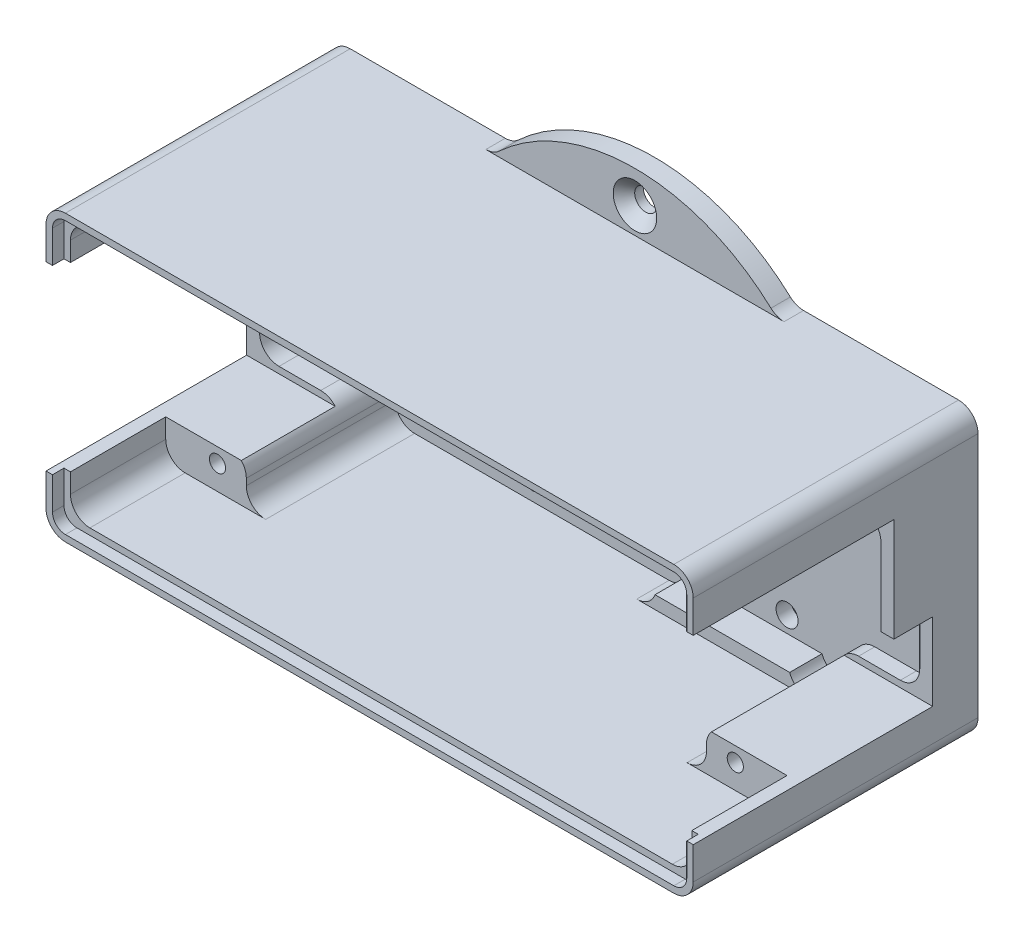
ISO-10303-21;
HEADER;
FILE_DESCRIPTION(('STEP AP214'),'2;1');
FILE_NAME('part.step','',(''),(''),'','','');
FILE_SCHEMA(('AUTOMOTIVE_DESIGN { 1 0 10303 214 1 1 1 1 }'));
ENDSEC;
DATA;
#1=APPLICATION_CONTEXT('core data for automotive mechanical design processes');
#2=APPLICATION_PROTOCOL_DEFINITION('international standard','automotive_design',2000,#1);
#3=PRODUCT_CONTEXT('',#1,'mechanical');
#4=PRODUCT('Part','Part','',(#3));
#5=PRODUCT_RELATED_PRODUCT_CATEGORY('part','',(#4));
#6=PRODUCT_DEFINITION_FORMATION('','',#4);
#7=PRODUCT_DEFINITION_CONTEXT('part definition',#1,'design');
#8=PRODUCT_DEFINITION('design','',#6,#7);
#9=PRODUCT_DEFINITION_SHAPE('','',#8);
#10=(LENGTH_UNIT() NAMED_UNIT(*) SI_UNIT(.MILLI.,.METRE.));
#11=(NAMED_UNIT(*) PLANE_ANGLE_UNIT() SI_UNIT($,.RADIAN.));
#12=(NAMED_UNIT(*) SI_UNIT($,.STERADIAN.) SOLID_ANGLE_UNIT());
#13=UNCERTAINTY_MEASURE_WITH_UNIT(LENGTH_MEASURE(1.E-05),#10,'distance_accuracy_value','');
#14=(GEOMETRIC_REPRESENTATION_CONTEXT(3) GLOBAL_UNCERTAINTY_ASSIGNED_CONTEXT((#13)) GLOBAL_UNIT_ASSIGNED_CONTEXT((#10,
#11,#12)) REPRESENTATION_CONTEXT('',''));
#15=CARTESIAN_POINT('',(0.,0.,0.));
#16=DIRECTION('',(0.,0.,1.));
#17=DIRECTION('',(1.,0.,0.));
#18=AXIS2_PLACEMENT_3D('',#15,#16,#17);
#19=CARTESIAN_POINT('',(-48.,-20.,-104.));
#20=DIRECTION('',(-1.,0.,0.));
#21=DIRECTION('',(0.,0.,1.));
#22=AXIS2_PLACEMENT_3D('',#19,#20,#21);
#23=PLANE('',#22);
#24=DIRECTION('',(0.,1.,0.));
#25=VECTOR('',#24,1.);
#26=CARTESIAN_POINT('',(-48.,-20.,42.222));
#27=LINE('',#26,#25);
#28=CARTESIAN_POINT('',(-48.,-17.,42.222));
#29=VERTEX_POINT('',#28);
#30=CARTESIAN_POINT('',(-48.,-14.,42.222));
#31=VERTEX_POINT('',#30);
#32=EDGE_CURVE('E833',#29,#31,#27,.T.);
#33=ORIENTED_EDGE('',*,*,#32,.F.);
#34=DIRECTION('',(0.,0.,1.));
#35=VECTOR('',#34,1.);
#36=CARTESIAN_POINT('',(-48.,-17.,27.5));
#37=LINE('',#36,#35);
#38=CARTESIAN_POINT('',(-48.,-17.,27.5));
#39=VERTEX_POINT('',#38);
#40=EDGE_CURVE('E1503',#29,#39,#37,.F.);
#41=ORIENTED_EDGE('',*,*,#40,.T.);
#42=DIRECTION('',(0.,-1.,0.));
#43=VECTOR('',#42,1.);
#44=CARTESIAN_POINT('',(-48.,-20.,27.5));
#45=LINE('',#44,#43);
#46=CARTESIAN_POINT('',(-48.,-14.,27.5));
#47=VERTEX_POINT('',#46);
#48=EDGE_CURVE('E1074',#47,#39,#45,.T.);
#49=ORIENTED_EDGE('',*,*,#48,.F.);
#50=DIRECTION('',(0.,0.,1.));
#51=VECTOR('',#50,1.);
#52=CARTESIAN_POINT('',(-48.,-14.,-104.));
#53=LINE('',#52,#51);
#54=EDGE_CURVE('E875',#47,#31,#53,.T.);
#55=ORIENTED_EDGE('',*,*,#54,.T.);
#56=EDGE_LOOP('',(#33,#41,#49,#55));
#57=FACE_BOUND('',#56,.T.);
#58=ADVANCED_FACE('F18',(#57),#23,.F.);
#59=CARTESIAN_POINT('',(48.,-20.,-104.));
#60=DIRECTION('',(1.,0.,0.));
#61=DIRECTION('',(0.,0.,-1.));
#62=AXIS2_PLACEMENT_3D('',#59,#60,#61);
#63=PLANE('',#62);
#64=DIRECTION('',(0.,-1.,0.));
#65=VECTOR('',#64,1.);
#66=CARTESIAN_POINT('',(48.,-20.,42.222));
#67=LINE('',#66,#65);
#68=CARTESIAN_POINT('',(48.,-14.,42.222));
#69=VERTEX_POINT('',#68);
#70=CARTESIAN_POINT('',(48.,-17.,42.222));
#71=VERTEX_POINT('',#70);
#72=EDGE_CURVE('E825',#69,#71,#67,.T.);
#73=ORIENTED_EDGE('',*,*,#72,.F.);
#74=DIRECTION('',(0.,0.,-1.));
#75=VECTOR('',#74,1.);
#76=CARTESIAN_POINT('',(48.,-14.,-104.));
#77=LINE('',#76,#75);
#78=CARTESIAN_POINT('',(48.,-14.,27.5));
#79=VERTEX_POINT('',#78);
#80=EDGE_CURVE('E883',#69,#79,#77,.T.);
#81=ORIENTED_EDGE('',*,*,#80,.T.);
#82=DIRECTION('',(0.,1.,0.));
#83=VECTOR('',#82,1.);
#84=CARTESIAN_POINT('',(48.,-20.,27.5));
#85=LINE('',#84,#83);
#86=CARTESIAN_POINT('',(48.,-17.,27.5));
#87=VERTEX_POINT('',#86);
#88=EDGE_CURVE('E1082',#87,#79,#85,.T.);
#89=ORIENTED_EDGE('',*,*,#88,.F.);
#90=DIRECTION('',(0.,0.,1.));
#91=VECTOR('',#90,1.);
#92=CARTESIAN_POINT('',(48.,-17.,44.));
#93=LINE('',#92,#91);
#94=EDGE_CURVE('E1483',#87,#71,#93,.T.);
#95=ORIENTED_EDGE('',*,*,#94,.T.);
#96=EDGE_LOOP('',(#73,#81,#89,#95));
#97=FACE_BOUND('',#96,.T.);
#98=ADVANCED_FACE('F1339',(#97),#63,.F.);
#99=CARTESIAN_POINT('',(-48.,20.,-104.));
#100=DIRECTION('',(0.,1.,0.));
#101=DIRECTION('',(0.,0.,1.));
#102=AXIS2_PLACEMENT_3D('',#99,#100,#101);
#103=PLANE('',#102);
#104=DIRECTION('',(1.,0.,0.));
#105=VECTOR('',#104,1.);
#106=CARTESIAN_POINT('',(-48.,20.,42.222));
#107=LINE('',#106,#105);
#108=CARTESIAN_POINT('',(-45.,20.,42.222));
#109=VERTEX_POINT('',#108);
#110=CARTESIAN_POINT('',(45.,20.,42.222));
#111=VERTEX_POINT('',#110);
#112=EDGE_CURVE('E815',#109,#111,#107,.T.);
#113=ORIENTED_EDGE('',*,*,#112,.F.);
#114=DIRECTION('',(0.,0.,1.));
#115=VECTOR('',#114,1.);
#116=CARTESIAN_POINT('',(-45.,20.,27.5));
#117=LINE('',#116,#115);
#118=CARTESIAN_POINT('',(-45.,20.,27.5));
#119=VERTEX_POINT('',#118);
#120=EDGE_CURVE('E1986',#109,#119,#117,.F.);
#121=ORIENTED_EDGE('',*,*,#120,.T.);
#122=DIRECTION('',(-1.,0.,0.));
#123=VECTOR('',#122,1.);
#124=CARTESIAN_POINT('',(-48.,20.,27.5));
#125=LINE('',#124,#123);
#126=CARTESIAN_POINT('',(-32.55,20.,27.5));
#127=VERTEX_POINT('',#126);
#128=EDGE_CURVE('E1118',#127,#119,#125,.T.);
#129=ORIENTED_EDGE('',*,*,#128,.F.);
#130=DIRECTION('',(0.,0.,-1.));
#131=VECTOR('',#130,1.);
#132=CARTESIAN_POINT('',(-32.55,20.,4.5));
#133=LINE('',#132,#131);
#134=CARTESIAN_POINT('',(-32.55,20.,9.5));
#135=VERTEX_POINT('',#134);
#136=EDGE_CURVE('E1987',#127,#135,#133,.T.);
#137=ORIENTED_EDGE('',*,*,#136,.T.);
#138=DIRECTION('',(-1.,0.,0.));
#139=VECTOR('',#138,1.);
#140=CARTESIAN_POINT('',(-30.4,20.,9.5));
#141=LINE('',#140,#139);
#142=CARTESIAN_POINT('',(-6.7715728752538,20.,9.5));
#143=VERTEX_POINT('',#142);
#144=EDGE_CURVE('E949',#143,#135,#141,.T.);
#145=ORIENTED_EDGE('',*,*,#144,.F.);
#146=DIRECTION('',(0.,0.,-1.));
#147=VECTOR('',#146,1.);
#148=CARTESIAN_POINT('',(-6.7715728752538,20.,-104.));
#149=LINE('',#148,#147);
#150=CARTESIAN_POINT('',(-6.7715728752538,20.,4.5));
#151=VERTEX_POINT('',#150);
#152=EDGE_CURVE('E2001',#143,#151,#149,.T.);
#153=ORIENTED_EDGE('',*,*,#152,.T.);
#154=DIRECTION('',(-1.,0.,0.));
#155=VECTOR('',#154,1.);
#156=CARTESIAN_POINT('',(-48.,20.,4.5));
#157=LINE('',#156,#155);
#158=CARTESIAN_POINT('',(13.39,20.,4.5));
#159=VERTEX_POINT('',#158);
#160=EDGE_CURVE('E1121',#159,#151,#157,.T.);
#161=ORIENTED_EDGE('',*,*,#160,.F.);
#162=DIRECTION('',(0.,0.,-1.));
#163=VECTOR('',#162,1.);
#164=CARTESIAN_POINT('',(13.39,20.,19.5));
#165=LINE('',#164,#163);
#166=CARTESIAN_POINT('',(13.39,20.,19.5));
#167=VERTEX_POINT('',#166);
#168=EDGE_CURVE('E1428',#159,#167,#165,.F.);
#169=ORIENTED_EDGE('',*,*,#168,.T.);
#170=DIRECTION('',(-1.,0.,0.));
#171=VECTOR('',#170,1.);
#172=CARTESIAN_POINT('',(15.39,20.,19.5));
#173=LINE('',#172,#171);
#174=CARTESIAN_POINT('',(23.39,20.,19.5));
#175=VERTEX_POINT('',#174);
#176=EDGE_CURVE('E918',#175,#167,#173,.T.);
#177=ORIENTED_EDGE('',*,*,#176,.F.);
#178=DIRECTION('',(0.,0.,-1.));
#179=VECTOR('',#178,1.);
#180=CARTESIAN_POINT('',(23.39,20.,4.5));
#181=LINE('',#180,#179);
#182=CARTESIAN_POINT('',(23.39,20.,4.5));
#183=VERTEX_POINT('',#182);
#184=EDGE_CURVE('E1612',#175,#183,#181,.T.);
#185=ORIENTED_EDGE('',*,*,#184,.T.);
#186=CARTESIAN_POINT('',(32.55,20.,4.5));
#187=VERTEX_POINT('',#186);
#188=EDGE_CURVE('E1126',#187,#183,#157,.T.);
#189=ORIENTED_EDGE('',*,*,#188,.F.);
#190=DIRECTION('',(0.,0.,-1.));
#191=VECTOR('',#190,1.);
#192=CARTESIAN_POINT('',(32.55,20.,27.5));
#193=LINE('',#192,#191);
#194=CARTESIAN_POINT('',(32.55,20.,27.5));
#195=VERTEX_POINT('',#194);
#196=EDGE_CURVE('E1992',#187,#195,#193,.F.);
#197=ORIENTED_EDGE('',*,*,#196,.T.);
#198=DIRECTION('',(-1.,0.,0.));
#199=VECTOR('',#198,1.);
#200=CARTESIAN_POINT('',(48.,20.,27.5));
#201=LINE('',#200,#199);
#202=CARTESIAN_POINT('',(45.,20.,27.5));
#203=VERTEX_POINT('',#202);
#204=EDGE_CURVE('E1097',#203,#195,#201,.T.);
#205=ORIENTED_EDGE('',*,*,#204,.F.);
#206=DIRECTION('',(0.,0.,1.));
#207=VECTOR('',#206,1.);
#208=CARTESIAN_POINT('',(45.,20.,44.));
#209=LINE('',#208,#207);
#210=EDGE_CURVE('E1999',#203,#111,#209,.T.);
#211=ORIENTED_EDGE('',*,*,#210,.T.);
#212=EDGE_LOOP('',(#113,#121,#129,#137,#145,#153,#161,#169,#177,#185,#189,#197,#205,#211));
#213=FACE_BOUND('',#212,.T.);
#214=ADVANCED_FACE('F1342',(#213),#103,.F.);
#215=CARTESIAN_POINT('',(-48.,-20.,-104.));
#216=DIRECTION('',(0.,-1.,0.));
#217=DIRECTION('',(0.,0.,-1.));
#218=AXIS2_PLACEMENT_3D('',#215,#216,#217);
#219=PLANE('',#218);
#220=DIRECTION('',(-1.,0.,0.));
#221=VECTOR('',#220,1.);
#222=CARTESIAN_POINT('',(-48.,-20.,42.222));
#223=LINE('',#222,#221);
#224=CARTESIAN_POINT('',(45.,-20.,42.222));
#225=VERTEX_POINT('',#224);
#226=CARTESIAN_POINT('',(-45.,-20.,42.222));
#227=VERTEX_POINT('',#226);
#228=EDGE_CURVE('E829',#225,#227,#223,.T.);
#229=ORIENTED_EDGE('',*,*,#228,.F.);
#230=DIRECTION('',(0.,0.,1.));
#231=VECTOR('',#230,1.);
#232=CARTESIAN_POINT('',(45.,-20.,27.5));
#233=LINE('',#232,#231);
#234=CARTESIAN_POINT('',(45.,-20.,27.5));
#235=VERTEX_POINT('',#234);
#236=EDGE_CURVE('E1646',#225,#235,#233,.F.);
#237=ORIENTED_EDGE('',*,*,#236,.T.);
#238=DIRECTION('',(1.,0.,0.));
#239=VECTOR('',#238,1.);
#240=CARTESIAN_POINT('',(48.,-20.,27.5));
#241=LINE('',#240,#239);
#242=CARTESIAN_POINT('',(32.55,-20.,27.5));
#243=VERTEX_POINT('',#242);
#244=EDGE_CURVE('E1089',#243,#235,#241,.T.);
#245=ORIENTED_EDGE('',*,*,#244,.F.);
#246=DIRECTION('',(0.,0.,-1.));
#247=VECTOR('',#246,1.);
#248=CARTESIAN_POINT('',(32.55,-20.,4.5));
#249=LINE('',#248,#247);
#250=CARTESIAN_POINT('',(32.55,-20.,9.5));
#251=VERTEX_POINT('',#250);
#252=EDGE_CURVE('E1637',#243,#251,#249,.T.);
#253=ORIENTED_EDGE('',*,*,#252,.T.);
#254=DIRECTION('',(1.,0.,0.));
#255=VECTOR('',#254,1.);
#256=CARTESIAN_POINT('',(9.6,-20.,9.5));
#257=LINE('',#256,#255);
#258=CARTESIAN_POINT('',(6.77157287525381,-20.,9.5));
#259=VERTEX_POINT('',#258);
#260=EDGE_CURVE('E934',#259,#251,#257,.T.);
#261=ORIENTED_EDGE('',*,*,#260,.F.);
#262=DIRECTION('',(0.,0.,-1.));
#263=VECTOR('',#262,1.);
#264=CARTESIAN_POINT('',(6.77157287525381,-20.,-104.));
#265=LINE('',#264,#263);
#266=CARTESIAN_POINT('',(6.77157287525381,-20.,4.5));
#267=VERTEX_POINT('',#266);
#268=EDGE_CURVE('E1485',#259,#267,#265,.T.);
#269=ORIENTED_EDGE('',*,*,#268,.T.);
#270=DIRECTION('',(1.,0.,0.));
#271=VECTOR('',#270,1.);
#272=CARTESIAN_POINT('',(-48.,-20.,4.5));
#273=LINE('',#272,#271);
#274=CARTESIAN_POINT('',(-32.55,-20.,4.5));
#275=VERTEX_POINT('',#274);
#276=EDGE_CURVE('E1134',#275,#267,#273,.T.);
#277=ORIENTED_EDGE('',*,*,#276,.F.);
#278=DIRECTION('',(0.,0.,-1.));
#279=VECTOR('',#278,1.);
#280=CARTESIAN_POINT('',(-32.55,-20.,27.5));
#281=LINE('',#280,#279);
#282=CARTESIAN_POINT('',(-32.55,-20.,27.5));
#283=VERTEX_POINT('',#282);
#284=EDGE_CURVE('E1640',#275,#283,#281,.F.);
#285=ORIENTED_EDGE('',*,*,#284,.T.);
#286=DIRECTION('',(1.,0.,0.));
#287=VECTOR('',#286,1.);
#288=CARTESIAN_POINT('',(-48.,-20.,27.5));
#289=LINE('',#288,#287);
#290=CARTESIAN_POINT('',(-45.,-20.,27.5));
#291=VERTEX_POINT('',#290);
#292=EDGE_CURVE('E1068',#291,#283,#289,.T.);
#293=ORIENTED_EDGE('',*,*,#292,.F.);
#294=DIRECTION('',(0.,0.,1.));
#295=VECTOR('',#294,1.);
#296=CARTESIAN_POINT('',(-45.,-20.,44.));
#297=LINE('',#296,#295);
#298=EDGE_CURVE('E1643',#291,#227,#297,.T.);
#299=ORIENTED_EDGE('',*,*,#298,.T.);
#300=EDGE_LOOP('',(#229,#237,#245,#253,#261,#269,#277,#285,#293,#299));
#301=FACE_BOUND('',#300,.T.);
#302=ADVANCED_FACE('F1346',(#301),#219,.F.);
#303=DIRECTION('',(0.,1.,0.));
#304=VECTOR('',#303,1.);
#305=CARTESIAN_POINT('',(-48.,-20.,42.222));
#306=LINE('',#305,#304);
#307=CARTESIAN_POINT('',(-48.,14.,42.222));
#308=VERTEX_POINT('',#307);
#309=CARTESIAN_POINT('',(-48.,17.,42.222));
#310=VERTEX_POINT('',#309);
#311=EDGE_CURVE('E819',#308,#310,#306,.T.);
#312=ORIENTED_EDGE('',*,*,#311,.F.);
#313=DIRECTION('',(0.,0.,-1.));
#314=VECTOR('',#313,1.);
#315=CARTESIAN_POINT('',(-48.,14.,-104.));
#316=LINE('',#315,#314);
#317=CARTESIAN_POINT('',(-48.,14.,27.5));
#318=VERTEX_POINT('',#317);
#319=EDGE_CURVE('E864',#308,#318,#316,.T.);
#320=ORIENTED_EDGE('',*,*,#319,.T.);
#321=DIRECTION('',(0.,-1.,0.));
#322=VECTOR('',#321,1.);
#323=CARTESIAN_POINT('',(-48.,20.,27.5));
#324=LINE('',#323,#322);
#325=CARTESIAN_POINT('',(-48.,17.,27.5));
#326=VERTEX_POINT('',#325);
#327=EDGE_CURVE('E1111',#326,#318,#324,.T.);
#328=ORIENTED_EDGE('',*,*,#327,.F.);
#329=DIRECTION('',(0.,0.,1.));
#330=VECTOR('',#329,1.);
#331=CARTESIAN_POINT('',(-48.,17.,44.));
#332=LINE('',#331,#330);
#333=EDGE_CURVE('E1495',#326,#310,#332,.T.);
#334=ORIENTED_EDGE('',*,*,#333,.T.);
#335=EDGE_LOOP('',(#312,#320,#328,#334));
#336=FACE_BOUND('',#335,.T.);
#337=ADVANCED_FACE('F1349',(#336),#23,.F.);
#338=DIRECTION('',(0.,-1.,0.));
#339=VECTOR('',#338,1.);
#340=CARTESIAN_POINT('',(48.,-20.,42.222));
#341=LINE('',#340,#339);
#342=CARTESIAN_POINT('',(48.,17.,42.222));
#343=VERTEX_POINT('',#342);
#344=CARTESIAN_POINT('',(48.,14.,42.222));
#345=VERTEX_POINT('',#344);
#346=EDGE_CURVE('E796',#343,#345,#341,.T.);
#347=ORIENTED_EDGE('',*,*,#346,.F.);
#348=DIRECTION('',(0.,0.,1.));
#349=VECTOR('',#348,1.);
#350=CARTESIAN_POINT('',(48.,17.,27.5));
#351=LINE('',#350,#349);
#352=CARTESIAN_POINT('',(48.,17.,27.5));
#353=VERTEX_POINT('',#352);
#354=EDGE_CURVE('E1472',#343,#353,#351,.F.);
#355=ORIENTED_EDGE('',*,*,#354,.T.);
#356=DIRECTION('',(0.,1.,0.));
#357=VECTOR('',#356,1.);
#358=CARTESIAN_POINT('',(48.,20.,27.5));
#359=LINE('',#358,#357);
#360=CARTESIAN_POINT('',(48.,14.,27.5));
#361=VERTEX_POINT('',#360);
#362=EDGE_CURVE('E1103',#361,#353,#359,.T.);
#363=ORIENTED_EDGE('',*,*,#362,.F.);
#364=DIRECTION('',(0.,0.,1.));
#365=VECTOR('',#364,1.);
#366=CARTESIAN_POINT('',(48.,14.,-104.));
#367=LINE('',#366,#365);
#368=EDGE_CURVE('E870',#361,#345,#367,.T.);
#369=ORIENTED_EDGE('',*,*,#368,.T.);
#370=EDGE_LOOP('',(#347,#355,#363,#369));
#371=FACE_BOUND('',#370,.T.);
#372=ADVANCED_FACE('F1344',(#371),#63,.F.);
#373=CARTESIAN_POINT('',(45.,-17.,-104.));
#374=DIRECTION('',(0.,0.,-1.));
#375=DIRECTION('',(-1.,0.,0.));
#376=AXIS2_PLACEMENT_3D('',#373,#374,#375);
#377=CYLINDRICAL_SURFACE('',#376,3.);
#378=CARTESIAN_POINT('',(45.,-17.,42.222));
#379=DIRECTION('',(0.,0.,1.));
#380=DIRECTION('',(1.,0.,0.));
#381=AXIS2_PLACEMENT_3D('',#378,#379,#380);
#382=CIRCLE('',#381,3.);
#383=EDGE_CURVE('E827',#71,#225,#382,.F.);
#384=ORIENTED_EDGE('',*,*,#383,.F.);
#385=ORIENTED_EDGE('',*,*,#94,.F.);
#386=CARTESIAN_POINT('',(45.,-17.,27.5));
#387=DIRECTION('',(0.,0.,1.));
#388=DIRECTION('',(1.,0.,0.));
#389=AXIS2_PLACEMENT_3D('',#386,#387,#388);
#390=CIRCLE('',#389,3.);
#391=EDGE_CURVE('E1493',#235,#87,#390,.T.);
#392=ORIENTED_EDGE('',*,*,#391,.F.);
#393=ORIENTED_EDGE('',*,*,#236,.F.);
#394=EDGE_LOOP('',(#384,#385,#392,#393));
#395=FACE_BOUND('',#394,.T.);
#396=ADVANCED_FACE('F1721',(#395),#377,.F.);
#397=CARTESIAN_POINT('',(-45.,-17.,-104.));
#398=DIRECTION('',(0.,0.,-1.));
#399=DIRECTION('',(-1.,0.,0.));
#400=AXIS2_PLACEMENT_3D('',#397,#398,#399);
#401=CYLINDRICAL_SURFACE('',#400,3.);
#402=CARTESIAN_POINT('',(-45.,-17.,42.222));
#403=DIRECTION('',(0.,0.,1.));
#404=DIRECTION('',(1.,0.,0.));
#405=AXIS2_PLACEMENT_3D('',#402,#403,#404);
#406=CIRCLE('',#405,3.);
#407=EDGE_CURVE('E831',#227,#29,#406,.F.);
#408=ORIENTED_EDGE('',*,*,#407,.F.);
#409=ORIENTED_EDGE('',*,*,#298,.F.);
#410=CARTESIAN_POINT('',(-45.,-17.,27.5));
#411=DIRECTION('',(0.,0.,1.));
#412=DIRECTION('',(1.,0.,0.));
#413=AXIS2_PLACEMENT_3D('',#410,#411,#412);
#414=CIRCLE('',#413,3.);
#415=EDGE_CURVE('E1508',#39,#291,#414,.T.);
#416=ORIENTED_EDGE('',*,*,#415,.F.);
#417=ORIENTED_EDGE('',*,*,#40,.F.);
#418=EDGE_LOOP('',(#408,#409,#416,#417));
#419=FACE_BOUND('',#418,.T.);
#420=ADVANCED_FACE('F2070',(#419),#401,.F.);
#421=CARTESIAN_POINT('',(45.,17.,-104.));
#422=DIRECTION('',(0.,0.,-1.));
#423=DIRECTION('',(-1.,0.,0.));
#424=AXIS2_PLACEMENT_3D('',#421,#422,#423);
#425=CYLINDRICAL_SURFACE('',#424,3.);
#426=CARTESIAN_POINT('',(45.,17.,42.222));
#427=DIRECTION('',(0.,0.,1.));
#428=DIRECTION('',(1.,0.,0.));
#429=AXIS2_PLACEMENT_3D('',#426,#427,#428);
#430=CIRCLE('',#429,3.);
#431=EDGE_CURVE('E813',#111,#343,#430,.F.);
#432=ORIENTED_EDGE('',*,*,#431,.F.);
#433=ORIENTED_EDGE('',*,*,#210,.F.);
#434=CARTESIAN_POINT('',(45.,17.,27.5));
#435=DIRECTION('',(0.,0.,1.));
#436=DIRECTION('',(1.,0.,0.));
#437=AXIS2_PLACEMENT_3D('',#434,#435,#436);
#438=CIRCLE('',#437,3.);
#439=EDGE_CURVE('E1478',#353,#203,#438,.T.);
#440=ORIENTED_EDGE('',*,*,#439,.F.);
#441=ORIENTED_EDGE('',*,*,#354,.F.);
#442=EDGE_LOOP('',(#432,#433,#440,#441));
#443=FACE_BOUND('',#442,.T.);
#444=ADVANCED_FACE('F1475',(#443),#425,.F.);
#445=CARTESIAN_POINT('',(-45.,17.,-104.));
#446=DIRECTION('',(0.,0.,-1.));
#447=DIRECTION('',(-1.,0.,0.));
#448=AXIS2_PLACEMENT_3D('',#445,#446,#447);
#449=CYLINDRICAL_SURFACE('',#448,3.);
#450=CARTESIAN_POINT('',(-45.,17.,42.222));
#451=DIRECTION('',(0.,0.,1.));
#452=DIRECTION('',(1.,0.,0.));
#453=AXIS2_PLACEMENT_3D('',#450,#451,#452);
#454=CIRCLE('',#453,3.);
#455=EDGE_CURVE('E817',#310,#109,#454,.F.);
#456=ORIENTED_EDGE('',*,*,#455,.F.);
#457=ORIENTED_EDGE('',*,*,#333,.F.);
#458=CARTESIAN_POINT('',(-45.,17.,27.5));
#459=DIRECTION('',(0.,0.,1.));
#460=DIRECTION('',(1.,0.,0.));
#461=AXIS2_PLACEMENT_3D('',#458,#459,#460);
#462=CIRCLE('',#461,3.);
#463=EDGE_CURVE('E1554',#119,#326,#462,.T.);
#464=ORIENTED_EDGE('',*,*,#463,.F.);
#465=ORIENTED_EDGE('',*,*,#120,.F.);
#466=EDGE_LOOP('',(#456,#457,#464,#465));
#467=FACE_BOUND('',#466,.T.);
#468=ADVANCED_FACE('F2062',(#467),#449,.F.);
#469=DIRECTION('',(0.,0.,-1.));
#470=VECTOR('',#469,1.);
#471=CARTESIAN_POINT('',(-48.,2.,13.));
#472=LINE('',#471,#470);
#473=CARTESIAN_POINT('',(-48.,2.,13.));
#474=VERTEX_POINT('',#473);
#475=CARTESIAN_POINT('',(-48.,2.,7.));
#476=VERTEX_POINT('',#475);
#477=EDGE_CURVE('E679',#474,#476,#472,.T.);
#478=ORIENTED_EDGE('',*,*,#477,.F.);
#479=DIRECTION('',(0.,1.,0.));
#480=VECTOR('',#479,1.);
#481=CARTESIAN_POINT('',(-48.,2.,13.));
#482=LINE('',#481,#480);
#483=CARTESIAN_POINT('',(-48.,-9.99999999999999,13.));
#484=VERTEX_POINT('',#483);
#485=EDGE_CURVE('E690',#484,#474,#482,.T.);
#486=ORIENTED_EDGE('',*,*,#485,.F.);
#487=DIRECTION('',(0.,0.,-1.));
#488=VECTOR('',#487,1.);
#489=CARTESIAN_POINT('',(-48.,-9.99999999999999,4.5));
#490=LINE('',#489,#488);
#491=CARTESIAN_POINT('',(-48.,-9.99999999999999,4.5));
#492=VERTEX_POINT('',#491);
#493=EDGE_CURVE('E1501',#484,#492,#490,.T.);
#494=ORIENTED_EDGE('',*,*,#493,.T.);
#495=DIRECTION('',(0.,-1.,0.));
#496=VECTOR('',#495,1.);
#497=CARTESIAN_POINT('',(-48.,-20.,4.5));
#498=LINE('',#497,#496);
#499=CARTESIAN_POINT('',(-48.,10.,4.5));
#500=VERTEX_POINT('',#499);
#501=EDGE_CURVE('E1129',#500,#492,#498,.T.);
#502=ORIENTED_EDGE('',*,*,#501,.F.);
#503=DIRECTION('',(0.,0.,-1.));
#504=VECTOR('',#503,1.);
#505=CARTESIAN_POINT('',(-48.,10.,27.5));
#506=LINE('',#505,#504);
#507=CARTESIAN_POINT('',(-48.,10.,7.));
#508=VERTEX_POINT('',#507);
#509=EDGE_CURVE('E1498',#500,#508,#506,.F.);
#510=ORIENTED_EDGE('',*,*,#509,.T.);
#511=DIRECTION('',(0.,1.,0.));
#512=VECTOR('',#511,1.);
#513=CARTESIAN_POINT('',(-48.,14.,7.));
#514=LINE('',#513,#512);
#515=EDGE_CURVE('E677',#476,#508,#514,.T.);
#516=ORIENTED_EDGE('',*,*,#515,.F.);
#517=EDGE_LOOP('',(#478,#486,#494,#502,#510,#516));
#518=FACE_BOUND('',#517,.T.);
#519=ADVANCED_FACE('F1354',(#518),#23,.F.);
#520=DIRECTION('',(0.,0.,-1.));
#521=VECTOR('',#520,1.);
#522=CARTESIAN_POINT('',(48.,-2.,13.));
#523=LINE('',#522,#521);
#524=CARTESIAN_POINT('',(48.,-2.,13.));
#525=VERTEX_POINT('',#524);
#526=CARTESIAN_POINT('',(48.,-2.,7.));
#527=VERTEX_POINT('',#526);
#528=EDGE_CURVE('E716',#525,#527,#523,.T.);
#529=ORIENTED_EDGE('',*,*,#528,.F.);
#530=DIRECTION('',(0.,-1.,0.));
#531=VECTOR('',#530,1.);
#532=CARTESIAN_POINT('',(48.,14.,13.));
#533=LINE('',#532,#531);
#534=CARTESIAN_POINT('',(48.,9.99999999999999,13.));
#535=VERTEX_POINT('',#534);
#536=EDGE_CURVE('E719',#535,#525,#533,.T.);
#537=ORIENTED_EDGE('',*,*,#536,.F.);
#538=DIRECTION('',(0.,0.,-1.));
#539=VECTOR('',#538,1.);
#540=CARTESIAN_POINT('',(48.,9.99999999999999,4.5));
#541=LINE('',#540,#539);
#542=CARTESIAN_POINT('',(48.,9.99999999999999,4.5));
#543=VERTEX_POINT('',#542);
#544=EDGE_CURVE('E1480',#535,#543,#541,.T.);
#545=ORIENTED_EDGE('',*,*,#544,.T.);
#546=DIRECTION('',(0.,1.,0.));
#547=VECTOR('',#546,1.);
#548=CARTESIAN_POINT('',(48.,-20.,4.5));
#549=LINE('',#548,#547);
#550=CARTESIAN_POINT('',(48.,-9.99999999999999,4.5));
#551=VERTEX_POINT('',#550);
#552=EDGE_CURVE('E1130',#551,#543,#549,.T.);
#553=ORIENTED_EDGE('',*,*,#552,.F.);
#554=DIRECTION('',(0.,0.,-1.));
#555=VECTOR('',#554,1.);
#556=CARTESIAN_POINT('',(48.,-9.99999999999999,27.5));
#557=LINE('',#556,#555);
#558=CARTESIAN_POINT('',(48.,-9.99999999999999,7.));
#559=VERTEX_POINT('',#558);
#560=EDGE_CURVE('E1479',#551,#559,#557,.F.);
#561=ORIENTED_EDGE('',*,*,#560,.T.);
#562=DIRECTION('',(0.,-1.,0.));
#563=VECTOR('',#562,1.);
#564=CARTESIAN_POINT('',(48.,-14.,7.));
#565=LINE('',#564,#563);
#566=EDGE_CURVE('E714',#527,#559,#565,.T.);
#567=ORIENTED_EDGE('',*,*,#566,.F.);
#568=EDGE_LOOP('',(#529,#537,#545,#553,#561,#567));
#569=FACE_BOUND('',#568,.T.);
#570=ADVANCED_FACE('F1345',(#569),#63,.F.);
#571=CARTESIAN_POINT('',(47.,19.,44.));
#572=DIRECTION('',(0.,0.,-1.));
#573=DIRECTION('',(-1.,0.,0.));
#574=AXIS2_PLACEMENT_3D('',#571,#572,#573);
#575=PLANE('',#574);
#576=CARTESIAN_POINT('',(-47.,-19.,44.));
#577=DIRECTION('',(0.,0.,1.));
#578=DIRECTION('',(1.,0.,0.));
#579=AXIS2_PLACEMENT_3D('',#576,#577,#578);
#580=CIRCLE('',#579,2.);
#581=CARTESIAN_POINT('',(-49.,-19.,44.));
#582=VERTEX_POINT('',#581);
#583=CARTESIAN_POINT('',(-47.,-21.,44.));
#584=VERTEX_POINT('',#583);
#585=EDGE_CURVE('E789',#582,#584,#580,.T.);
#586=ORIENTED_EDGE('',*,*,#585,.F.);
#587=DIRECTION('',(0.,-1.,0.));
#588=VECTOR('',#587,1.);
#589=CARTESIAN_POINT('',(-49.,19.,44.));
#590=LINE('',#589,#588);
#591=CARTESIAN_POINT('',(-49.,-14.,44.));
#592=VERTEX_POINT('',#591);
#593=EDGE_CURVE('E786',#592,#582,#590,.T.);
#594=ORIENTED_EDGE('',*,*,#593,.F.);
#595=DIRECTION('',(-1.,0.,0.));
#596=VECTOR('',#595,1.);
#597=CARTESIAN_POINT('',(50.,-14.,44.));
#598=LINE('',#597,#596);
#599=CARTESIAN_POINT('',(-50.,-14.,44.));
#600=VERTEX_POINT('',#599);
#601=EDGE_CURVE('E858',#592,#600,#598,.T.);
#602=ORIENTED_EDGE('',*,*,#601,.T.);
#603=DIRECTION('',(0.,-1.,0.));
#604=VECTOR('',#603,1.);
#605=CARTESIAN_POINT('',(-50.,-19.,44.));
#606=LINE('',#605,#604);
#607=CARTESIAN_POINT('',(-50.,-19.,44.));
#608=VERTEX_POINT('',#607);
#609=EDGE_CURVE('E1162',#600,#608,#606,.T.);
#610=ORIENTED_EDGE('',*,*,#609,.T.);
#611=CARTESIAN_POINT('',(-47.,-19.,44.));
#612=DIRECTION('',(0.,0.,1.));
#613=DIRECTION('',(-1.,0.,0.));
#614=AXIS2_PLACEMENT_3D('',#611,#612,#613);
#615=CIRCLE('',#614,3.);
#616=CARTESIAN_POINT('',(-47.,-22.,44.));
#617=VERTEX_POINT('',#616);
#618=EDGE_CURVE('E1166',#608,#617,#615,.T.);
#619=ORIENTED_EDGE('',*,*,#618,.T.);
#620=DIRECTION('',(1.,0.,0.));
#621=VECTOR('',#620,1.);
#622=CARTESIAN_POINT('',(-47.,-22.,44.));
#623=LINE('',#622,#621);
#624=CARTESIAN_POINT('',(47.,-22.,44.));
#625=VERTEX_POINT('',#624);
#626=EDGE_CURVE('E1168',#617,#625,#623,.T.);
#627=ORIENTED_EDGE('',*,*,#626,.T.);
#628=CARTESIAN_POINT('',(47.,-19.,44.));
#629=DIRECTION('',(0.,0.,1.));
#630=DIRECTION('',(1.,0.,0.));
#631=AXIS2_PLACEMENT_3D('',#628,#629,#630);
#632=CIRCLE('',#631,3.);
#633=CARTESIAN_POINT('',(50.,-19.,44.));
#634=VERTEX_POINT('',#633);
#635=EDGE_CURVE('E1170',#625,#634,#632,.T.);
#636=ORIENTED_EDGE('',*,*,#635,.T.);
#637=DIRECTION('',(0.,1.,0.));
#638=VECTOR('',#637,1.);
#639=CARTESIAN_POINT('',(50.,-19.,44.));
#640=LINE('',#639,#638);
#641=CARTESIAN_POINT('',(50.,-14.,44.));
#642=VERTEX_POINT('',#641);
#643=EDGE_CURVE('E1173',#634,#642,#640,.T.);
#644=ORIENTED_EDGE('',*,*,#643,.T.);
#645=CARTESIAN_POINT('',(49.,-14.,44.));
#646=VERTEX_POINT('',#645);
#647=EDGE_CURVE('E854',#642,#646,#598,.T.);
#648=ORIENTED_EDGE('',*,*,#647,.T.);
#649=DIRECTION('',(0.,1.,0.));
#650=VECTOR('',#649,1.);
#651=CARTESIAN_POINT('',(49.,19.,44.));
#652=LINE('',#651,#650);
#653=CARTESIAN_POINT('',(49.,-19.,44.));
#654=VERTEX_POINT('',#653);
#655=EDGE_CURVE('E775',#654,#646,#652,.T.);
#656=ORIENTED_EDGE('',*,*,#655,.F.);
#657=CARTESIAN_POINT('',(47.,-19.,44.));
#658=DIRECTION('',(0.,0.,1.));
#659=DIRECTION('',(1.,0.,0.));
#660=AXIS2_PLACEMENT_3D('',#657,#658,#659);
#661=CIRCLE('',#660,2.);
#662=CARTESIAN_POINT('',(47.,-21.,44.));
#663=VERTEX_POINT('',#662);
#664=EDGE_CURVE('E711',#663,#654,#661,.T.);
#665=ORIENTED_EDGE('',*,*,#664,.F.);
#666=DIRECTION('',(1.,0.,0.));
#667=VECTOR('',#666,1.);
#668=CARTESIAN_POINT('',(-47.,-21.,44.));
#669=LINE('',#668,#667);
#670=EDGE_CURVE('E749',#584,#663,#669,.T.);
#671=ORIENTED_EDGE('',*,*,#670,.F.);
#672=EDGE_LOOP('',(#586,#594,#602,#610,#619,#627,#636,#644,#648,#656,#665,#671));
#673=FACE_BOUND('',#672,.T.);
#674=ADVANCED_FACE('F1360',(#673),#575,.F.);
#675=CARTESIAN_POINT('',(47.,19.,4.5));
#676=DIRECTION('',(0.,0.,-1.));
#677=DIRECTION('',(-1.,0.,0.));
#678=AXIS2_PLACEMENT_3D('',#675,#676,#677);
#679=PLANE('',#678);
#680=DIRECTION('',(-0.642787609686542,-0.766044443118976,0.));
#681=VECTOR('',#680,1.);
#682=CARTESIAN_POINT('',(29.9278000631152,33.3252766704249,4.5));
#683=LINE('',#682,#681);
#684=CARTESIAN_POINT('',(-10.5780152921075,-14.9476743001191,4.5));
#685=VERTEX_POINT('',#684);
#686=CARTESIAN_POINT('',(-13.1491657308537,-18.011852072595,4.5));
#687=VERTEX_POINT('',#686);
#688=EDGE_CURVE('E654',#685,#687,#683,.T.);
#689=ORIENTED_EDGE('',*,*,#688,.T.);
#690=CARTESIAN_POINT('',(-14.3020243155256,-17.0444888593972,4.5));
#691=DIRECTION('',(0.,0.,-1.));
#692=DIRECTION('',(-1.,0.,0.));
#693=AXIS2_PLACEMENT_3D('',#690,#691,#692);
#694=CIRCLE('',#693,1.50495);
#695=CARTESIAN_POINT('',(-15.4548829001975,-16.0771256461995,4.5));
#696=VERTEX_POINT('',#695);
#697=EDGE_CURVE('E657',#687,#696,#694,.T.);
#698=ORIENTED_EDGE('',*,*,#697,.T.);
#699=DIRECTION('',(0.642787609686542,0.766044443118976,0.));
#700=VECTOR('',#699,1.);
#701=CARTESIAN_POINT('',(27.6220828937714,35.2600030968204,4.5));
#702=LINE('',#701,#700);
#703=CARTESIAN_POINT('',(-12.8837324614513,-13.0129478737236,4.5));
#704=VERTEX_POINT('',#703);
#705=EDGE_CURVE('E649',#696,#704,#702,.T.);
#706=ORIENTED_EDGE('',*,*,#705,.T.);
#707=CARTESIAN_POINT('',(-11.7308738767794,-13.9803110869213,4.5));
#708=DIRECTION('',(0.,0.,-1.));
#709=DIRECTION('',(-1.,0.,0.));
#710=AXIS2_PLACEMENT_3D('',#707,#708,#709);
#711=CIRCLE('',#710,1.50495);
#712=EDGE_CURVE('E629',#704,#685,#711,.T.);
#713=ORIENTED_EDGE('',*,*,#712,.T.);
#714=EDGE_LOOP('',(#689,#698,#706,#713));
#715=FACE_BOUND('',#714,.T.);
#716=CARTESIAN_POINT('',(13.0164490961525,15.5123999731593,4.5));
#717=DIRECTION('',(0.,0.,-1.));
#718=DIRECTION('',(-1.,0.,0.));
#719=AXIS2_PLACEMENT_3D('',#716,#717,#718);
#720=CIRCLE('',#719,1.50495);
#721=CARTESIAN_POINT('',(11.5114990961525,15.5123999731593,4.5));
#722=VERTEX_POINT('',#721);
#723=EDGE_CURVE('E663',#722,#722,#720,.T.);
#724=ORIENTED_EDGE('',*,*,#723,.T.);
#725=EDGE_LOOP('',(#724));
#726=FACE_BOUND('',#725,.T.);
#727=CARTESIAN_POINT('',(17.5370144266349,-10.125,4.5));
#728=DIRECTION('',(0.,0.,1.));
#729=DIRECTION('',(1.,0.,0.));
#730=AXIS2_PLACEMENT_3D('',#727,#728,#729);
#731=CIRCLE('',#730,3.4);
#732=CARTESIAN_POINT('',(20.9370144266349,-10.125,4.5));
#733=VERTEX_POINT('',#732);
#734=EDGE_CURVE('E1024',#733,#733,#731,.T.);
#735=ORIENTED_EDGE('',*,*,#734,.F.);
#736=EDGE_LOOP('',(#735));
#737=FACE_BOUND('',#736,.T.);
#738=CARTESIAN_POINT('',(17.5370144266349,10.125,4.5));
#739=DIRECTION('',(0.,0.,1.));
#740=DIRECTION('',(1.,0.,0.));
#741=AXIS2_PLACEMENT_3D('',#738,#739,#740);
#742=CIRCLE('',#741,3.4);
#743=CARTESIAN_POINT('',(20.9370144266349,10.125,4.5));
#744=VERTEX_POINT('',#743);
#745=EDGE_CURVE('E1033',#744,#744,#742,.T.);
#746=ORIENTED_EDGE('',*,*,#745,.F.);
#747=EDGE_LOOP('',(#746));
#748=FACE_BOUND('',#747,.T.);
#749=CARTESIAN_POINT('',(-17.5370144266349,10.125,4.5));
#750=DIRECTION('',(0.,0.,1.));
#751=DIRECTION('',(1.,0.,0.));
#752=AXIS2_PLACEMENT_3D('',#749,#750,#751);
#753=CIRCLE('',#752,3.4);
#754=CARTESIAN_POINT('',(-14.1370144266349,10.125,4.5));
#755=VERTEX_POINT('',#754);
#756=EDGE_CURVE('E1042',#755,#755,#753,.T.);
#757=ORIENTED_EDGE('',*,*,#756,.F.);
#758=EDGE_LOOP('',(#757));
#759=FACE_BOUND('',#758,.T.);
#760=CARTESIAN_POINT('',(0.,0.,4.5));
#761=DIRECTION('',(0.,0.,-1.));
#762=DIRECTION('',(-1.,0.,0.));
#763=AXIS2_PLACEMENT_3D('',#760,#761,#762);
#764=CIRCLE('',#763,10.);
#765=CARTESIAN_POINT('',(5.52937354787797,8.3322282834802,4.5));
#766=VERTEX_POINT('',#765);
#767=CARTESIAN_POINT('',(-8.33222828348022,-5.52937354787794,4.5));
#768=VERTEX_POINT('',#767);
#769=EDGE_CURVE('E1133',#766,#768,#764,.F.);
#770=ORIENTED_EDGE('',*,*,#769,.F.);
#771=CARTESIAN_POINT('',(8.66205806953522,8.66205806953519,4.5));
#772=DIRECTION('',(0.,0.,1.));
#773=DIRECTION('',(1.,0.,0.));
#774=AXIS2_PLACEMENT_3D('',#771,#772,#773);
#775=CIRCLE('',#774,3.15);
#776=CARTESIAN_POINT('',(8.33222828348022,5.52937354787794,4.5));
#777=VERTEX_POINT('',#776);
#778=EDGE_CURVE('E1051',#777,#766,#775,.T.);
#779=ORIENTED_EDGE('',*,*,#778,.F.);
#780=CARTESIAN_POINT('',(-5.52937354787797,-8.3322282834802,4.5));
#781=VERTEX_POINT('',#780);
#782=EDGE_CURVE('E1143',#781,#777,#764,.F.);
#783=ORIENTED_EDGE('',*,*,#782,.F.);
#784=CARTESIAN_POINT('',(-8.66205806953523,-8.66205806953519,4.5));
#785=DIRECTION('',(0.,0.,1.));
#786=DIRECTION('',(1.,0.,0.));
#787=AXIS2_PLACEMENT_3D('',#784,#785,#786);
#788=CIRCLE('',#787,3.15);
#789=EDGE_CURVE('E1059',#768,#781,#788,.T.);
#790=ORIENTED_EDGE('',*,*,#789,.F.);
#791=EDGE_LOOP('',(#770,#779,#783,#790));
#792=FACE_BOUND('',#791,.T.);
#793=CARTESIAN_POINT('',(-17.5370144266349,-10.125,4.5));
#794=DIRECTION('',(0.,0.,1.));
#795=DIRECTION('',(1.,0.,0.));
#796=AXIS2_PLACEMENT_3D('',#793,#794,#795);
#797=CIRCLE('',#796,3.4);
#798=CARTESIAN_POINT('',(-14.1370144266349,-10.125,4.5));
#799=VERTEX_POINT('',#798);
#800=EDGE_CURVE('E1015',#799,#799,#797,.T.);
#801=ORIENTED_EDGE('',*,*,#800,.F.);
#802=EDGE_LOOP('',(#801));
#803=FACE_BOUND('',#802,.T.);
#804=CARTESIAN_POINT('',(25.,-0.500000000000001,4.5));
#805=DIRECTION('',(0.,0.,-1.));
#806=DIRECTION('',(-1.,0.,0.));
#807=AXIS2_PLACEMENT_3D('',#804,#805,#806);
#808=CIRCLE('',#807,1.69999999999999);
#809=CARTESIAN_POINT('',(23.3,-0.500000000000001,4.5));
#810=VERTEX_POINT('',#809);
#811=EDGE_CURVE('E1014',#810,#810,#808,.T.);
#812=ORIENTED_EDGE('',*,*,#811,.T.);
#813=EDGE_LOOP('',(#812));
#814=FACE_BOUND('',#813,.T.);
#815=CARTESIAN_POINT('',(15.,-0.500000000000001,4.5));
#816=DIRECTION('',(0.,0.,-1.));
#817=DIRECTION('',(-1.,0.,0.));
#818=AXIS2_PLACEMENT_3D('',#815,#816,#817);
#819=CIRCLE('',#818,1.69999999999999);
#820=CARTESIAN_POINT('',(13.3,-0.500000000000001,4.5));
#821=VERTEX_POINT('',#820);
#822=EDGE_CURVE('E1007',#821,#821,#819,.T.);
#823=ORIENTED_EDGE('',*,*,#822,.T.);
#824=EDGE_LOOP('',(#823));
#825=FACE_BOUND('',#824,.T.);
#826=CARTESIAN_POINT('',(15.,-15.5,4.5));
#827=DIRECTION('',(0.,0.,-1.));
#828=DIRECTION('',(-1.,0.,0.));
#829=AXIS2_PLACEMENT_3D('',#826,#827,#828);
#830=CIRCLE('',#829,1.69999999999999);
#831=CARTESIAN_POINT('',(13.3,-15.5,4.5));
#832=VERTEX_POINT('',#831);
#833=EDGE_CURVE('E1000',#832,#832,#830,.T.);
#834=ORIENTED_EDGE('',*,*,#833,.T.);
#835=EDGE_LOOP('',(#834));
#836=FACE_BOUND('',#835,.T.);
#837=CARTESIAN_POINT('',(25.,-15.5,4.5));
#838=DIRECTION('',(0.,0.,-1.));
#839=DIRECTION('',(-1.,0.,0.));
#840=AXIS2_PLACEMENT_3D('',#837,#838,#839);
#841=CIRCLE('',#840,1.69999999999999);
#842=CARTESIAN_POINT('',(23.3,-15.5,4.5));
#843=VERTEX_POINT('',#842);
#844=EDGE_CURVE('E993',#843,#843,#841,.T.);
#845=ORIENTED_EDGE('',*,*,#844,.T.);
#846=EDGE_LOOP('',(#845));
#847=FACE_BOUND('',#846,.T.);
#848=CARTESIAN_POINT('',(-25.,15.5,4.5));
#849=DIRECTION('',(0.,0.,-1.));
#850=DIRECTION('',(-1.,0.,0.));
#851=AXIS2_PLACEMENT_3D('',#848,#849,#850);
#852=CIRCLE('',#851,1.69999999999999);
#853=CARTESIAN_POINT('',(-26.7,15.5,4.5));
#854=VERTEX_POINT('',#853);
#855=EDGE_CURVE('E986',#854,#854,#852,.T.);
#856=ORIENTED_EDGE('',*,*,#855,.T.);
#857=EDGE_LOOP('',(#856));
#858=FACE_BOUND('',#857,.T.);
#859=CARTESIAN_POINT('',(-15.,15.5,4.5));
#860=DIRECTION('',(0.,0.,-1.));
#861=DIRECTION('',(-1.,0.,0.));
#862=AXIS2_PLACEMENT_3D('',#859,#860,#861);
#863=CIRCLE('',#862,1.69999999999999);
#864=CARTESIAN_POINT('',(-16.7,15.5,4.5));
#865=VERTEX_POINT('',#864);
#866=EDGE_CURVE('E979',#865,#865,#863,.T.);
#867=ORIENTED_EDGE('',*,*,#866,.T.);
#868=EDGE_LOOP('',(#867));
#869=FACE_BOUND('',#868,.T.);
#870=CARTESIAN_POINT('',(-25.,0.500000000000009,4.5));
#871=DIRECTION('',(0.,0.,-1.));
#872=DIRECTION('',(-1.,0.,0.));
#873=AXIS2_PLACEMENT_3D('',#870,#871,#872);
#874=CIRCLE('',#873,1.69999999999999);
#875=CARTESIAN_POINT('',(-26.7,0.500000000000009,4.5));
#876=VERTEX_POINT('',#875);
#877=EDGE_CURVE('E972',#876,#876,#874,.T.);
#878=ORIENTED_EDGE('',*,*,#877,.T.);
#879=EDGE_LOOP('',(#878));
#880=FACE_BOUND('',#879,.T.);
#881=CARTESIAN_POINT('',(-15.,0.500000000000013,4.5));
#882=DIRECTION('',(0.,0.,-1.));
#883=DIRECTION('',(-1.,0.,0.));
#884=AXIS2_PLACEMENT_3D('',#881,#882,#883);
#885=CIRCLE('',#884,1.69999999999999);
#886=CARTESIAN_POINT('',(-16.7,0.500000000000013,4.5));
#887=VERTEX_POINT('',#886);
#888=EDGE_CURVE('E965',#887,#887,#885,.T.);
#889=ORIENTED_EDGE('',*,*,#888,.T.);
#890=EDGE_LOOP('',(#889));
#891=FACE_BOUND('',#890,.T.);
#892=DIRECTION('',(0.,-1.,0.));
#893=VECTOR('',#892,1.);
#894=CARTESIAN_POINT('',(15.39,20.,4.5));
#895=LINE('',#894,#893);
#896=CARTESIAN_POINT('',(15.39,18.,4.5));
#897=VERTEX_POINT('',#896);
#898=CARTESIAN_POINT('',(15.39,14.,4.5));
#899=VERTEX_POINT('',#898);
#900=EDGE_CURVE('E921',#897,#899,#895,.T.);
#901=ORIENTED_EDGE('',*,*,#900,.F.);
#902=CARTESIAN_POINT('',(13.39,18.,4.5));
#903=DIRECTION('',(0.,0.,-1.));
#904=DIRECTION('',(-1.,0.,0.));
#905=AXIS2_PLACEMENT_3D('',#902,#903,#904);
#906=CIRCLE('',#905,2.);
#907=EDGE_CURVE('E1414',#897,#159,#906,.F.);
#908=ORIENTED_EDGE('',*,*,#907,.T.);
#909=ORIENTED_EDGE('',*,*,#160,.T.);
#910=CARTESIAN_POINT('',(-6.7715728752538,17.,4.5));
#911=DIRECTION('',(0.,0.,-1.));
#912=DIRECTION('',(-1.,0.,0.));
#913=AXIS2_PLACEMENT_3D('',#910,#911,#912);
#914=CIRCLE('',#913,3.);
#915=CARTESIAN_POINT('',(-9.59999999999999,18.,4.5));
#916=VERTEX_POINT('',#915);
#917=EDGE_CURVE('E1629',#151,#916,#914,.F.);
#918=ORIENTED_EDGE('',*,*,#917,.T.);
#919=DIRECTION('',(1.,0.,0.));
#920=VECTOR('',#919,1.);
#921=CARTESIAN_POINT('',(-30.4,18.,4.5));
#922=LINE('',#921,#920);
#923=CARTESIAN_POINT('',(-30.4,18.,4.5));
#924=VERTEX_POINT('',#923);
#925=EDGE_CURVE('E946',#924,#916,#922,.T.);
#926=ORIENTED_EDGE('',*,*,#925,.F.);
#927=CARTESIAN_POINT('',(-33.2284271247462,17.,4.5));
#928=DIRECTION('',(0.,0.,-1.));
#929=DIRECTION('',(-1.,0.,0.));
#930=AXIS2_PLACEMENT_3D('',#927,#928,#929);
#931=CIRCLE('',#930,3.);
#932=CARTESIAN_POINT('',(-32.8892135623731,19.9807606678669,4.5));
#933=VERTEX_POINT('',#932);
#934=EDGE_CURVE('E1598',#924,#933,#931,.F.);
#935=ORIENTED_EDGE('',*,*,#934,.T.);
#936=CARTESIAN_POINT('',(-32.55,17.,4.5));
#937=DIRECTION('',(0.,0.,-1.));
#938=DIRECTION('',(-1.,0.,0.));
#939=AXIS2_PLACEMENT_3D('',#936,#937,#938);
#940=CIRCLE('',#939,3.);
#941=CARTESIAN_POINT('',(-35.55,17.,4.5));
#942=VERTEX_POINT('',#941);
#943=EDGE_CURVE('E1605',#933,#942,#940,.F.);
#944=ORIENTED_EDGE('',*,*,#943,.T.);
#945=DIRECTION('',(0.,1.,0.));
#946=VECTOR('',#945,1.);
#947=CARTESIAN_POINT('',(-35.55,20.,4.5));
#948=LINE('',#947,#946);
#949=CARTESIAN_POINT('',(-35.55,16.,4.5));
#950=VERTEX_POINT('',#949);
#951=EDGE_CURVE('E1115',#950,#942,#948,.T.);
#952=ORIENTED_EDGE('',*,*,#951,.F.);
#953=CARTESIAN_POINT('',(-38.55,16.,4.5));
#954=DIRECTION('',(0.,0.,-1.));
#955=DIRECTION('',(-1.,0.,0.));
#956=AXIS2_PLACEMENT_3D('',#953,#954,#955);
#957=CIRCLE('',#956,3.);
#958=CARTESIAN_POINT('',(-38.55,13.,4.5));
#959=VERTEX_POINT('',#958);
#960=EDGE_CURVE('E1577',#950,#959,#957,.T.);
#961=ORIENTED_EDGE('',*,*,#960,.T.);
#962=DIRECTION('',(1.,0.,0.));
#963=VECTOR('',#962,1.);
#964=CARTESIAN_POINT('',(-48.,13.,4.5));
#965=LINE('',#964,#963);
#966=CARTESIAN_POINT('',(-45.,13.,4.5));
#967=VERTEX_POINT('',#966);
#968=EDGE_CURVE('E1106',#967,#959,#965,.T.);
#969=ORIENTED_EDGE('',*,*,#968,.F.);
#970=CARTESIAN_POINT('',(-45.,10.,4.5));
#971=DIRECTION('',(0.,0.,-1.));
#972=DIRECTION('',(-1.,0.,0.));
#973=AXIS2_PLACEMENT_3D('',#970,#971,#972);
#974=CIRCLE('',#973,3.);
#975=EDGE_CURVE('E1608',#967,#500,#974,.F.);
#976=ORIENTED_EDGE('',*,*,#975,.T.);
#977=ORIENTED_EDGE('',*,*,#501,.T.);
#978=CARTESIAN_POINT('',(-45.,-9.99999999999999,4.5));
#979=DIRECTION('',(0.,0.,-1.));
#980=DIRECTION('',(-1.,0.,0.));
#981=AXIS2_PLACEMENT_3D('',#978,#979,#980);
#982=CIRCLE('',#981,3.);
#983=CARTESIAN_POINT('',(-45.,-13.,4.5));
#984=VERTEX_POINT('',#983);
#985=EDGE_CURVE('E1625',#492,#984,#982,.F.);
#986=ORIENTED_EDGE('',*,*,#985,.T.);
#987=DIRECTION('',(-1.,0.,0.));
#988=VECTOR('',#987,1.);
#989=CARTESIAN_POINT('',(-48.,-13.,4.5));
#990=LINE('',#989,#988);
#991=CARTESIAN_POINT('',(-38.55,-13.,4.5));
#992=VERTEX_POINT('',#991);
#993=EDGE_CURVE('E1071',#992,#984,#990,.T.);
#994=ORIENTED_EDGE('',*,*,#993,.F.);
#995=CARTESIAN_POINT('',(-38.55,-16.,4.5));
#996=DIRECTION('',(0.,0.,-1.));
#997=DIRECTION('',(-1.,0.,0.));
#998=AXIS2_PLACEMENT_3D('',#995,#996,#997);
#999=CIRCLE('',#998,3.);
#1000=CARTESIAN_POINT('',(-35.55,-16.,4.5));
#1001=VERTEX_POINT('',#1000);
#1002=EDGE_CURVE('E1575',#992,#1001,#999,.T.);
#1003=ORIENTED_EDGE('',*,*,#1002,.T.);
#1004=DIRECTION('',(0.,1.,0.));
#1005=VECTOR('',#1004,1.);
#1006=CARTESIAN_POINT('',(-35.55,-20.,4.5));
#1007=LINE('',#1006,#1005);
#1008=CARTESIAN_POINT('',(-35.55,-17.,4.5));
#1009=VERTEX_POINT('',#1008);
#1010=EDGE_CURVE('E1067',#1009,#1001,#1007,.T.);
#1011=ORIENTED_EDGE('',*,*,#1010,.F.);
#1012=CARTESIAN_POINT('',(-32.55,-17.,4.5));
#1013=DIRECTION('',(0.,0.,-1.));
#1014=DIRECTION('',(-1.,0.,0.));
#1015=AXIS2_PLACEMENT_3D('',#1012,#1013,#1014);
#1016=CIRCLE('',#1015,3.);
#1017=EDGE_CURVE('E1627',#1009,#275,#1016,.F.);
#1018=ORIENTED_EDGE('',*,*,#1017,.T.);
#1019=ORIENTED_EDGE('',*,*,#276,.T.);
#1020=CARTESIAN_POINT('',(6.77157287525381,-17.,4.5));
#1021=DIRECTION('',(0.,0.,-1.));
#1022=DIRECTION('',(-1.,0.,0.));
#1023=AXIS2_PLACEMENT_3D('',#1020,#1021,#1022);
#1024=CIRCLE('',#1023,3.);
#1025=CARTESIAN_POINT('',(9.6,-18.,4.5));
#1026=VERTEX_POINT('',#1025);
#1027=EDGE_CURVE('E1631',#267,#1026,#1024,.F.);
#1028=ORIENTED_EDGE('',*,*,#1027,.T.);
#1029=DIRECTION('',(-1.,0.,0.));
#1030=VECTOR('',#1029,1.);
#1031=CARTESIAN_POINT('',(9.6,-18.,4.5));
#1032=LINE('',#1031,#1030);
#1033=CARTESIAN_POINT('',(30.4,-18.,4.5));
#1034=VERTEX_POINT('',#1033);
#1035=EDGE_CURVE('E933',#1034,#1026,#1032,.T.);
#1036=ORIENTED_EDGE('',*,*,#1035,.F.);
#1037=CARTESIAN_POINT('',(33.2284271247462,-17.,4.5));
#1038=DIRECTION('',(0.,0.,-1.));
#1039=DIRECTION('',(-1.,0.,0.));
#1040=AXIS2_PLACEMENT_3D('',#1037,#1038,#1039);
#1041=CIRCLE('',#1040,3.);
#1042=CARTESIAN_POINT('',(32.8892135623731,-19.9807606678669,4.5));
#1043=VERTEX_POINT('',#1042);
#1044=EDGE_CURVE('E1623',#1034,#1043,#1041,.F.);
#1045=ORIENTED_EDGE('',*,*,#1044,.T.);
#1046=CARTESIAN_POINT('',(32.55,-17.,4.5));
#1047=DIRECTION('',(0.,0.,-1.));
#1048=DIRECTION('',(-1.,0.,0.));
#1049=AXIS2_PLACEMENT_3D('',#1046,#1047,#1048);
#1050=CIRCLE('',#1049,3.);
#1051=CARTESIAN_POINT('',(35.55,-17.,4.5));
#1052=VERTEX_POINT('',#1051);
#1053=EDGE_CURVE('E1621',#1043,#1052,#1050,.F.);
#1054=ORIENTED_EDGE('',*,*,#1053,.T.);
#1055=DIRECTION('',(0.,-1.,0.));
#1056=VECTOR('',#1055,1.);
#1057=CARTESIAN_POINT('',(35.55,-20.,4.5));
#1058=LINE('',#1057,#1056);
#1059=CARTESIAN_POINT('',(35.55,-16.,4.5));
#1060=VERTEX_POINT('',#1059);
#1061=EDGE_CURVE('E1086',#1060,#1052,#1058,.T.);
#1062=ORIENTED_EDGE('',*,*,#1061,.F.);
#1063=CARTESIAN_POINT('',(38.55,-16.,4.5));
#1064=DIRECTION('',(0.,0.,-1.));
#1065=DIRECTION('',(-1.,0.,0.));
#1066=AXIS2_PLACEMENT_3D('',#1063,#1064,#1065);
#1067=CIRCLE('',#1066,3.);
#1068=CARTESIAN_POINT('',(38.55,-13.,4.5));
#1069=VERTEX_POINT('',#1068);
#1070=EDGE_CURVE('E1573',#1060,#1069,#1067,.T.);
#1071=ORIENTED_EDGE('',*,*,#1070,.T.);
#1072=DIRECTION('',(-1.,0.,0.));
#1073=VECTOR('',#1072,1.);
#1074=CARTESIAN_POINT('',(48.,-13.,4.5));
#1075=LINE('',#1074,#1073);
#1076=CARTESIAN_POINT('',(45.,-13.,4.5));
#1077=VERTEX_POINT('',#1076);
#1078=EDGE_CURVE('E1077',#1077,#1069,#1075,.T.);
#1079=ORIENTED_EDGE('',*,*,#1078,.F.);
#1080=CARTESIAN_POINT('',(45.,-9.99999999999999,4.5));
#1081=DIRECTION('',(0.,0.,-1.));
#1082=DIRECTION('',(-1.,0.,0.));
#1083=AXIS2_PLACEMENT_3D('',#1080,#1081,#1082);
#1084=CIRCLE('',#1083,3.);
#1085=EDGE_CURVE('E1619',#1077,#551,#1084,.F.);
#1086=ORIENTED_EDGE('',*,*,#1085,.T.);
#1087=ORIENTED_EDGE('',*,*,#552,.T.);
#1088=CARTESIAN_POINT('',(45.,9.99999999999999,4.5));
#1089=DIRECTION('',(0.,0.,-1.));
#1090=DIRECTION('',(-1.,0.,0.));
#1091=AXIS2_PLACEMENT_3D('',#1088,#1089,#1090);
#1092=CIRCLE('',#1091,3.);
#1093=CARTESIAN_POINT('',(45.,13.,4.5));
#1094=VERTEX_POINT('',#1093);
#1095=EDGE_CURVE('E1617',#543,#1094,#1092,.F.);
#1096=ORIENTED_EDGE('',*,*,#1095,.T.);
#1097=DIRECTION('',(1.,0.,0.));
#1098=VECTOR('',#1097,1.);
#1099=CARTESIAN_POINT('',(48.,13.,4.5));
#1100=LINE('',#1099,#1098);
#1101=CARTESIAN_POINT('',(38.55,13.,4.5));
#1102=VERTEX_POINT('',#1101);
#1103=EDGE_CURVE('E1100',#1102,#1094,#1100,.T.);
#1104=ORIENTED_EDGE('',*,*,#1103,.F.);
#1105=CARTESIAN_POINT('',(38.55,16.,4.5));
#1106=DIRECTION('',(0.,0.,-1.));
#1107=DIRECTION('',(-1.,0.,0.));
#1108=AXIS2_PLACEMENT_3D('',#1105,#1106,#1107);
#1109=CIRCLE('',#1108,3.);
#1110=CARTESIAN_POINT('',(35.55,16.,4.5));
#1111=VERTEX_POINT('',#1110);
#1112=EDGE_CURVE('E1571',#1102,#1111,#1109,.T.);
#1113=ORIENTED_EDGE('',*,*,#1112,.T.);
#1114=DIRECTION('',(0.,-1.,0.));
#1115=VECTOR('',#1114,1.);
#1116=CARTESIAN_POINT('',(35.55,20.,4.5));
#1117=LINE('',#1116,#1115);
#1118=CARTESIAN_POINT('',(35.55,17.,4.5));
#1119=VERTEX_POINT('',#1118);
#1120=EDGE_CURVE('E1092',#1119,#1111,#1117,.T.);
#1121=ORIENTED_EDGE('',*,*,#1120,.F.);
#1122=CARTESIAN_POINT('',(32.55,17.,4.5));
#1123=DIRECTION('',(0.,0.,-1.));
#1124=DIRECTION('',(-1.,0.,0.));
#1125=AXIS2_PLACEMENT_3D('',#1122,#1123,#1124);
#1126=CIRCLE('',#1125,3.);
#1127=EDGE_CURVE('E1610',#1119,#187,#1126,.F.);
#1128=ORIENTED_EDGE('',*,*,#1127,.T.);
#1129=ORIENTED_EDGE('',*,*,#188,.T.);
#1130=CARTESIAN_POINT('',(23.39,17.,4.5));
#1131=DIRECTION('',(0.,0.,-1.));
#1132=DIRECTION('',(-1.,0.,0.));
#1133=AXIS2_PLACEMENT_3D('',#1130,#1131,#1132);
#1134=CIRCLE('',#1133,3.);
#1135=CARTESIAN_POINT('',(20.39,17.,4.5));
#1136=VERTEX_POINT('',#1135);
#1137=EDGE_CURVE('E1633',#183,#1136,#1134,.F.);
#1138=ORIENTED_EDGE('',*,*,#1137,.T.);
#1139=DIRECTION('',(0.,1.,0.));
#1140=VECTOR('',#1139,1.);
#1141=CARTESIAN_POINT('',(20.39,20.,4.5));
#1142=LINE('',#1141,#1140);
#1143=CARTESIAN_POINT('',(20.39,14.,4.5));
#1144=VERTEX_POINT('',#1143);
#1145=EDGE_CURVE('E913',#1144,#1136,#1142,.T.);
#1146=ORIENTED_EDGE('',*,*,#1145,.F.);
#1147=DIRECTION('',(1.,0.,0.));
#1148=VECTOR('',#1147,1.);
#1149=CARTESIAN_POINT('',(15.39,14.,4.5));
#1150=LINE('',#1149,#1148);
#1151=EDGE_CURVE('E924',#899,#1144,#1150,.T.);
#1152=ORIENTED_EDGE('',*,*,#1151,.F.);
#1153=EDGE_LOOP('',(#901,#908,#909,#918,#926,#935,#944,#952,#961,#969,#976,#977,#986,#994,#1003,
#1011,#1018,#1019,#1028,#1036,#1045,#1054,#1062,#1071,#1079,#1086,#1087,#1096,#1104,#1113,#1121,
#1128,#1129,#1138,#1146,#1152));
#1154=FACE_BOUND('',#1153,.T.);
#1155=ADVANCED_FACE('F1357',(#715,#726,#737,#748,#759,#792,#803,#814,#825,#836,#847,#858,#869,
#880,#891,#1154),#679,.F.);
#1156=CARTESIAN_POINT('',(47.,19.,44.));
#1157=DIRECTION('',(0.,0.,-1.));
#1158=DIRECTION('',(-1.,0.,0.));
#1159=AXIS2_PLACEMENT_3D('',#1156,#1157,#1158);
#1160=CYLINDRICAL_SURFACE('',#1159,3.);
#1161=CARTESIAN_POINT('',(47.,19.,0.));
#1162=DIRECTION('',(0.,0.,1.));
#1163=DIRECTION('',(-1.,0.,0.));
#1164=AXIS2_PLACEMENT_3D('',#1161,#1162,#1163);
#1165=CIRCLE('',#1164,3.);
#1166=CARTESIAN_POINT('',(50.,19.,0.));
#1167=VERTEX_POINT('',#1166);
#1168=CARTESIAN_POINT('',(47.,22.,0.));
#1169=VERTEX_POINT('',#1168);
#1170=EDGE_CURVE('E1153',#1167,#1169,#1165,.T.);
#1171=ORIENTED_EDGE('',*,*,#1170,.T.);
#1172=DIRECTION('',(0.,0.,-1.));
#1173=VECTOR('',#1172,1.);
#1174=CARTESIAN_POINT('',(47.,22.,44.));
#1175=LINE('',#1174,#1173);
#1176=CARTESIAN_POINT('',(47.,22.,44.));
#1177=VERTEX_POINT('',#1176);
#1178=EDGE_CURVE('E1216',#1177,#1169,#1175,.T.);
#1179=ORIENTED_EDGE('',*,*,#1178,.F.);
#1180=CARTESIAN_POINT('',(47.,19.,44.));
#1181=DIRECTION('',(0.,0.,1.));
#1182=DIRECTION('',(-1.,0.,0.));
#1183=AXIS2_PLACEMENT_3D('',#1180,#1181,#1182);
#1184=CIRCLE('',#1183,3.);
#1185=CARTESIAN_POINT('',(50.,19.,44.));
#1186=VERTEX_POINT('',#1185);
#1187=EDGE_CURVE('E1154',#1186,#1177,#1184,.T.);
#1188=ORIENTED_EDGE('',*,*,#1187,.F.);
#1189=DIRECTION('',(0.,0.,-1.));
#1190=VECTOR('',#1189,1.);
#1191=CARTESIAN_POINT('',(50.,19.,44.));
#1192=LINE('',#1191,#1190);
#1193=EDGE_CURVE('E1176',#1186,#1167,#1192,.T.);
#1194=ORIENTED_EDGE('',*,*,#1193,.T.);
#1195=EDGE_LOOP('',(#1171,#1179,#1188,#1194));
#1196=FACE_BOUND('',#1195,.T.);
#1197=ADVANCED_FACE('F1359',(#1196),#1160,.T.);
#1198=CARTESIAN_POINT('',(-47.,22.,44.));
#1199=DIRECTION('',(0.,-1.,0.));
#1200=DIRECTION('',(0.,0.,-1.));
#1201=AXIS2_PLACEMENT_3D('',#1198,#1199,#1200);
#1202=PLANE('',#1201);
#1203=DIRECTION('',(-1.,0.,0.));
#1204=VECTOR('',#1203,1.);
#1205=CARTESIAN_POINT('',(-47.,22.,0.));
#1206=LINE('',#1205,#1204);
#1207=CARTESIAN_POINT('',(23.0434372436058,22.,0.));
#1208=VERTEX_POINT('',#1207);
#1209=EDGE_CURVE('E1180',#1169,#1208,#1206,.T.);
#1210=ORIENTED_EDGE('',*,*,#1209,.T.);
#1211=DIRECTION('',(0.,0.,-1.));
#1212=VECTOR('',#1211,1.);
#1213=CARTESIAN_POINT('',(23.0434372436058,22.,44.));
#1214=LINE('',#1213,#1212);
#1215=CARTESIAN_POINT('',(23.0434372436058,22.,3.));
#1216=VERTEX_POINT('',#1215);
#1217=EDGE_CURVE('E1224',#1208,#1216,#1214,.F.);
#1218=ORIENTED_EDGE('',*,*,#1217,.T.);
#1219=DIRECTION('',(1.,0.,0.));
#1220=VECTOR('',#1219,1.);
#1221=CARTESIAN_POINT('',(-47.,22.,3.));
#1222=LINE('',#1221,#1220);
#1223=CARTESIAN_POINT('',(-23.0434372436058,22.,3.));
#1224=VERTEX_POINT('',#1223);
#1225=EDGE_CURVE('E1151',#1224,#1216,#1222,.T.);
#1226=ORIENTED_EDGE('',*,*,#1225,.F.);
#1227=DIRECTION('',(0.,0.,-1.));
#1228=VECTOR('',#1227,1.);
#1229=CARTESIAN_POINT('',(-23.0434372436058,22.,44.));
#1230=LINE('',#1229,#1228);
#1231=CARTESIAN_POINT('',(-23.0434372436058,22.,0.));
#1232=VERTEX_POINT('',#1231);
#1233=EDGE_CURVE('E1221',#1224,#1232,#1230,.T.);
#1234=ORIENTED_EDGE('',*,*,#1233,.T.);
#1235=CARTESIAN_POINT('',(-47.,22.,0.));
#1236=VERTEX_POINT('',#1235);
#1237=EDGE_CURVE('E1179',#1232,#1236,#1206,.T.);
#1238=ORIENTED_EDGE('',*,*,#1237,.T.);
#1239=DIRECTION('',(0.,0.,-1.));
#1240=VECTOR('',#1239,1.);
#1241=CARTESIAN_POINT('',(-47.,22.,44.));
#1242=LINE('',#1241,#1240);
#1243=CARTESIAN_POINT('',(-47.,22.,44.));
#1244=VERTEX_POINT('',#1243);
#1245=EDGE_CURVE('E1213',#1244,#1236,#1242,.T.);
#1246=ORIENTED_EDGE('',*,*,#1245,.F.);
#1247=DIRECTION('',(-1.,0.,0.));
#1248=VECTOR('',#1247,1.);
#1249=CARTESIAN_POINT('',(-47.,22.,44.));
#1250=LINE('',#1249,#1248);
#1251=EDGE_CURVE('E1157',#1177,#1244,#1250,.T.);
#1252=ORIENTED_EDGE('',*,*,#1251,.F.);
#1253=ORIENTED_EDGE('',*,*,#1178,.T.);
#1254=EDGE_LOOP('',(#1210,#1218,#1226,#1234,#1238,#1246,#1252,#1253));
#1255=FACE_BOUND('',#1254,.T.);
#1256=ADVANCED_FACE('F1367',(#1255),#1202,.F.);
#1257=CARTESIAN_POINT('',(-47.,19.,44.));
#1258=DIRECTION('',(0.,0.,-1.));
#1259=DIRECTION('',(-1.,0.,0.));
#1260=AXIS2_PLACEMENT_3D('',#1257,#1258,#1259);
#1261=CYLINDRICAL_SURFACE('',#1260,3.);
#1262=CARTESIAN_POINT('',(-47.,19.,0.));
#1263=DIRECTION('',(0.,0.,1.));
#1264=DIRECTION('',(-1.,0.,0.));
#1265=AXIS2_PLACEMENT_3D('',#1262,#1263,#1264);
#1266=CIRCLE('',#1265,3.);
#1267=CARTESIAN_POINT('',(-50.,19.,0.));
#1268=VERTEX_POINT('',#1267);
#1269=EDGE_CURVE('E1183',#1236,#1268,#1266,.T.);
#1270=ORIENTED_EDGE('',*,*,#1269,.T.);
#1271=DIRECTION('',(0.,0.,-1.));
#1272=VECTOR('',#1271,1.);
#1273=CARTESIAN_POINT('',(-50.,19.,44.));
#1274=LINE('',#1273,#1272);
#1275=CARTESIAN_POINT('',(-50.,19.,44.));
#1276=VERTEX_POINT('',#1275);
#1277=EDGE_CURVE('E1210',#1276,#1268,#1274,.T.);
#1278=ORIENTED_EDGE('',*,*,#1277,.F.);
#1279=CARTESIAN_POINT('',(-47.,19.,44.));
#1280=DIRECTION('',(0.,0.,1.));
#1281=DIRECTION('',(-1.,0.,0.));
#1282=AXIS2_PLACEMENT_3D('',#1279,#1280,#1281);
#1283=CIRCLE('',#1282,3.);
#1284=EDGE_CURVE('E1160',#1244,#1276,#1283,.T.);
#1285=ORIENTED_EDGE('',*,*,#1284,.F.);
#1286=ORIENTED_EDGE('',*,*,#1245,.T.);
#1287=EDGE_LOOP('',(#1270,#1278,#1285,#1286));
#1288=FACE_BOUND('',#1287,.T.);
#1289=ADVANCED_FACE('F1781',(#1288),#1261,.T.);
#1290=CARTESIAN_POINT('',(-50.,-19.,44.));
#1291=DIRECTION('',(1.,0.,0.));
#1292=DIRECTION('',(0.,0.,-1.));
#1293=AXIS2_PLACEMENT_3D('',#1290,#1291,#1292);
#1294=PLANE('',#1293);
#1295=DIRECTION('',(0.,0.,1.));
#1296=VECTOR('',#1295,1.);
#1297=CARTESIAN_POINT('',(-50.,-14.,18.));
#1298=LINE('',#1297,#1296);
#1299=CARTESIAN_POINT('',(-50.,-14.,13.));
#1300=VERTEX_POINT('',#1299);
#1301=EDGE_CURVE('E847',#1300,#600,#1298,.T.);
#1302=ORIENTED_EDGE('',*,*,#1301,.F.);
#1303=DIRECTION('',(0.,-1.,0.));
#1304=VECTOR('',#1303,1.);
#1305=CARTESIAN_POINT('',(-50.,2.,13.));
#1306=LINE('',#1305,#1304);
#1307=CARTESIAN_POINT('',(-50.,2.,13.));
#1308=VERTEX_POINT('',#1307);
#1309=EDGE_CURVE('E687',#1308,#1300,#1306,.T.);
#1310=ORIENTED_EDGE('',*,*,#1309,.F.);
#1311=DIRECTION('',(0.,0.,1.));
#1312=VECTOR('',#1311,1.);
#1313=CARTESIAN_POINT('',(-50.,2.,13.));
#1314=LINE('',#1313,#1312);
#1315=CARTESIAN_POINT('',(-50.,2.,7.));
#1316=VERTEX_POINT('',#1315);
#1317=EDGE_CURVE('E691',#1316,#1308,#1314,.T.);
#1318=ORIENTED_EDGE('',*,*,#1317,.F.);
#1319=DIRECTION('',(0.,-1.,0.));
#1320=VECTOR('',#1319,1.);
#1321=CARTESIAN_POINT('',(-50.,14.,7.));
#1322=LINE('',#1321,#1320);
#1323=CARTESIAN_POINT('',(-50.,14.,7.));
#1324=VERTEX_POINT('',#1323);
#1325=EDGE_CURVE('E694',#1324,#1316,#1322,.T.);
#1326=ORIENTED_EDGE('',*,*,#1325,.F.);
#1327=DIRECTION('',(0.,0.,-1.));
#1328=VECTOR('',#1327,1.);
#1329=CARTESIAN_POINT('',(-50.,14.,18.));
#1330=LINE('',#1329,#1328);
#1331=CARTESIAN_POINT('',(-50.,14.,44.));
#1332=VERTEX_POINT('',#1331);
#1333=EDGE_CURVE('E843',#1332,#1324,#1330,.T.);
#1334=ORIENTED_EDGE('',*,*,#1333,.F.);
#1335=EDGE_CURVE('E1163',#1276,#1332,#606,.T.);
#1336=ORIENTED_EDGE('',*,*,#1335,.F.);
#1337=ORIENTED_EDGE('',*,*,#1277,.T.);
#1338=DIRECTION('',(0.,-1.,0.));
#1339=VECTOR('',#1338,1.);
#1340=CARTESIAN_POINT('',(-50.,-19.,0.));
#1341=LINE('',#1340,#1339);
#1342=CARTESIAN_POINT('',(-50.,-19.,0.));
#1343=VERTEX_POINT('',#1342);
#1344=EDGE_CURVE('E1185',#1268,#1343,#1341,.T.);
#1345=ORIENTED_EDGE('',*,*,#1344,.T.);
#1346=DIRECTION('',(0.,0.,-1.));
#1347=VECTOR('',#1346,1.);
#1348=CARTESIAN_POINT('',(-50.,-19.,44.));
#1349=LINE('',#1348,#1347);
#1350=EDGE_CURVE('E1207',#608,#1343,#1349,.T.);
#1351=ORIENTED_EDGE('',*,*,#1350,.F.);
#1352=ORIENTED_EDGE('',*,*,#609,.F.);
#1353=EDGE_LOOP('',(#1302,#1310,#1318,#1326,#1334,#1336,#1337,#1345,#1351,#1352));
#1354=FACE_BOUND('',#1353,.T.);
#1355=ADVANCED_FACE('F1681',(#1354),#1294,.F.);
#1356=CARTESIAN_POINT('',(-47.,-19.,44.));
#1357=DIRECTION('',(0.,0.,-1.));
#1358=DIRECTION('',(-1.,0.,0.));
#1359=AXIS2_PLACEMENT_3D('',#1356,#1357,#1358);
#1360=CYLINDRICAL_SURFACE('',#1359,3.);
#1361=CARTESIAN_POINT('',(-47.,-19.,0.));
#1362=DIRECTION('',(0.,0.,1.));
#1363=DIRECTION('',(-1.,0.,0.));
#1364=AXIS2_PLACEMENT_3D('',#1361,#1362,#1363);
#1365=CIRCLE('',#1364,3.);
#1366=CARTESIAN_POINT('',(-47.,-22.,0.));
#1367=VERTEX_POINT('',#1366);
#1368=EDGE_CURVE('E1187',#1343,#1367,#1365,.T.);
#1369=ORIENTED_EDGE('',*,*,#1368,.T.);
#1370=DIRECTION('',(0.,0.,-1.));
#1371=VECTOR('',#1370,1.);
#1372=CARTESIAN_POINT('',(-47.,-22.,44.));
#1373=LINE('',#1372,#1371);
#1374=EDGE_CURVE('E1204',#617,#1367,#1373,.T.);
#1375=ORIENTED_EDGE('',*,*,#1374,.F.);
#1376=ORIENTED_EDGE('',*,*,#618,.F.);
#1377=ORIENTED_EDGE('',*,*,#1350,.T.);
#1378=EDGE_LOOP('',(#1369,#1375,#1376,#1377));
#1379=FACE_BOUND('',#1378,.T.);
#1380=ADVANCED_FACE('F2457',(#1379),#1360,.T.);
#1381=CARTESIAN_POINT('',(-47.,-22.,44.));
#1382=DIRECTION('',(0.,1.,0.));
#1383=DIRECTION('',(0.,0.,1.));
#1384=AXIS2_PLACEMENT_3D('',#1381,#1382,#1383);
#1385=PLANE('',#1384);
#1386=DIRECTION('',(1.,0.,0.));
#1387=VECTOR('',#1386,1.);
#1388=CARTESIAN_POINT('',(-47.,-22.,0.));
#1389=LINE('',#1388,#1387);
#1390=CARTESIAN_POINT('',(-23.0434372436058,-22.,0.));
#1391=VERTEX_POINT('',#1390);
#1392=EDGE_CURVE('E1190',#1367,#1391,#1389,.T.);
#1393=ORIENTED_EDGE('',*,*,#1392,.T.);
#1394=DIRECTION('',(0.,0.,-1.));
#1395=VECTOR('',#1394,1.);
#1396=CARTESIAN_POINT('',(-23.0434372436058,-22.,44.));
#1397=LINE('',#1396,#1395);
#1398=CARTESIAN_POINT('',(-23.0434372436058,-22.,3.));
#1399=VERTEX_POINT('',#1398);
#1400=EDGE_CURVE('E1234',#1391,#1399,#1397,.F.);
#1401=ORIENTED_EDGE('',*,*,#1400,.T.);
#1402=DIRECTION('',(-1.,0.,0.));
#1403=VECTOR('',#1402,1.);
#1404=CARTESIAN_POINT('',(-47.,-22.,3.));
#1405=LINE('',#1404,#1403);
#1406=CARTESIAN_POINT('',(23.0434372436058,-22.,3.));
#1407=VERTEX_POINT('',#1406);
#1408=EDGE_CURVE('E1219',#1407,#1399,#1405,.T.);
#1409=ORIENTED_EDGE('',*,*,#1408,.F.);
#1410=DIRECTION('',(0.,0.,-1.));
#1411=VECTOR('',#1410,1.);
#1412=CARTESIAN_POINT('',(23.0434372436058,-22.,44.));
#1413=LINE('',#1412,#1411);
#1414=CARTESIAN_POINT('',(23.0434372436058,-22.,0.));
#1415=VERTEX_POINT('',#1414);
#1416=EDGE_CURVE('E1231',#1407,#1415,#1413,.T.);
#1417=ORIENTED_EDGE('',*,*,#1416,.T.);
#1418=CARTESIAN_POINT('',(47.,-22.,0.));
#1419=VERTEX_POINT('',#1418);
#1420=EDGE_CURVE('E1189',#1415,#1419,#1389,.T.);
#1421=ORIENTED_EDGE('',*,*,#1420,.T.);
#1422=DIRECTION('',(0.,0.,-1.));
#1423=VECTOR('',#1422,1.);
#1424=CARTESIAN_POINT('',(47.,-22.,44.));
#1425=LINE('',#1424,#1423);
#1426=EDGE_CURVE('E1201',#625,#1419,#1425,.T.);
#1427=ORIENTED_EDGE('',*,*,#1426,.F.);
#1428=ORIENTED_EDGE('',*,*,#626,.F.);
#1429=ORIENTED_EDGE('',*,*,#1374,.T.);
#1430=EDGE_LOOP('',(#1393,#1401,#1409,#1417,#1421,#1427,#1428,#1429));
#1431=FACE_BOUND('',#1430,.T.);
#1432=ADVANCED_FACE('F2449',(#1431),#1385,.F.);
#1433=CARTESIAN_POINT('',(47.,-19.,44.));
#1434=DIRECTION('',(0.,0.,-1.));
#1435=DIRECTION('',(-1.,0.,0.));
#1436=AXIS2_PLACEMENT_3D('',#1433,#1434,#1435);
#1437=CYLINDRICAL_SURFACE('',#1436,3.);
#1438=CARTESIAN_POINT('',(47.,-19.,0.));
#1439=DIRECTION('',(0.,0.,1.));
#1440=DIRECTION('',(1.,0.,0.));
#1441=AXIS2_PLACEMENT_3D('',#1438,#1439,#1440);
#1442=CIRCLE('',#1441,3.);
#1443=CARTESIAN_POINT('',(50.,-19.,0.));
#1444=VERTEX_POINT('',#1443);
#1445=EDGE_CURVE('E1193',#1419,#1444,#1442,.T.);
#1446=ORIENTED_EDGE('',*,*,#1445,.T.);
#1447=DIRECTION('',(0.,0.,-1.));
#1448=VECTOR('',#1447,1.);
#1449=CARTESIAN_POINT('',(50.,-19.,44.));
#1450=LINE('',#1449,#1448);
#1451=EDGE_CURVE('E1198',#634,#1444,#1450,.T.);
#1452=ORIENTED_EDGE('',*,*,#1451,.F.);
#1453=ORIENTED_EDGE('',*,*,#635,.F.);
#1454=ORIENTED_EDGE('',*,*,#1426,.T.);
#1455=EDGE_LOOP('',(#1446,#1452,#1453,#1454));
#1456=FACE_BOUND('',#1455,.T.);
#1457=ADVANCED_FACE('F1764',(#1456),#1437,.T.);
#1458=CARTESIAN_POINT('',(50.,-19.,44.));
#1459=DIRECTION('',(-1.,0.,0.));
#1460=DIRECTION('',(0.,0.,1.));
#1461=AXIS2_PLACEMENT_3D('',#1458,#1459,#1460);
#1462=PLANE('',#1461);
#1463=DIRECTION('',(0.,0.,-1.));
#1464=VECTOR('',#1463,1.);
#1465=CARTESIAN_POINT('',(50.,14.,18.));
#1466=LINE('',#1465,#1464);
#1467=CARTESIAN_POINT('',(50.,14.,44.));
#1468=VERTEX_POINT('',#1467);
#1469=CARTESIAN_POINT('',(50.,14.,13.));
#1470=VERTEX_POINT('',#1469);
#1471=EDGE_CURVE('E844',#1468,#1470,#1466,.T.);
#1472=ORIENTED_EDGE('',*,*,#1471,.T.);
#1473=DIRECTION('',(0.,1.,0.));
#1474=VECTOR('',#1473,1.);
#1475=CARTESIAN_POINT('',(50.,14.,13.));
#1476=LINE('',#1475,#1474);
#1477=CARTESIAN_POINT('',(50.,-2.,13.));
#1478=VERTEX_POINT('',#1477);
#1479=EDGE_CURVE('E722',#1478,#1470,#1476,.T.);
#1480=ORIENTED_EDGE('',*,*,#1479,.F.);
#1481=DIRECTION('',(0.,0.,1.));
#1482=VECTOR('',#1481,1.);
#1483=CARTESIAN_POINT('',(50.,-2.,13.));
#1484=LINE('',#1483,#1482);
#1485=CARTESIAN_POINT('',(50.,-2.,7.));
#1486=VERTEX_POINT('',#1485);
#1487=EDGE_CURVE('E725',#1486,#1478,#1484,.T.);
#1488=ORIENTED_EDGE('',*,*,#1487,.F.);
#1489=DIRECTION('',(0.,1.,0.));
#1490=VECTOR('',#1489,1.);
#1491=CARTESIAN_POINT('',(50.,-14.,7.));
#1492=LINE('',#1491,#1490);
#1493=CARTESIAN_POINT('',(50.,-14.,7.));
#1494=VERTEX_POINT('',#1493);
#1495=EDGE_CURVE('E728',#1494,#1486,#1492,.T.);
#1496=ORIENTED_EDGE('',*,*,#1495,.F.);
#1497=DIRECTION('',(0.,0.,1.));
#1498=VECTOR('',#1497,1.);
#1499=CARTESIAN_POINT('',(50.,-14.,18.));
#1500=LINE('',#1499,#1498);
#1501=EDGE_CURVE('E846',#1494,#642,#1500,.T.);
#1502=ORIENTED_EDGE('',*,*,#1501,.T.);
#1503=ORIENTED_EDGE('',*,*,#643,.F.);
#1504=ORIENTED_EDGE('',*,*,#1451,.T.);
#1505=DIRECTION('',(0.,1.,0.));
#1506=VECTOR('',#1505,1.);
#1507=CARTESIAN_POINT('',(50.,-19.,0.));
#1508=LINE('',#1507,#1506);
#1509=EDGE_CURVE('E1158',#1444,#1167,#1508,.T.);
#1510=ORIENTED_EDGE('',*,*,#1509,.T.);
#1511=ORIENTED_EDGE('',*,*,#1193,.F.);
#1512=EDGE_CURVE('E1172',#1468,#1186,#640,.T.);
#1513=ORIENTED_EDGE('',*,*,#1512,.F.);
#1514=EDGE_LOOP('',(#1472,#1480,#1488,#1496,#1502,#1503,#1504,#1510,#1511,#1513));
#1515=FACE_BOUND('',#1514,.T.);
#1516=ADVANCED_FACE('F1757',(#1515),#1462,.F.);
#1517=DIRECTION('',(-1.,0.,0.));
#1518=VECTOR('',#1517,1.);
#1519=CARTESIAN_POINT('',(50.,14.,44.));
#1520=LINE('',#1519,#1518);
#1521=CARTESIAN_POINT('',(-49.,14.,44.));
#1522=VERTEX_POINT('',#1521);
#1523=EDGE_CURVE('E850',#1522,#1332,#1520,.T.);
#1524=ORIENTED_EDGE('',*,*,#1523,.F.);
#1525=CARTESIAN_POINT('',(-49.,19.,44.));
#1526=VERTEX_POINT('',#1525);
#1527=EDGE_CURVE('E787',#1526,#1522,#590,.T.);
#1528=ORIENTED_EDGE('',*,*,#1527,.F.);
#1529=CARTESIAN_POINT('',(-47.,19.,44.));
#1530=DIRECTION('',(0.,0.,1.));
#1531=DIRECTION('',(1.,0.,0.));
#1532=AXIS2_PLACEMENT_3D('',#1529,#1530,#1531);
#1533=CIRCLE('',#1532,2.);
#1534=CARTESIAN_POINT('',(-47.,21.,44.));
#1535=VERTEX_POINT('',#1534);
#1536=EDGE_CURVE('E783',#1535,#1526,#1533,.T.);
#1537=ORIENTED_EDGE('',*,*,#1536,.F.);
#1538=DIRECTION('',(-1.,0.,0.));
#1539=VECTOR('',#1538,1.);
#1540=CARTESIAN_POINT('',(47.,21.,44.));
#1541=LINE('',#1540,#1539);
#1542=CARTESIAN_POINT('',(47.,21.,44.));
#1543=VERTEX_POINT('',#1542);
#1544=EDGE_CURVE('E780',#1543,#1535,#1541,.T.);
#1545=ORIENTED_EDGE('',*,*,#1544,.F.);
#1546=CARTESIAN_POINT('',(47.,19.,44.));
#1547=DIRECTION('',(0.,0.,1.));
#1548=DIRECTION('',(1.,0.,0.));
#1549=AXIS2_PLACEMENT_3D('',#1546,#1547,#1548);
#1550=CIRCLE('',#1549,2.);
#1551=CARTESIAN_POINT('',(49.,19.,44.));
#1552=VERTEX_POINT('',#1551);
#1553=EDGE_CURVE('E777',#1552,#1543,#1550,.T.);
#1554=ORIENTED_EDGE('',*,*,#1553,.F.);
#1555=CARTESIAN_POINT('',(49.,14.,44.));
#1556=VERTEX_POINT('',#1555);
#1557=EDGE_CURVE('E774',#1556,#1552,#652,.T.);
#1558=ORIENTED_EDGE('',*,*,#1557,.F.);
#1559=EDGE_CURVE('E859',#1468,#1556,#1520,.T.);
#1560=ORIENTED_EDGE('',*,*,#1559,.F.);
#1561=ORIENTED_EDGE('',*,*,#1512,.T.);
#1562=ORIENTED_EDGE('',*,*,#1187,.T.);
#1563=ORIENTED_EDGE('',*,*,#1251,.T.);
#1564=ORIENTED_EDGE('',*,*,#1284,.T.);
#1565=ORIENTED_EDGE('',*,*,#1335,.T.);
#1566=EDGE_LOOP('',(#1524,#1528,#1537,#1545,#1554,#1558,#1560,#1561,#1562,#1563,#1564,#1565));
#1567=FACE_BOUND('',#1566,.T.);
#1568=ADVANCED_FACE('F1372',(#1567),#575,.F.);
#1569=CARTESIAN_POINT('',(47.,19.,0.));
#1570=DIRECTION('',(0.,0.,-1.));
#1571=DIRECTION('',(-1.,0.,0.));
#1572=AXIS2_PLACEMENT_3D('',#1569,#1570,#1571);
#1573=PLANE('',#1572);
#1574=CARTESIAN_POINT('',(0.,26.,0.));
#1575=DIRECTION('',(0.,0.,1.));
#1576=DIRECTION('',(1.,0.,0.));
#1577=AXIS2_PLACEMENT_3D('',#1574,#1575,#1576);
#1578=CIRCLE('',#1577,1.7);
#1579=CARTESIAN_POINT('',(1.70000000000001,26.,0.));
#1580=VERTEX_POINT('',#1579);
#1581=EDGE_CURVE('E3101',#1580,#1580,#1578,.T.);
#1582=ORIENTED_EDGE('',*,*,#1581,.T.);
#1583=EDGE_LOOP('',(#1582));
#1584=FACE_BOUND('',#1583,.T.);
#1585=CARTESIAN_POINT('',(0.,-26.,0.));
#1586=DIRECTION('',(0.,0.,1.));
#1587=DIRECTION('',(1.,0.,0.));
#1588=AXIS2_PLACEMENT_3D('',#1585,#1586,#1587);
#1589=CIRCLE('',#1588,1.7);
#1590=CARTESIAN_POINT('',(1.70000000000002,-26.,0.));
#1591=VERTEX_POINT('',#1590);
#1592=EDGE_CURVE('E3104',#1591,#1591,#1589,.T.);
#1593=ORIENTED_EDGE('',*,*,#1592,.T.);
#1594=EDGE_LOOP('',(#1593));
#1595=FACE_BOUND('',#1594,.T.);
#1596=CARTESIAN_POINT('',(-14.3020243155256,-17.0444888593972,0.));
#1597=DIRECTION('',(0.,0.,-1.));
#1598=DIRECTION('',(-1.,0.,0.));
#1599=AXIS2_PLACEMENT_3D('',#1596,#1597,#1598);
#1600=CIRCLE('',#1599,1.50495);
#1601=CARTESIAN_POINT('',(-13.1491657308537,-18.011852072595,0.));
#1602=VERTEX_POINT('',#1601);
#1603=CARTESIAN_POINT('',(-15.4548829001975,-16.0771256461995,0.));
#1604=VERTEX_POINT('',#1603);
#1605=EDGE_CURVE('E41',#1602,#1604,#1600,.T.);
#1606=ORIENTED_EDGE('',*,*,#1605,.F.);
#1607=DIRECTION('',(-0.642787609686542,-0.766044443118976,0.));
#1608=VECTOR('',#1607,1.);
#1609=CARTESIAN_POINT('',(-13.1491657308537,-18.011852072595,0.));
#1610=LINE('',#1609,#1608);
#1611=CARTESIAN_POINT('',(-10.5780152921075,-14.9476743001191,0.));
#1612=VERTEX_POINT('',#1611);
#1613=EDGE_CURVE('E642',#1612,#1602,#1610,.T.);
#1614=ORIENTED_EDGE('',*,*,#1613,.F.);
#1615=CARTESIAN_POINT('',(-11.7308738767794,-13.9803110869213,0.));
#1616=DIRECTION('',(0.,0.,-1.));
#1617=DIRECTION('',(-1.,0.,0.));
#1618=AXIS2_PLACEMENT_3D('',#1615,#1616,#1617);
#1619=CIRCLE('',#1618,1.50495);
#1620=CARTESIAN_POINT('',(-12.8837324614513,-13.0129478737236,0.));
#1621=VERTEX_POINT('',#1620);
#1622=EDGE_CURVE('E626',#1621,#1612,#1619,.T.);
#1623=ORIENTED_EDGE('',*,*,#1622,.F.);
#1624=DIRECTION('',(0.642787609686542,0.766044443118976,0.));
#1625=VECTOR('',#1624,1.);
#1626=CARTESIAN_POINT('',(-15.4548829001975,-16.0771256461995,0.));
#1627=LINE('',#1626,#1625);
#1628=EDGE_CURVE('E635',#1604,#1621,#1627,.T.);
#1629=ORIENTED_EDGE('',*,*,#1628,.F.);
#1630=EDGE_LOOP('',(#1606,#1614,#1623,#1629));
#1631=FACE_BOUND('',#1630,.T.);
#1632=CARTESIAN_POINT('',(13.0164490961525,15.5123999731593,0.));
#1633=DIRECTION('',(0.,0.,-1.));
#1634=DIRECTION('',(-1.,0.,0.));
#1635=AXIS2_PLACEMENT_3D('',#1632,#1633,#1634);
#1636=CIRCLE('',#1635,1.50495);
#1637=CARTESIAN_POINT('',(11.5114990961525,15.5123999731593,0.));
#1638=VERTEX_POINT('',#1637);
#1639=EDGE_CURVE('E660',#1638,#1638,#1636,.T.);
#1640=ORIENTED_EDGE('',*,*,#1639,.F.);
#1641=EDGE_LOOP('',(#1640));
#1642=FACE_BOUND('',#1641,.T.);
#1643=CARTESIAN_POINT('',(-15.,0.500000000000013,0.));
#1644=DIRECTION('',(0.,0.,-1.));
#1645=DIRECTION('',(-1.,0.,0.));
#1646=AXIS2_PLACEMENT_3D('',#1643,#1644,#1645);
#1647=CIRCLE('',#1646,3.9);
#1648=CARTESIAN_POINT('',(-18.9,0.500000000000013,0.));
#1649=VERTEX_POINT('',#1648);
#1650=EDGE_CURVE('E959',#1649,#1649,#1647,.T.);
#1651=ORIENTED_EDGE('',*,*,#1650,.F.);
#1652=EDGE_LOOP('',(#1651));
#1653=FACE_BOUND('',#1652,.T.);
#1654=CARTESIAN_POINT('',(-25.,0.500000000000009,0.));
#1655=DIRECTION('',(0.,0.,-1.));
#1656=DIRECTION('',(-1.,0.,0.));
#1657=AXIS2_PLACEMENT_3D('',#1654,#1655,#1656);
#1658=CIRCLE('',#1657,3.9);
#1659=CARTESIAN_POINT('',(-28.9,0.500000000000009,0.));
#1660=VERTEX_POINT('',#1659);
#1661=EDGE_CURVE('E966',#1660,#1660,#1658,.T.);
#1662=ORIENTED_EDGE('',*,*,#1661,.F.);
#1663=EDGE_LOOP('',(#1662));
#1664=FACE_BOUND('',#1663,.T.);
#1665=CARTESIAN_POINT('',(-15.,15.5,0.));
#1666=DIRECTION('',(0.,0.,-1.));
#1667=DIRECTION('',(-1.,0.,0.));
#1668=AXIS2_PLACEMENT_3D('',#1665,#1666,#1667);
#1669=CIRCLE('',#1668,3.9);
#1670=CARTESIAN_POINT('',(-18.9,15.5,0.));
#1671=VERTEX_POINT('',#1670);
#1672=EDGE_CURVE('E973',#1671,#1671,#1669,.T.);
#1673=ORIENTED_EDGE('',*,*,#1672,.F.);
#1674=EDGE_LOOP('',(#1673));
#1675=FACE_BOUND('',#1674,.T.);
#1676=CARTESIAN_POINT('',(-25.,15.5,0.));
#1677=DIRECTION('',(0.,0.,-1.));
#1678=DIRECTION('',(-1.,0.,0.));
#1679=AXIS2_PLACEMENT_3D('',#1676,#1677,#1678);
#1680=CIRCLE('',#1679,3.9);
#1681=CARTESIAN_POINT('',(-28.9,15.5,0.));
#1682=VERTEX_POINT('',#1681);
#1683=EDGE_CURVE('E980',#1682,#1682,#1680,.T.);
#1684=ORIENTED_EDGE('',*,*,#1683,.F.);
#1685=EDGE_LOOP('',(#1684));
#1686=FACE_BOUND('',#1685,.T.);
#1687=CARTESIAN_POINT('',(25.,-15.5,0.));
#1688=DIRECTION('',(0.,0.,-1.));
#1689=DIRECTION('',(-1.,0.,0.));
#1690=AXIS2_PLACEMENT_3D('',#1687,#1688,#1689);
#1691=CIRCLE('',#1690,3.9);
#1692=CARTESIAN_POINT('',(21.1,-15.5,0.));
#1693=VERTEX_POINT('',#1692);
#1694=EDGE_CURVE('E987',#1693,#1693,#1691,.T.);
#1695=ORIENTED_EDGE('',*,*,#1694,.F.);
#1696=EDGE_LOOP('',(#1695));
#1697=FACE_BOUND('',#1696,.T.);
#1698=CARTESIAN_POINT('',(15.,-15.5,0.));
#1699=DIRECTION('',(0.,0.,-1.));
#1700=DIRECTION('',(-1.,0.,0.));
#1701=AXIS2_PLACEMENT_3D('',#1698,#1699,#1700);
#1702=CIRCLE('',#1701,3.9);
#1703=CARTESIAN_POINT('',(11.1,-15.5,0.));
#1704=VERTEX_POINT('',#1703);
#1705=EDGE_CURVE('E994',#1704,#1704,#1702,.T.);
#1706=ORIENTED_EDGE('',*,*,#1705,.F.);
#1707=EDGE_LOOP('',(#1706));
#1708=FACE_BOUND('',#1707,.T.);
#1709=CARTESIAN_POINT('',(15.,-0.500000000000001,0.));
#1710=DIRECTION('',(0.,0.,-1.));
#1711=DIRECTION('',(-1.,0.,0.));
#1712=AXIS2_PLACEMENT_3D('',#1709,#1710,#1711);
#1713=CIRCLE('',#1712,3.9);
#1714=CARTESIAN_POINT('',(11.1,-0.500000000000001,0.));
#1715=VERTEX_POINT('',#1714);
#1716=EDGE_CURVE('E1001',#1715,#1715,#1713,.T.);
#1717=ORIENTED_EDGE('',*,*,#1716,.F.);
#1718=EDGE_LOOP('',(#1717));
#1719=FACE_BOUND('',#1718,.T.);
#1720=CARTESIAN_POINT('',(25.,-0.500000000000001,0.));
#1721=DIRECTION('',(0.,0.,-1.));
#1722=DIRECTION('',(-1.,0.,0.));
#1723=AXIS2_PLACEMENT_3D('',#1720,#1721,#1722);
#1724=CIRCLE('',#1723,3.9);
#1725=CARTESIAN_POINT('',(21.1,-0.500000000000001,0.));
#1726=VERTEX_POINT('',#1725);
#1727=EDGE_CURVE('E1008',#1726,#1726,#1724,.T.);
#1728=ORIENTED_EDGE('',*,*,#1727,.F.);
#1729=EDGE_LOOP('',(#1728));
#1730=FACE_BOUND('',#1729,.T.);
#1731=CARTESIAN_POINT('',(-17.5370144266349,-10.125,0.));
#1732=DIRECTION('',(0.,0.,1.));
#1733=DIRECTION('',(1.,0.,0.));
#1734=AXIS2_PLACEMENT_3D('',#1731,#1732,#1733);
#1735=CIRCLE('',#1734,1.7);
#1736=CARTESIAN_POINT('',(-15.8370144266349,-10.125,0.));
#1737=VERTEX_POINT('',#1736);
#1738=EDGE_CURVE('E1021',#1737,#1737,#1735,.T.);
#1739=ORIENTED_EDGE('',*,*,#1738,.T.);
#1740=EDGE_LOOP('',(#1739));
#1741=FACE_BOUND('',#1740,.T.);
#1742=CARTESIAN_POINT('',(17.5370144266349,-10.125,0.));
#1743=DIRECTION('',(0.,0.,1.));
#1744=DIRECTION('',(1.,0.,0.));
#1745=AXIS2_PLACEMENT_3D('',#1742,#1743,#1744);
#1746=CIRCLE('',#1745,1.7);
#1747=CARTESIAN_POINT('',(19.2370144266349,-10.125,0.));
#1748=VERTEX_POINT('',#1747);
#1749=EDGE_CURVE('E1030',#1748,#1748,#1746,.T.);
#1750=ORIENTED_EDGE('',*,*,#1749,.T.);
#1751=EDGE_LOOP('',(#1750));
#1752=FACE_BOUND('',#1751,.T.);
#1753=CARTESIAN_POINT('',(17.5370144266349,10.125,0.));
#1754=DIRECTION('',(0.,0.,1.));
#1755=DIRECTION('',(1.,0.,0.));
#1756=AXIS2_PLACEMENT_3D('',#1753,#1754,#1755);
#1757=CIRCLE('',#1756,1.7);
#1758=CARTESIAN_POINT('',(19.2370144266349,10.125,0.));
#1759=VERTEX_POINT('',#1758);
#1760=EDGE_CURVE('E1039',#1759,#1759,#1757,.T.);
#1761=ORIENTED_EDGE('',*,*,#1760,.T.);
#1762=EDGE_LOOP('',(#1761));
#1763=FACE_BOUND('',#1762,.T.);
#1764=CARTESIAN_POINT('',(-17.5370144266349,10.125,0.));
#1765=DIRECTION('',(0.,0.,1.));
#1766=DIRECTION('',(1.,0.,0.));
#1767=AXIS2_PLACEMENT_3D('',#1764,#1765,#1766);
#1768=CIRCLE('',#1767,1.7);
#1769=CARTESIAN_POINT('',(-15.8370144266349,10.125,0.));
#1770=VERTEX_POINT('',#1769);
#1771=EDGE_CURVE('E1048',#1770,#1770,#1768,.T.);
#1772=ORIENTED_EDGE('',*,*,#1771,.T.);
#1773=EDGE_LOOP('',(#1772));
#1774=FACE_BOUND('',#1773,.T.);
#1775=CARTESIAN_POINT('',(8.66205806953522,8.66205806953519,0.));
#1776=DIRECTION('',(0.,0.,1.));
#1777=DIRECTION('',(1.,0.,0.));
#1778=AXIS2_PLACEMENT_3D('',#1775,#1776,#1777);
#1779=CIRCLE('',#1778,1.7);
#1780=CARTESIAN_POINT('',(10.3620580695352,8.66205806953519,0.));
#1781=VERTEX_POINT('',#1780);
#1782=EDGE_CURVE('E1056',#1781,#1781,#1779,.T.);
#1783=ORIENTED_EDGE('',*,*,#1782,.T.);
#1784=EDGE_LOOP('',(#1783));
#1785=FACE_BOUND('',#1784,.T.);
#1786=CARTESIAN_POINT('',(-8.66205806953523,-8.66205806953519,0.));
#1787=DIRECTION('',(0.,0.,1.));
#1788=DIRECTION('',(1.,0.,0.));
#1789=AXIS2_PLACEMENT_3D('',#1786,#1787,#1788);
#1790=CIRCLE('',#1789,1.7);
#1791=CARTESIAN_POINT('',(-6.96205806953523,-8.66205806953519,0.));
#1792=VERTEX_POINT('',#1791);
#1793=EDGE_CURVE('E1064',#1792,#1792,#1790,.T.);
#1794=ORIENTED_EDGE('',*,*,#1793,.T.);
#1795=EDGE_LOOP('',(#1794));
#1796=FACE_BOUND('',#1795,.T.);
#1797=CARTESIAN_POINT('',(0.,0.,0.));
#1798=DIRECTION('',(0.,0.,1.));
#1799=DIRECTION('',(1.,0.,0.));
#1800=AXIS2_PLACEMENT_3D('',#1797,#1798,#1799);
#1801=CIRCLE('',#1800,10.);
#1802=CARTESIAN_POINT('',(10.,0.,0.));
#1803=VERTEX_POINT('',#1802);
#1804=EDGE_CURVE('E1139',#1803,#1803,#1801,.T.);
#1805=ORIENTED_EDGE('',*,*,#1804,.T.);
#1806=EDGE_LOOP('',(#1805));
#1807=FACE_BOUND('',#1806,.T.);
#1808=ORIENTED_EDGE('',*,*,#1237,.F.);
#1809=CARTESIAN_POINT('',(-23.0434372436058,25.,0.));
#1810=DIRECTION('',(0.,0.,-1.));
#1811=DIRECTION('',(-1.,0.,0.));
#1812=AXIS2_PLACEMENT_3D('',#1809,#1810,#1811);
#1813=CIRCLE('',#1812,3.);
#1814=CARTESIAN_POINT('',(-21.0101927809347,22.7941176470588,0.));
#1815=VERTEX_POINT('',#1814);
#1816=EDGE_CURVE('E1245',#1232,#1815,#1813,.F.);
#1817=ORIENTED_EDGE('',*,*,#1816,.T.);
#1818=CARTESIAN_POINT('',(0.,0.,0.));
#1819=DIRECTION('',(0.,0.,-1.));
#1820=DIRECTION('',(-1.,0.,0.));
#1821=AXIS2_PLACEMENT_3D('',#1818,#1819,#1820);
#1822=CIRCLE('',#1821,31.);
#1823=CARTESIAN_POINT('',(21.0101927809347,22.7941176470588,0.));
#1824=VERTEX_POINT('',#1823);
#1825=EDGE_CURVE('E1148',#1815,#1824,#1822,.T.);
#1826=ORIENTED_EDGE('',*,*,#1825,.T.);
#1827=CARTESIAN_POINT('',(23.0434372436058,25.,0.));
#1828=DIRECTION('',(0.,0.,-1.));
#1829=DIRECTION('',(-1.,0.,0.));
#1830=AXIS2_PLACEMENT_3D('',#1827,#1828,#1829);
#1831=CIRCLE('',#1830,3.);
#1832=EDGE_CURVE('E1243',#1824,#1208,#1831,.F.);
#1833=ORIENTED_EDGE('',*,*,#1832,.T.);
#1834=ORIENTED_EDGE('',*,*,#1209,.F.);
#1835=ORIENTED_EDGE('',*,*,#1170,.F.);
#1836=ORIENTED_EDGE('',*,*,#1509,.F.);
#1837=ORIENTED_EDGE('',*,*,#1445,.F.);
#1838=ORIENTED_EDGE('',*,*,#1420,.F.);
#1839=CARTESIAN_POINT('',(23.0434372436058,-25.,0.));
#1840=DIRECTION('',(0.,0.,-1.));
#1841=DIRECTION('',(-1.,0.,0.));
#1842=AXIS2_PLACEMENT_3D('',#1839,#1840,#1841);
#1843=CIRCLE('',#1842,3.);
#1844=CARTESIAN_POINT('',(21.0101927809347,-22.7941176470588,0.));
#1845=VERTEX_POINT('',#1844);
#1846=EDGE_CURVE('E1254',#1415,#1845,#1843,.F.);
#1847=ORIENTED_EDGE('',*,*,#1846,.T.);
#1848=CARTESIAN_POINT('',(-21.0101927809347,-22.7941176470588,0.));
#1849=VERTEX_POINT('',#1848);
#1850=EDGE_CURVE('E1142',#1845,#1849,#1822,.T.);
#1851=ORIENTED_EDGE('',*,*,#1850,.T.);
#1852=CARTESIAN_POINT('',(-23.0434372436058,-25.,0.));
#1853=DIRECTION('',(0.,0.,-1.));
#1854=DIRECTION('',(-1.,0.,0.));
#1855=AXIS2_PLACEMENT_3D('',#1852,#1853,#1854);
#1856=CIRCLE('',#1855,3.);
#1857=EDGE_CURVE('E1252',#1849,#1391,#1856,.F.);
#1858=ORIENTED_EDGE('',*,*,#1857,.T.);
#1859=ORIENTED_EDGE('',*,*,#1392,.F.);
#1860=ORIENTED_EDGE('',*,*,#1368,.F.);
#1861=ORIENTED_EDGE('',*,*,#1344,.F.);
#1862=ORIENTED_EDGE('',*,*,#1269,.F.);
#1863=EDGE_LOOP('',(#1808,#1817,#1826,#1833,#1834,#1835,#1836,#1837,#1838,#1847,#1851,#1858,
#1859,#1860,#1861,#1862));
#1864=FACE_BOUND('',#1863,.T.);
#1865=ADVANCED_FACE('F639',(#1584,#1595,#1631,#1642,#1653,#1664,#1675,#1686,#1697,#1708,#1719,
#1730,#1741,#1752,#1763,#1774,#1785,#1796,#1807,#1864),#1573,.T.);
#1866=CARTESIAN_POINT('',(0.,0.,3.));
#1867=DIRECTION('',(0.,0.,-1.));
#1868=DIRECTION('',(-1.,0.,0.));
#1869=AXIS2_PLACEMENT_3D('',#1866,#1867,#1868);
#1870=PLANE('',#1869);
#1871=CARTESIAN_POINT('',(0.,-26.,3.));
#1872=DIRECTION('',(0.,0.,1.));
#1873=DIRECTION('',(1.,0.,0.));
#1874=AXIS2_PLACEMENT_3D('',#1871,#1872,#1873);
#1875=CIRCLE('',#1874,3.36);
#1876=CARTESIAN_POINT('',(3.36000000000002,-26.,3.));
#1877=VERTEX_POINT('',#1876);
#1878=EDGE_CURVE('E3108',#1877,#1877,#1875,.T.);
#1879=ORIENTED_EDGE('',*,*,#1878,.F.);
#1880=EDGE_LOOP('',(#1879));
#1881=FACE_BOUND('',#1880,.T.);
#1882=CARTESIAN_POINT('',(0.,0.,3.));
#1883=DIRECTION('',(0.,0.,-1.));
#1884=DIRECTION('',(-1.,0.,0.));
#1885=AXIS2_PLACEMENT_3D('',#1882,#1883,#1884);
#1886=CIRCLE('',#1885,31.);
#1887=CARTESIAN_POINT('',(21.0101927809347,-22.7941176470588,3.));
#1888=VERTEX_POINT('',#1887);
#1889=CARTESIAN_POINT('',(-21.0101927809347,-22.7941176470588,3.));
#1890=VERTEX_POINT('',#1889);
#1891=EDGE_CURVE('E1144',#1888,#1890,#1886,.T.);
#1892=ORIENTED_EDGE('',*,*,#1891,.F.);
#1893=CARTESIAN_POINT('',(23.0434372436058,-25.,3.));
#1894=DIRECTION('',(0.,0.,-1.));
#1895=DIRECTION('',(-1.,0.,0.));
#1896=AXIS2_PLACEMENT_3D('',#1893,#1894,#1895);
#1897=CIRCLE('',#1896,3.);
#1898=EDGE_CURVE('E1256',#1888,#1407,#1897,.T.);
#1899=ORIENTED_EDGE('',*,*,#1898,.T.);
#1900=ORIENTED_EDGE('',*,*,#1408,.T.);
#1901=CARTESIAN_POINT('',(-23.0434372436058,-25.,3.));
#1902=DIRECTION('',(0.,0.,-1.));
#1903=DIRECTION('',(-1.,0.,0.));
#1904=AXIS2_PLACEMENT_3D('',#1901,#1902,#1903);
#1905=CIRCLE('',#1904,3.);
#1906=EDGE_CURVE('E1250',#1399,#1890,#1905,.T.);
#1907=ORIENTED_EDGE('',*,*,#1906,.T.);
#1908=EDGE_LOOP('',(#1892,#1899,#1900,#1907));
#1909=FACE_BOUND('',#1908,.T.);
#1910=ADVANCED_FACE('F2496',(#1881,#1909),#1870,.F.);
#1911=CARTESIAN_POINT('',(0.,0.,3.));
#1912=DIRECTION('',(0.,0.,-1.));
#1913=DIRECTION('',(-1.,0.,0.));
#1914=AXIS2_PLACEMENT_3D('',#1911,#1912,#1913);
#1915=CYLINDRICAL_SURFACE('',#1914,31.);
#1916=ORIENTED_EDGE('',*,*,#1891,.T.);
#1917=DIRECTION('',(0.,0.,-1.));
#1918=VECTOR('',#1917,1.);
#1919=CARTESIAN_POINT('',(-21.0101927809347,-22.7941176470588,3.));
#1920=LINE('',#1919,#1918);
#1921=EDGE_CURVE('E1239',#1890,#1849,#1920,.T.);
#1922=ORIENTED_EDGE('',*,*,#1921,.T.);
#1923=ORIENTED_EDGE('',*,*,#1850,.F.);
#1924=DIRECTION('',(0.,0.,-1.));
#1925=VECTOR('',#1924,1.);
#1926=CARTESIAN_POINT('',(21.0101927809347,-22.7941176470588,3.));
#1927=LINE('',#1926,#1925);
#1928=EDGE_CURVE('E1237',#1845,#1888,#1927,.F.);
#1929=ORIENTED_EDGE('',*,*,#1928,.T.);
#1930=EDGE_LOOP('',(#1916,#1922,#1923,#1929));
#1931=FACE_BOUND('',#1930,.T.);
#1932=ADVANCED_FACE('F2369',(#1931),#1915,.T.);
#1933=CARTESIAN_POINT('',(0.,26.,3.));
#1934=DIRECTION('',(0.,0.,1.));
#1935=DIRECTION('',(1.,0.,0.));
#1936=AXIS2_PLACEMENT_3D('',#1933,#1934,#1935);
#1937=CIRCLE('',#1936,3.36);
#1938=CARTESIAN_POINT('',(3.36000000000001,26.,3.));
#1939=VERTEX_POINT('',#1938);
#1940=EDGE_CURVE('E3117',#1939,#1939,#1937,.T.);
#1941=ORIENTED_EDGE('',*,*,#1940,.F.);
#1942=EDGE_LOOP('',(#1941));
#1943=FACE_BOUND('',#1942,.T.);
#1944=CARTESIAN_POINT('',(-21.0101927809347,22.7941176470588,3.));
#1945=VERTEX_POINT('',#1944);
#1946=CARTESIAN_POINT('',(21.0101927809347,22.7941176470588,3.));
#1947=VERTEX_POINT('',#1946);
#1948=EDGE_CURVE('E1147',#1945,#1947,#1886,.T.);
#1949=ORIENTED_EDGE('',*,*,#1948,.F.);
#1950=CARTESIAN_POINT('',(-23.0434372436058,25.,3.));
#1951=DIRECTION('',(0.,0.,-1.));
#1952=DIRECTION('',(-1.,0.,0.));
#1953=AXIS2_PLACEMENT_3D('',#1950,#1951,#1952);
#1954=CIRCLE('',#1953,3.);
#1955=EDGE_CURVE('E1247',#1945,#1224,#1954,.T.);
#1956=ORIENTED_EDGE('',*,*,#1955,.T.);
#1957=ORIENTED_EDGE('',*,*,#1225,.T.);
#1958=CARTESIAN_POINT('',(23.0434372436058,25.,3.));
#1959=DIRECTION('',(0.,0.,-1.));
#1960=DIRECTION('',(-1.,0.,0.));
#1961=AXIS2_PLACEMENT_3D('',#1958,#1959,#1960);
#1962=CIRCLE('',#1961,3.);
#1963=EDGE_CURVE('E1241',#1216,#1947,#1962,.T.);
#1964=ORIENTED_EDGE('',*,*,#1963,.T.);
#1965=EDGE_LOOP('',(#1949,#1956,#1957,#1964));
#1966=FACE_BOUND('',#1965,.T.);
#1967=ADVANCED_FACE('F2366',(#1943,#1966),#1870,.F.);
#1968=ORIENTED_EDGE('',*,*,#1948,.T.);
#1969=DIRECTION('',(0.,0.,-1.));
#1970=VECTOR('',#1969,1.);
#1971=CARTESIAN_POINT('',(21.0101927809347,22.7941176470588,3.));
#1972=LINE('',#1971,#1970);
#1973=EDGE_CURVE('E1229',#1947,#1824,#1972,.T.);
#1974=ORIENTED_EDGE('',*,*,#1973,.T.);
#1975=ORIENTED_EDGE('',*,*,#1825,.F.);
#1976=DIRECTION('',(0.,0.,-1.));
#1977=VECTOR('',#1976,1.);
#1978=CARTESIAN_POINT('',(-21.0101927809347,22.7941176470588,3.));
#1979=LINE('',#1978,#1977);
#1980=EDGE_CURVE('E1227',#1815,#1945,#1979,.F.);
#1981=ORIENTED_EDGE('',*,*,#1980,.T.);
#1982=EDGE_LOOP('',(#1968,#1974,#1975,#1981));
#1983=FACE_BOUND('',#1982,.T.);
#1984=ADVANCED_FACE('F2347',(#1983),#1915,.T.);
#1985=CARTESIAN_POINT('',(23.0434372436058,25.,3.));
#1986=DIRECTION('',(0.,0.,-1.));
#1987=DIRECTION('',(-1.,0.,0.));
#1988=AXIS2_PLACEMENT_3D('',#1985,#1986,#1987);
#1989=CYLINDRICAL_SURFACE('',#1988,3.);
#1990=ORIENTED_EDGE('',*,*,#1832,.F.);
#1991=ORIENTED_EDGE('',*,*,#1973,.F.);
#1992=ORIENTED_EDGE('',*,*,#1963,.F.);
#1993=ORIENTED_EDGE('',*,*,#1217,.F.);
#1994=EDGE_LOOP('',(#1990,#1991,#1992,#1993));
#1995=FACE_BOUND('',#1994,.T.);
#1996=ADVANCED_FACE('F2341',(#1995),#1989,.F.);
#1997=CARTESIAN_POINT('',(-23.0434372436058,25.,3.));
#1998=DIRECTION('',(0.,0.,-1.));
#1999=DIRECTION('',(-1.,0.,0.));
#2000=AXIS2_PLACEMENT_3D('',#1997,#1998,#1999);
#2001=CYLINDRICAL_SURFACE('',#2000,3.);
#2002=ORIENTED_EDGE('',*,*,#1955,.F.);
#2003=ORIENTED_EDGE('',*,*,#1980,.F.);
#2004=ORIENTED_EDGE('',*,*,#1816,.F.);
#2005=ORIENTED_EDGE('',*,*,#1233,.F.);
#2006=EDGE_LOOP('',(#2002,#2003,#2004,#2005));
#2007=FACE_BOUND('',#2006,.T.);
#2008=ADVANCED_FACE('F2346',(#2007),#2001,.F.);
#2009=CARTESIAN_POINT('',(-23.0434372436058,-25.,3.));
#2010=DIRECTION('',(0.,0.,-1.));
#2011=DIRECTION('',(-1.,0.,0.));
#2012=AXIS2_PLACEMENT_3D('',#2009,#2010,#2011);
#2013=CYLINDRICAL_SURFACE('',#2012,3.);
#2014=ORIENTED_EDGE('',*,*,#1857,.F.);
#2015=ORIENTED_EDGE('',*,*,#1921,.F.);
#2016=ORIENTED_EDGE('',*,*,#1906,.F.);
#2017=ORIENTED_EDGE('',*,*,#1400,.F.);
#2018=EDGE_LOOP('',(#2014,#2015,#2016,#2017));
#2019=FACE_BOUND('',#2018,.T.);
#2020=ADVANCED_FACE('F2357',(#2019),#2013,.F.);
#2021=CARTESIAN_POINT('',(23.0434372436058,-25.,3.));
#2022=DIRECTION('',(0.,0.,-1.));
#2023=DIRECTION('',(-1.,0.,0.));
#2024=AXIS2_PLACEMENT_3D('',#2021,#2022,#2023);
#2025=CYLINDRICAL_SURFACE('',#2024,3.);
#2026=ORIENTED_EDGE('',*,*,#1898,.F.);
#2027=ORIENTED_EDGE('',*,*,#1928,.F.);
#2028=ORIENTED_EDGE('',*,*,#1846,.F.);
#2029=ORIENTED_EDGE('',*,*,#1416,.F.);
#2030=EDGE_LOOP('',(#2026,#2027,#2028,#2029));
#2031=FACE_BOUND('',#2030,.T.);
#2032=ADVANCED_FACE('F2101',(#2031),#2025,.F.);
#2033=CARTESIAN_POINT('',(0.,0.,0.));
#2034=DIRECTION('',(0.,0.,1.));
#2035=DIRECTION('',(1.,0.,0.));
#2036=AXIS2_PLACEMENT_3D('',#2033,#2034,#2035);
#2037=CYLINDRICAL_SURFACE('',#2036,10.);
#2038=ORIENTED_EDGE('',*,*,#782,.T.);
#2039=CARTESIAN_POINT('',(8.33237175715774,5.52915734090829,4.5002));
#2040=CARTESIAN_POINT('',(8.3095779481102,5.56350654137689,4.4684275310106));
#2041=CARTESIAN_POINT('',(8.28644321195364,5.5979101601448,4.43695943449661));
#2042=CARTESIAN_POINT('',(8.23943888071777,5.66686773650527,4.37473080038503));
#2043=CARTESIAN_POINT('',(8.21556916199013,5.70142171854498,4.34397038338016));
#2044=CARTESIAN_POINT('',(8.14261250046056,5.80560711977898,4.25269318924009));
#2045=CARTESIAN_POINT('',(8.09234386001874,5.87551154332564,4.19341416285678));
#2046=CARTESIAN_POINT('',(7.98655702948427,6.01856068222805,4.07757615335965));
#2047=CARTESIAN_POINT('',(7.93092329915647,6.09173807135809,4.02116185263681));
#2048=CARTESIAN_POINT('',(7.81525034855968,6.23944254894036,3.91518301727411));
#2049=CARTESIAN_POINT('',(7.75521816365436,6.31396734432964,3.86560789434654));
#2050=CARTESIAN_POINT('',(7.65841326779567,6.43051910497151,3.7963864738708));
#2051=CARTESIAN_POINT('',(7.62340466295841,6.47199523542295,3.77334678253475));
#2052=CARTESIAN_POINT('',(7.55180180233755,6.55540315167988,3.73077605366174));
#2053=CARTESIAN_POINT('',(7.51520746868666,6.59733495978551,3.71124518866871));
#2054=CARTESIAN_POINT('',(7.44075603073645,6.6811873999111,3.67650221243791));
#2055=CARTESIAN_POINT('',(7.40291224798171,6.72310511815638,3.66125492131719));
#2056=CARTESIAN_POINT('',(7.32578263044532,6.80706661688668,3.63550759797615));
#2057=CARTESIAN_POINT('',(7.28649725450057,6.84911035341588,3.62500606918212));
#2058=CARTESIAN_POINT('',(7.20609105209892,6.93366458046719,3.60915832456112));
#2059=CARTESIAN_POINT('',(7.16495147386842,6.97617254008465,3.60389229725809));
#2060=CARTESIAN_POINT('',(7.08175680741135,7.06061139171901,3.59910583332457));
#2061=CARTESIAN_POINT('',(7.03970177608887,7.10254231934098,3.59958504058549));
#2062=CARTESIAN_POINT('',(6.95500389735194,7.18550209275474,3.60626732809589));
#2063=CARTESIAN_POINT('',(6.91236007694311,7.2265290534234,3.61248138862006));
#2064=CARTESIAN_POINT('',(6.8269606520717,7.30726143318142,3.63027937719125));
#2065=CARTESIAN_POINT('',(6.78420502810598,7.34696660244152,3.64186431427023));
#2066=CARTESIAN_POINT('',(6.63460802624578,7.48350772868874,3.69090570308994));
#2067=CARTESIAN_POINT('',(6.52819346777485,7.57636014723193,3.74105396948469));
#2068=CARTESIAN_POINT('',(6.37089946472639,7.70820409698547,3.83100583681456));
#2069=CARTESIAN_POINT('',(6.31866603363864,7.75105846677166,3.86359386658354));
#2070=CARTESIAN_POINT('',(6.21492248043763,7.83448480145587,3.93265873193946));
#2071=CARTESIAN_POINT('',(6.16341224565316,7.87505712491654,3.96913495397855));
#2072=CARTESIAN_POINT('',(6.06225290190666,7.95318073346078,4.04423055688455));
#2073=CARTESIAN_POINT('',(6.01258841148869,7.99078042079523,4.08278006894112));
#2074=CARTESIAN_POINT('',(5.9137673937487,8.06418881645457,4.1621771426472));
#2075=CARTESIAN_POINT('',(5.86461092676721,8.09999731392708,4.20302497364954));
#2076=CARTESIAN_POINT('',(5.7675629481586,8.16937673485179,4.28581664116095));
#2077=CARTESIAN_POINT('',(5.71966435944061,8.20297586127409,4.32772875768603));
#2078=CARTESIAN_POINT('',(5.62419505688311,8.26872270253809,4.41297369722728));
#2079=CARTESIAN_POINT('',(5.57662417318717,8.30087122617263,4.45630570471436));
#2080=CARTESIAN_POINT('',(5.52915734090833,8.33237175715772,4.5002));
#2081=B_SPLINE_CURVE_WITH_KNOTS('',3,(#2039,#2040,#2041,#2042,#2043,#2044,#2045,#2046,#2047,
#2048,#2049,#2050,#2051,#2052,#2053,#2054,#2055,#2056,#2057,#2058,#2059,#2060,#2061,#2062,#2063,
#2064,#2065,#2066,#2067,#2068,#2069,#2070,#2071,#2072,#2073,#2074,#2075,#2076,#2077,#2078,#2079,
#2080),.UNSPECIFIED.,.F.,.F.,(4,2,2,2,2,2,2,2,2,2,2,2,2,2,2,2,2,2,2,2,4),(0.,0.156137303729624,
0.312301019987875,0.625769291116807,0.949120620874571,1.27196558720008,1.44875383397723,
1.6255507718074,1.80085018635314,1.97609428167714,2.15398292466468,2.33186054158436,
2.5100794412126,2.68833183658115,3.13494598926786,3.35993471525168,3.58488799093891,
3.80459221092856,4.02432223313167,4.24020434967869,4.45596457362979),.UNSPECIFIED.);
#2082=EDGE_CURVE('E1269',#777,#766,#2081,.T.);
#2083=ORIENTED_EDGE('',*,*,#2082,.T.);
#2084=ORIENTED_EDGE('',*,*,#769,.T.);
#2085=CARTESIAN_POINT('',(-8.33237175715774,-5.5291573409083,4.5002));
#2086=CARTESIAN_POINT('',(-8.3095779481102,-5.56350654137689,4.4684275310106));
#2087=CARTESIAN_POINT('',(-8.28644321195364,-5.5979101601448,4.4369594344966));
#2088=CARTESIAN_POINT('',(-8.23943888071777,-5.66686773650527,4.37473080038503));
#2089=CARTESIAN_POINT('',(-8.21556916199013,-5.70142171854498,4.34397038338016));
#2090=CARTESIAN_POINT('',(-8.14261250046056,-5.80560711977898,4.25269318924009));
#2091=CARTESIAN_POINT('',(-8.09234386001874,-5.87551154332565,4.19341416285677));
#2092=CARTESIAN_POINT('',(-7.98655702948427,-6.01856068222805,4.07757615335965));
#2093=CARTESIAN_POINT('',(-7.93092329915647,-6.09173807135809,4.02116185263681));
#2094=CARTESIAN_POINT('',(-7.81525034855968,-6.23944254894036,3.91518301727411));
#2095=CARTESIAN_POINT('',(-7.75521816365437,-6.31396734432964,3.86560789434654));
#2096=CARTESIAN_POINT('',(-7.65841326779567,-6.43051910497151,3.7963864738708));
#2097=CARTESIAN_POINT('',(-7.62340466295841,-6.47199523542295,3.77334678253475));
#2098=CARTESIAN_POINT('',(-7.55180180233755,-6.55540315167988,3.73077605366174));
#2099=CARTESIAN_POINT('',(-7.51520746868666,-6.59733495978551,3.71124518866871));
#2100=CARTESIAN_POINT('',(-7.44075603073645,-6.6811873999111,3.67650221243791));
#2101=CARTESIAN_POINT('',(-7.40291224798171,-6.72310511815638,3.66125492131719));
#2102=CARTESIAN_POINT('',(-7.32578263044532,-6.80706661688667,3.63550759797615));
#2103=CARTESIAN_POINT('',(-7.28649725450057,-6.84911035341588,3.62500606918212));
#2104=CARTESIAN_POINT('',(-7.20609105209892,-6.93366458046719,3.60915832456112));
#2105=CARTESIAN_POINT('',(-7.16495147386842,-6.97617254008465,3.60389229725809));
#2106=CARTESIAN_POINT('',(-7.08175680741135,-7.06061139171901,3.59910583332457));
#2107=CARTESIAN_POINT('',(-7.03970177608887,-7.10254231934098,3.59958504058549));
#2108=CARTESIAN_POINT('',(-6.95500389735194,-7.18550209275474,3.6062673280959));
#2109=CARTESIAN_POINT('',(-6.91236007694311,-7.2265290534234,3.61248138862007));
#2110=CARTESIAN_POINT('',(-6.8269606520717,-7.30726143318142,3.63027937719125));
#2111=CARTESIAN_POINT('',(-6.78420502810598,-7.34696660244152,3.64186431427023));
#2112=CARTESIAN_POINT('',(-6.63460802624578,-7.48350772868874,3.69090570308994));
#2113=CARTESIAN_POINT('',(-6.52819346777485,-7.57636014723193,3.74105396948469));
#2114=CARTESIAN_POINT('',(-6.3708994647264,-7.70820409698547,3.83100583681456));
#2115=CARTESIAN_POINT('',(-6.31866603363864,-7.75105846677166,3.86359386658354));
#2116=CARTESIAN_POINT('',(-6.21492248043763,-7.83448480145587,3.93265873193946));
#2117=CARTESIAN_POINT('',(-6.16341224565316,-7.87505712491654,3.96913495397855));
#2118=CARTESIAN_POINT('',(-6.06225290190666,-7.95318073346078,4.04423055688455));
#2119=CARTESIAN_POINT('',(-6.01258841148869,-7.99078042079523,4.08278006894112));
#2120=CARTESIAN_POINT('',(-5.9137673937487,-8.06418881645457,4.1621771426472));
#2121=CARTESIAN_POINT('',(-5.86461092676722,-8.09999731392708,4.20302497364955));
#2122=CARTESIAN_POINT('',(-5.7675629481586,-8.16937673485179,4.28581664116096));
#2123=CARTESIAN_POINT('',(-5.71966435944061,-8.20297586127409,4.32772875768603));
#2124=CARTESIAN_POINT('',(-5.62419505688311,-8.26872270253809,4.41297369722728));
#2125=CARTESIAN_POINT('',(-5.57662417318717,-8.30087122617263,4.45630570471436));
#2126=CARTESIAN_POINT('',(-5.52915734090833,-8.33237175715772,4.5002));
#2127=B_SPLINE_CURVE_WITH_KNOTS('',3,(#2085,#2086,#2087,#2088,#2089,#2090,#2091,#2092,#2093,
#2094,#2095,#2096,#2097,#2098,#2099,#2100,#2101,#2102,#2103,#2104,#2105,#2106,#2107,#2108,#2109,
#2110,#2111,#2112,#2113,#2114,#2115,#2116,#2117,#2118,#2119,#2120,#2121,#2122,#2123,#2124,#2125,
#2126),.UNSPECIFIED.,.F.,.F.,(4,2,2,2,2,2,2,2,2,2,2,2,2,2,2,2,2,2,2,2,4),(0.,0.156137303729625,
0.312301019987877,0.625769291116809,0.949120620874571,1.27196558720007,1.44875383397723,
1.6255507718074,1.80085018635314,1.97609428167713,2.15398292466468,2.33186054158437,
2.5100794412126,2.68833183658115,3.13494598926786,3.35993471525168,3.58488799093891,
3.80459221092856,4.02432223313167,4.24020434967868,4.45596457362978),.UNSPECIFIED.);
#2128=EDGE_CURVE('E1259',#768,#781,#2127,.T.);
#2129=ORIENTED_EDGE('',*,*,#2128,.T.);
#2130=EDGE_LOOP('',(#2038,#2083,#2084,#2129));
#2131=FACE_BOUND('',#2130,.T.);
#2132=ORIENTED_EDGE('',*,*,#1804,.F.);
#2133=EDGE_LOOP('',(#2132));
#2134=FACE_BOUND('',#2133,.T.);
#2135=ADVANCED_FACE('F1275',(#2131,#2134),#2037,.F.);
#2136=CARTESIAN_POINT('',(-48.,13.,27.5));
#2137=DIRECTION('',(0.,1.,0.));
#2138=DIRECTION('',(0.,0.,1.));
#2139=AXIS2_PLACEMENT_3D('',#2136,#2137,#2138);
#2140=PLANE('',#2139);
#2141=DIRECTION('',(0.,0.,-1.));
#2142=VECTOR('',#2141,1.);
#2143=CARTESIAN_POINT('',(-38.55,13.,27.5));
#2144=LINE('',#2143,#2142);
#2145=CARTESIAN_POINT('',(-38.55,13.,7.));
#2146=VERTEX_POINT('',#2145);
#2147=EDGE_CURVE('E1551',#959,#2146,#2144,.F.);
#2148=ORIENTED_EDGE('',*,*,#2147,.T.);
#2149=DIRECTION('',(1.,0.,0.));
#2150=VECTOR('',#2149,1.);
#2151=CARTESIAN_POINT('',(50.001,13.,7.));
#2152=LINE('',#2151,#2150);
#2153=CARTESIAN_POINT('',(-45.,13.,7.));
#2154=VERTEX_POINT('',#2153);
#2155=EDGE_CURVE('E674',#2154,#2146,#2152,.T.);
#2156=ORIENTED_EDGE('',*,*,#2155,.F.);
#2157=DIRECTION('',(0.,0.,-1.));
#2158=VECTOR('',#2157,1.);
#2159=CARTESIAN_POINT('',(-45.,13.,4.5));
#2160=LINE('',#2159,#2158);
#2161=EDGE_CURVE('E1549',#2154,#967,#2160,.T.);
#2162=ORIENTED_EDGE('',*,*,#2161,.T.);
#2163=ORIENTED_EDGE('',*,*,#968,.T.);
#2164=EDGE_LOOP('',(#2148,#2156,#2162,#2163));
#2165=FACE_BOUND('',#2164,.T.);
#2166=ADVANCED_FACE('F1334',(#2165),#2140,.F.);
#2167=CARTESIAN_POINT('',(-35.55,20.,27.5));
#2168=DIRECTION('',(-1.,0.,0.));
#2169=DIRECTION('',(0.,0.,1.));
#2170=AXIS2_PLACEMENT_3D('',#2167,#2168,#2169);
#2171=PLANE('',#2170);
#2172=DIRECTION('',(0.,1.,0.));
#2173=VECTOR('',#2172,1.);
#2174=CARTESIAN_POINT('',(-35.55,20.,27.5));
#2175=LINE('',#2174,#2173);
#2176=CARTESIAN_POINT('',(-35.55,16.,27.5));
#2177=VERTEX_POINT('',#2176);
#2178=CARTESIAN_POINT('',(-35.55,17.,27.5));
#2179=VERTEX_POINT('',#2178);
#2180=EDGE_CURVE('E1114',#2177,#2179,#2175,.T.);
#2181=ORIENTED_EDGE('',*,*,#2180,.F.);
#2182=DIRECTION('',(0.,0.,-1.));
#2183=VECTOR('',#2182,1.);
#2184=CARTESIAN_POINT('',(-35.55,16.,27.5));
#2185=LINE('',#2184,#2183);
#2186=EDGE_CURVE('E1546',#2177,#950,#2185,.T.);
#2187=ORIENTED_EDGE('',*,*,#2186,.T.);
#2188=ORIENTED_EDGE('',*,*,#951,.T.);
#2189=DIRECTION('',(0.,0.,-1.));
#2190=VECTOR('',#2189,1.);
#2191=CARTESIAN_POINT('',(-35.55,17.,27.5));
#2192=LINE('',#2191,#2190);
#2193=EDGE_CURVE('E1544',#942,#2179,#2192,.F.);
#2194=ORIENTED_EDGE('',*,*,#2193,.T.);
#2195=EDGE_LOOP('',(#2181,#2187,#2188,#2194));
#2196=FACE_BOUND('',#2195,.T.);
#2197=ADVANCED_FACE('F1330',(#2196),#2171,.F.);
#2198=CARTESIAN_POINT('',(0.,0.,27.5));
#2199=DIRECTION('',(0.,0.,1.));
#2200=DIRECTION('',(1.,0.,0.));
#2201=AXIS2_PLACEMENT_3D('',#2198,#2199,#2200);
#2202=PLANE('',#2201);
#2203=DIRECTION('',(-1.,0.,0.));
#2204=VECTOR('',#2203,1.);
#2205=CARTESIAN_POINT('',(0.,14.,27.5));
#2206=LINE('',#2205,#2204);
#2207=CARTESIAN_POINT('',(-36.3139320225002,14.,27.5));
#2208=VERTEX_POINT('',#2207);
#2209=EDGE_CURVE('E857',#2208,#318,#2206,.T.);
#2210=ORIENTED_EDGE('',*,*,#2209,.F.);
#2211=CARTESIAN_POINT('',(-38.55,16.,27.5));
#2212=DIRECTION('',(0.,0.,1.));
#2213=DIRECTION('',(1.,0.,0.));
#2214=AXIS2_PLACEMENT_3D('',#2211,#2212,#2213);
#2215=CIRCLE('',#2214,3.);
#2216=EDGE_CURVE('E1556',#2208,#2177,#2215,.T.);
#2217=ORIENTED_EDGE('',*,*,#2216,.T.);
#2218=ORIENTED_EDGE('',*,*,#2180,.T.);
#2219=CARTESIAN_POINT('',(-32.55,17.,27.5));
#2220=DIRECTION('',(0.,0.,1.));
#2221=DIRECTION('',(1.,0.,0.));
#2222=AXIS2_PLACEMENT_3D('',#2219,#2220,#2221);
#2223=CIRCLE('',#2222,3.);
#2224=EDGE_CURVE('E1426',#2179,#127,#2223,.F.);
#2225=ORIENTED_EDGE('',*,*,#2224,.T.);
#2226=ORIENTED_EDGE('',*,*,#128,.T.);
#2227=ORIENTED_EDGE('',*,*,#463,.T.);
#2228=ORIENTED_EDGE('',*,*,#327,.T.);
#2229=EDGE_LOOP('',(#2210,#2217,#2218,#2225,#2226,#2227,#2228));
#2230=FACE_BOUND('',#2229,.T.);
#2231=CARTESIAN_POINT('',(-40.,16.25,27.5));
#2232=DIRECTION('',(0.,0.,1.));
#2233=DIRECTION('',(1.,0.,0.));
#2234=AXIS2_PLACEMENT_3D('',#2231,#2232,#2233);
#2235=CIRCLE('',#2234,1.24999999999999);
#2236=CARTESIAN_POINT('',(-38.75,16.25,27.5));
#2237=VERTEX_POINT('',#2236);
#2238=EDGE_CURVE('E885',#2237,#2237,#2235,.T.);
#2239=ORIENTED_EDGE('',*,*,#2238,.F.);
#2240=EDGE_LOOP('',(#2239));
#2241=FACE_BOUND('',#2240,.T.);
#2242=ADVANCED_FACE('F1326',(#2230,#2241),#2202,.T.);
#2243=CARTESIAN_POINT('',(35.55,20.,27.5));
#2244=DIRECTION('',(1.,0.,0.));
#2245=DIRECTION('',(0.,0.,-1.));
#2246=AXIS2_PLACEMENT_3D('',#2243,#2244,#2245);
#2247=PLANE('',#2246);
#2248=ORIENTED_EDGE('',*,*,#1120,.T.);
#2249=DIRECTION('',(0.,0.,-1.));
#2250=VECTOR('',#2249,1.);
#2251=CARTESIAN_POINT('',(35.55,16.,27.5));
#2252=LINE('',#2251,#2250);
#2253=CARTESIAN_POINT('',(35.55,16.,27.5));
#2254=VERTEX_POINT('',#2253);
#2255=EDGE_CURVE('E1518',#1111,#2254,#2252,.F.);
#2256=ORIENTED_EDGE('',*,*,#2255,.T.);
#2257=DIRECTION('',(0.,-1.,0.));
#2258=VECTOR('',#2257,1.);
#2259=CARTESIAN_POINT('',(35.55,20.,27.5));
#2260=LINE('',#2259,#2258);
#2261=CARTESIAN_POINT('',(35.55,17.,27.5));
#2262=VERTEX_POINT('',#2261);
#2263=EDGE_CURVE('E1099',#2262,#2254,#2260,.T.);
#2264=ORIENTED_EDGE('',*,*,#2263,.F.);
#2265=DIRECTION('',(0.,0.,-1.));
#2266=VECTOR('',#2265,1.);
#2267=CARTESIAN_POINT('',(35.55,17.,4.5));
#2268=LINE('',#2267,#2266);
#2269=EDGE_CURVE('E1515',#2262,#1119,#2268,.T.);
#2270=ORIENTED_EDGE('',*,*,#2269,.T.);
#2271=EDGE_LOOP('',(#2248,#2256,#2264,#2270));
#2272=FACE_BOUND('',#2271,.T.);
#2273=ADVANCED_FACE('F1322',(#2272),#2247,.F.);
#2274=CARTESIAN_POINT('',(48.,13.,27.5));
#2275=DIRECTION('',(0.,1.,0.));
#2276=DIRECTION('',(-1.,0.,0.));
#2277=AXIS2_PLACEMENT_3D('',#2274,#2275,#2276);
#2278=PLANE('',#2277);
#2279=DIRECTION('',(0.,0.,-1.));
#2280=VECTOR('',#2279,1.);
#2281=CARTESIAN_POINT('',(45.,13.,27.5));
#2282=LINE('',#2281,#2280);
#2283=CARTESIAN_POINT('',(45.,13.,13.));
#2284=VERTEX_POINT('',#2283);
#2285=EDGE_CURVE('E1510',#1094,#2284,#2282,.F.);
#2286=ORIENTED_EDGE('',*,*,#2285,.T.);
#2287=DIRECTION('',(1.,0.,0.));
#2288=VECTOR('',#2287,1.);
#2289=CARTESIAN_POINT('',(-50.001,13.0000000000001,13.));
#2290=LINE('',#2289,#2288);
#2291=CARTESIAN_POINT('',(38.55,13.,13.));
#2292=VERTEX_POINT('',#2291);
#2293=EDGE_CURVE('E709',#2292,#2284,#2290,.T.);
#2294=ORIENTED_EDGE('',*,*,#2293,.F.);
#2295=DIRECTION('',(0.,0.,-1.));
#2296=VECTOR('',#2295,1.);
#2297=CARTESIAN_POINT('',(38.55,13.,27.5));
#2298=LINE('',#2297,#2296);
#2299=EDGE_CURVE('E1513',#2292,#1102,#2298,.T.);
#2300=ORIENTED_EDGE('',*,*,#2299,.T.);
#2301=ORIENTED_EDGE('',*,*,#1103,.T.);
#2302=EDGE_LOOP('',(#2286,#2294,#2300,#2301));
#2303=FACE_BOUND('',#2302,.T.);
#2304=ADVANCED_FACE('F1318',(#2303),#2278,.F.);
#2305=CARTESIAN_POINT('',(0.,0.,27.5));
#2306=DIRECTION('',(0.,0.,1.));
#2307=DIRECTION('',(1.,0.,0.));
#2308=AXIS2_PLACEMENT_3D('',#2305,#2306,#2307);
#2309=PLANE('',#2308);
#2310=DIRECTION('',(-1.,0.,0.));
#2311=VECTOR('',#2310,1.);
#2312=CARTESIAN_POINT('',(0.,14.,27.5));
#2313=LINE('',#2312,#2311);
#2314=CARTESIAN_POINT('',(36.3139320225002,14.,27.5));
#2315=VERTEX_POINT('',#2314);
#2316=EDGE_CURVE('E868',#361,#2315,#2313,.T.);
#2317=ORIENTED_EDGE('',*,*,#2316,.F.);
#2318=ORIENTED_EDGE('',*,*,#362,.T.);
#2319=ORIENTED_EDGE('',*,*,#439,.T.);
#2320=ORIENTED_EDGE('',*,*,#204,.T.);
#2321=CARTESIAN_POINT('',(32.55,17.,27.5));
#2322=DIRECTION('',(0.,0.,1.));
#2323=DIRECTION('',(1.,0.,0.));
#2324=AXIS2_PLACEMENT_3D('',#2321,#2322,#2323);
#2325=CIRCLE('',#2324,3.);
#2326=EDGE_CURVE('E1586',#195,#2262,#2325,.F.);
#2327=ORIENTED_EDGE('',*,*,#2326,.T.);
#2328=ORIENTED_EDGE('',*,*,#2263,.T.);
#2329=CARTESIAN_POINT('',(38.55,16.,27.5));
#2330=DIRECTION('',(0.,0.,1.));
#2331=DIRECTION('',(1.,0.,0.));
#2332=AXIS2_PLACEMENT_3D('',#2329,#2330,#2331);
#2333=CIRCLE('',#2332,3.);
#2334=EDGE_CURVE('E1521',#2254,#2315,#2333,.T.);
#2335=ORIENTED_EDGE('',*,*,#2334,.T.);
#2336=EDGE_LOOP('',(#2317,#2318,#2319,#2320,#2327,#2328,#2335));
#2337=FACE_BOUND('',#2336,.T.);
#2338=CARTESIAN_POINT('',(40.,16.25,27.5));
#2339=DIRECTION('',(0.,0.,1.));
#2340=DIRECTION('',(1.,0.,0.));
#2341=AXIS2_PLACEMENT_3D('',#2338,#2339,#2340);
#2342=CIRCLE('',#2341,1.24999999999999);
#2343=CARTESIAN_POINT('',(41.25,16.25,27.5));
#2344=VERTEX_POINT('',#2343);
#2345=EDGE_CURVE('E891',#2344,#2344,#2342,.T.);
#2346=ORIENTED_EDGE('',*,*,#2345,.F.);
#2347=EDGE_LOOP('',(#2346));
#2348=FACE_BOUND('',#2347,.T.);
#2349=ADVANCED_FACE('F1314',(#2337,#2348),#2309,.T.);
#2350=CARTESIAN_POINT('',(48.,-13.,27.5));
#2351=DIRECTION('',(0.,-1.,0.));
#2352=DIRECTION('',(1.,0.,0.));
#2353=AXIS2_PLACEMENT_3D('',#2350,#2351,#2352);
#2354=PLANE('',#2353);
#2355=DIRECTION('',(0.,0.,-1.));
#2356=VECTOR('',#2355,1.);
#2357=CARTESIAN_POINT('',(38.55,-13.,27.5));
#2358=LINE('',#2357,#2356);
#2359=CARTESIAN_POINT('',(38.55,-13.,7.));
#2360=VERTEX_POINT('',#2359);
#2361=EDGE_CURVE('E1531',#1069,#2360,#2358,.F.);
#2362=ORIENTED_EDGE('',*,*,#2361,.T.);
#2363=DIRECTION('',(-1.,0.,0.));
#2364=VECTOR('',#2363,1.);
#2365=CARTESIAN_POINT('',(-50.001,-13.,7.));
#2366=LINE('',#2365,#2364);
#2367=CARTESIAN_POINT('',(45.,-13.,7.));
#2368=VERTEX_POINT('',#2367);
#2369=EDGE_CURVE('E717',#2368,#2360,#2366,.T.);
#2370=ORIENTED_EDGE('',*,*,#2369,.F.);
#2371=DIRECTION('',(0.,0.,-1.));
#2372=VECTOR('',#2371,1.);
#2373=CARTESIAN_POINT('',(45.,-13.,4.5));
#2374=LINE('',#2373,#2372);
#2375=EDGE_CURVE('E1529',#2368,#1077,#2374,.T.);
#2376=ORIENTED_EDGE('',*,*,#2375,.T.);
#2377=ORIENTED_EDGE('',*,*,#1078,.T.);
#2378=EDGE_LOOP('',(#2362,#2370,#2376,#2377));
#2379=FACE_BOUND('',#2378,.T.);
#2380=ADVANCED_FACE('F1310',(#2379),#2354,.F.);
#2381=CARTESIAN_POINT('',(35.55,-20.,27.5));
#2382=DIRECTION('',(1.,0.,0.));
#2383=DIRECTION('',(0.,0.,-1.));
#2384=AXIS2_PLACEMENT_3D('',#2381,#2382,#2383);
#2385=PLANE('',#2384);
#2386=DIRECTION('',(0.,-1.,0.));
#2387=VECTOR('',#2386,1.);
#2388=CARTESIAN_POINT('',(35.55,-20.,27.5));
#2389=LINE('',#2388,#2387);
#2390=CARTESIAN_POINT('',(35.55,-16.,27.5));
#2391=VERTEX_POINT('',#2390);
#2392=CARTESIAN_POINT('',(35.55,-17.,27.5));
#2393=VERTEX_POINT('',#2392);
#2394=EDGE_CURVE('E1085',#2391,#2393,#2389,.T.);
#2395=ORIENTED_EDGE('',*,*,#2394,.F.);
#2396=DIRECTION('',(0.,0.,-1.));
#2397=VECTOR('',#2396,1.);
#2398=CARTESIAN_POINT('',(35.55,-16.,27.5));
#2399=LINE('',#2398,#2397);
#2400=EDGE_CURVE('E1526',#2391,#1060,#2399,.T.);
#2401=ORIENTED_EDGE('',*,*,#2400,.T.);
#2402=ORIENTED_EDGE('',*,*,#1061,.T.);
#2403=DIRECTION('',(0.,0.,-1.));
#2404=VECTOR('',#2403,1.);
#2405=CARTESIAN_POINT('',(35.55,-17.,27.5));
#2406=LINE('',#2405,#2404);
#2407=EDGE_CURVE('E1524',#1052,#2393,#2406,.F.);
#2408=ORIENTED_EDGE('',*,*,#2407,.T.);
#2409=EDGE_LOOP('',(#2395,#2401,#2402,#2408));
#2410=FACE_BOUND('',#2409,.T.);
#2411=ADVANCED_FACE('F1306',(#2410),#2385,.F.);
#2412=CARTESIAN_POINT('',(0.,0.,27.5));
#2413=DIRECTION('',(0.,0.,1.));
#2414=DIRECTION('',(1.,0.,0.));
#2415=AXIS2_PLACEMENT_3D('',#2412,#2413,#2414);
#2416=PLANE('',#2415);
#2417=DIRECTION('',(1.,0.,0.));
#2418=VECTOR('',#2417,1.);
#2419=CARTESIAN_POINT('',(0.,-14.,27.5));
#2420=LINE('',#2419,#2418);
#2421=CARTESIAN_POINT('',(36.3139320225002,-14.,27.5));
#2422=VERTEX_POINT('',#2421);
#2423=EDGE_CURVE('E880',#2422,#79,#2420,.T.);
#2424=ORIENTED_EDGE('',*,*,#2423,.F.);
#2425=CARTESIAN_POINT('',(38.55,-16.,27.5));
#2426=DIRECTION('',(0.,0.,1.));
#2427=DIRECTION('',(1.,0.,0.));
#2428=AXIS2_PLACEMENT_3D('',#2425,#2426,#2427);
#2429=CIRCLE('',#2428,3.);
#2430=EDGE_CURVE('E1491',#2422,#2391,#2429,.T.);
#2431=ORIENTED_EDGE('',*,*,#2430,.T.);
#2432=ORIENTED_EDGE('',*,*,#2394,.T.);
#2433=CARTESIAN_POINT('',(32.55,-17.,27.5));
#2434=DIRECTION('',(0.,0.,1.));
#2435=DIRECTION('',(1.,0.,0.));
#2436=AXIS2_PLACEMENT_3D('',#2433,#2434,#2435);
#2437=CIRCLE('',#2436,3.);
#2438=EDGE_CURVE('E1583',#2393,#243,#2437,.F.);
#2439=ORIENTED_EDGE('',*,*,#2438,.T.);
#2440=ORIENTED_EDGE('',*,*,#244,.T.);
#2441=ORIENTED_EDGE('',*,*,#391,.T.);
#2442=ORIENTED_EDGE('',*,*,#88,.T.);
#2443=EDGE_LOOP('',(#2424,#2431,#2432,#2439,#2440,#2441,#2442));
#2444=FACE_BOUND('',#2443,.T.);
#2445=CARTESIAN_POINT('',(40.,-16.25,27.5));
#2446=DIRECTION('',(0.,0.,1.));
#2447=DIRECTION('',(1.,0.,0.));
#2448=AXIS2_PLACEMENT_3D('',#2445,#2446,#2447);
#2449=CIRCLE('',#2448,1.24999999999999);
#2450=CARTESIAN_POINT('',(41.25,-16.25,27.5));
#2451=VERTEX_POINT('',#2450);
#2452=EDGE_CURVE('E903',#2451,#2451,#2449,.T.);
#2453=ORIENTED_EDGE('',*,*,#2452,.F.);
#2454=EDGE_LOOP('',(#2453));
#2455=FACE_BOUND('',#2454,.T.);
#2456=ADVANCED_FACE('F1302',(#2444,#2455),#2416,.T.);
#2457=CARTESIAN_POINT('',(-35.55,-20.,27.5));
#2458=DIRECTION('',(-1.,0.,0.));
#2459=DIRECTION('',(0.,0.,1.));
#2460=AXIS2_PLACEMENT_3D('',#2457,#2458,#2459);
#2461=PLANE('',#2460);
#2462=ORIENTED_EDGE('',*,*,#1010,.T.);
#2463=DIRECTION('',(0.,0.,-1.));
#2464=VECTOR('',#2463,1.);
#2465=CARTESIAN_POINT('',(-35.55,-16.,27.5));
#2466=LINE('',#2465,#2464);
#2467=CARTESIAN_POINT('',(-35.55,-16.,27.5));
#2468=VERTEX_POINT('',#2467);
#2469=EDGE_CURVE('E1542',#1001,#2468,#2466,.F.);
#2470=ORIENTED_EDGE('',*,*,#2469,.T.);
#2471=DIRECTION('',(0.,1.,0.));
#2472=VECTOR('',#2471,1.);
#2473=CARTESIAN_POINT('',(-35.55,-20.,27.5));
#2474=LINE('',#2473,#2472);
#2475=CARTESIAN_POINT('',(-35.55,-17.,27.5));
#2476=VERTEX_POINT('',#2475);
#2477=EDGE_CURVE('E1070',#2476,#2468,#2474,.T.);
#2478=ORIENTED_EDGE('',*,*,#2477,.F.);
#2479=DIRECTION('',(0.,0.,-1.));
#2480=VECTOR('',#2479,1.);
#2481=CARTESIAN_POINT('',(-35.55,-17.,4.5));
#2482=LINE('',#2481,#2480);
#2483=EDGE_CURVE('E1539',#2476,#1009,#2482,.T.);
#2484=ORIENTED_EDGE('',*,*,#2483,.T.);
#2485=EDGE_LOOP('',(#2462,#2470,#2478,#2484));
#2486=FACE_BOUND('',#2485,.T.);
#2487=ADVANCED_FACE('F1298',(#2486),#2461,.F.);
#2488=CARTESIAN_POINT('',(-48.,-13.,27.5));
#2489=DIRECTION('',(0.,-1.,0.));
#2490=DIRECTION('',(1.,0.,0.));
#2491=AXIS2_PLACEMENT_3D('',#2488,#2489,#2490);
#2492=PLANE('',#2491);
#2493=DIRECTION('',(0.,0.,-1.));
#2494=VECTOR('',#2493,1.);
#2495=CARTESIAN_POINT('',(-45.,-13.,27.5));
#2496=LINE('',#2495,#2494);
#2497=CARTESIAN_POINT('',(-45.,-13.,13.));
#2498=VERTEX_POINT('',#2497);
#2499=EDGE_CURVE('E1534',#984,#2498,#2496,.F.);
#2500=ORIENTED_EDGE('',*,*,#2499,.T.);
#2501=DIRECTION('',(-1.,0.,0.));
#2502=VECTOR('',#2501,1.);
#2503=CARTESIAN_POINT('',(50.001,-13.,13.));
#2504=LINE('',#2503,#2502);
#2505=CARTESIAN_POINT('',(-38.55,-13.,13.));
#2506=VERTEX_POINT('',#2505);
#2507=EDGE_CURVE('E671',#2506,#2498,#2504,.T.);
#2508=ORIENTED_EDGE('',*,*,#2507,.F.);
#2509=DIRECTION('',(0.,0.,-1.));
#2510=VECTOR('',#2509,1.);
#2511=CARTESIAN_POINT('',(-38.55,-13.,27.5));
#2512=LINE('',#2511,#2510);
#2513=EDGE_CURVE('E1537',#2506,#992,#2512,.T.);
#2514=ORIENTED_EDGE('',*,*,#2513,.T.);
#2515=ORIENTED_EDGE('',*,*,#993,.T.);
#2516=EDGE_LOOP('',(#2500,#2508,#2514,#2515));
#2517=FACE_BOUND('',#2516,.T.);
#2518=ADVANCED_FACE('F1294',(#2517),#2492,.F.);
#2519=CARTESIAN_POINT('',(0.,0.,27.5));
#2520=DIRECTION('',(0.,0.,1.));
#2521=DIRECTION('',(1.,0.,0.));
#2522=AXIS2_PLACEMENT_3D('',#2519,#2520,#2521);
#2523=PLANE('',#2522);
#2524=DIRECTION('',(1.,0.,0.));
#2525=VECTOR('',#2524,1.);
#2526=CARTESIAN_POINT('',(0.,-14.,27.5));
#2527=LINE('',#2526,#2525);
#2528=CARTESIAN_POINT('',(-36.3139320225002,-14.,27.5));
#2529=VERTEX_POINT('',#2528);
#2530=EDGE_CURVE('E873',#47,#2529,#2527,.T.);
#2531=ORIENTED_EDGE('',*,*,#2530,.F.);
#2532=ORIENTED_EDGE('',*,*,#48,.T.);
#2533=ORIENTED_EDGE('',*,*,#415,.T.);
#2534=ORIENTED_EDGE('',*,*,#292,.T.);
#2535=CARTESIAN_POINT('',(-32.55,-17.,27.5));
#2536=DIRECTION('',(0.,0.,1.));
#2537=DIRECTION('',(1.,0.,0.));
#2538=AXIS2_PLACEMENT_3D('',#2535,#2536,#2537);
#2539=CIRCLE('',#2538,3.);
#2540=EDGE_CURVE('E1579',#283,#2476,#2539,.F.);
#2541=ORIENTED_EDGE('',*,*,#2540,.T.);
#2542=ORIENTED_EDGE('',*,*,#2477,.T.);
#2543=CARTESIAN_POINT('',(-38.55,-16.,27.5));
#2544=DIRECTION('',(0.,0.,1.));
#2545=DIRECTION('',(1.,0.,0.));
#2546=AXIS2_PLACEMENT_3D('',#2543,#2544,#2545);
#2547=CIRCLE('',#2546,3.);
#2548=EDGE_CURVE('E1505',#2468,#2529,#2547,.T.);
#2549=ORIENTED_EDGE('',*,*,#2548,.T.);
#2550=EDGE_LOOP('',(#2531,#2532,#2533,#2534,#2541,#2542,#2549));
#2551=FACE_BOUND('',#2550,.T.);
#2552=CARTESIAN_POINT('',(-40.,-16.25,27.5));
#2553=DIRECTION('',(0.,0.,1.));
#2554=DIRECTION('',(1.,0.,0.));
#2555=AXIS2_PLACEMENT_3D('',#2552,#2553,#2554);
#2556=CIRCLE('',#2555,1.24999999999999);
#2557=CARTESIAN_POINT('',(-38.75,-16.25,27.5));
#2558=VERTEX_POINT('',#2557);
#2559=EDGE_CURVE('E897',#2558,#2558,#2556,.T.);
#2560=ORIENTED_EDGE('',*,*,#2559,.F.);
#2561=EDGE_LOOP('',(#2560));
#2562=FACE_BOUND('',#2561,.T.);
#2563=ADVANCED_FACE('F1285',(#2551,#2562),#2523,.T.);
#2564=CARTESIAN_POINT('',(-8.66205806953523,-8.66205806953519,4.5));
#2565=DIRECTION('',(0.,0.,1.));
#2566=DIRECTION('',(1.,0.,0.));
#2567=AXIS2_PLACEMENT_3D('',#2564,#2565,#2566);
#2568=CONICAL_SURFACE('',#2567,3.15,0.785398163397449);
#2569=CARTESIAN_POINT('',(-8.66205806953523,-8.66205806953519,3.05));
#2570=DIRECTION('',(0.,0.,1.));
#2571=DIRECTION('',(1.,0.,0.));
#2572=AXIS2_PLACEMENT_3D('',#2569,#2570,#2571);
#2573=CIRCLE('',#2572,1.7);
#2574=CARTESIAN_POINT('',(-6.96205806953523,-8.66205806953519,3.05));
#2575=VERTEX_POINT('',#2574);
#2576=EDGE_CURVE('E1061',#2575,#2575,#2573,.T.);
#2577=ORIENTED_EDGE('',*,*,#2576,.F.);
#2578=EDGE_LOOP('',(#2577));
#2579=FACE_BOUND('',#2578,.T.);
#2580=ORIENTED_EDGE('',*,*,#789,.T.);
#2581=ORIENTED_EDGE('',*,*,#2128,.F.);
#2582=EDGE_LOOP('',(#2580,#2581));
#2583=FACE_BOUND('',#2582,.T.);
#2584=ADVANCED_FACE('F1279',(#2579,#2583),#2568,.F.);
#2585=CARTESIAN_POINT('',(-8.66205806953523,-8.66205806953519,4.5));
#2586=DIRECTION('',(0.,0.,1.));
#2587=DIRECTION('',(1.,0.,0.));
#2588=AXIS2_PLACEMENT_3D('',#2585,#2586,#2587);
#2589=CYLINDRICAL_SURFACE('',#2588,1.7);
#2590=ORIENTED_EDGE('',*,*,#1793,.F.);
#2591=EDGE_LOOP('',(#2590));
#2592=FACE_BOUND('',#2591,.T.);
#2593=ORIENTED_EDGE('',*,*,#2576,.T.);
#2594=EDGE_LOOP('',(#2593));
#2595=FACE_BOUND('',#2594,.T.);
#2596=ADVANCED_FACE('F1284',(#2592,#2595),#2589,.F.);
#2597=CARTESIAN_POINT('',(8.66205806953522,8.66205806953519,4.5));
#2598=DIRECTION('',(0.,0.,1.));
#2599=DIRECTION('',(1.,0.,0.));
#2600=AXIS2_PLACEMENT_3D('',#2597,#2598,#2599);
#2601=CONICAL_SURFACE('',#2600,3.15,0.785398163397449);
#2602=CARTESIAN_POINT('',(8.66205806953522,8.66205806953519,3.05));
#2603=DIRECTION('',(0.,0.,1.));
#2604=DIRECTION('',(1.,0.,0.));
#2605=AXIS2_PLACEMENT_3D('',#2602,#2603,#2604);
#2606=CIRCLE('',#2605,1.7);
#2607=CARTESIAN_POINT('',(10.3620580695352,8.66205806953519,3.05));
#2608=VERTEX_POINT('',#2607);
#2609=EDGE_CURVE('E1053',#2608,#2608,#2606,.T.);
#2610=ORIENTED_EDGE('',*,*,#2609,.F.);
#2611=EDGE_LOOP('',(#2610));
#2612=FACE_BOUND('',#2611,.T.);
#2613=ORIENTED_EDGE('',*,*,#778,.T.);
#2614=ORIENTED_EDGE('',*,*,#2082,.F.);
#2615=EDGE_LOOP('',(#2613,#2614));
#2616=FACE_BOUND('',#2615,.T.);
#2617=ADVANCED_FACE('F1290',(#2612,#2616),#2601,.F.);
#2618=CARTESIAN_POINT('',(8.66205806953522,8.66205806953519,4.5));
#2619=DIRECTION('',(0.,0.,1.));
#2620=DIRECTION('',(1.,0.,0.));
#2621=AXIS2_PLACEMENT_3D('',#2618,#2619,#2620);
#2622=CYLINDRICAL_SURFACE('',#2621,1.7);
#2623=ORIENTED_EDGE('',*,*,#1782,.F.);
#2624=EDGE_LOOP('',(#2623));
#2625=FACE_BOUND('',#2624,.T.);
#2626=ORIENTED_EDGE('',*,*,#2609,.T.);
#2627=EDGE_LOOP('',(#2626));
#2628=FACE_BOUND('',#2627,.T.);
#2629=ADVANCED_FACE('F1287',(#2625,#2628),#2622,.F.);
#2630=CARTESIAN_POINT('',(-17.5370144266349,10.125,4.5));
#2631=DIRECTION('',(0.,0.,1.));
#2632=DIRECTION('',(1.,0.,0.));
#2633=AXIS2_PLACEMENT_3D('',#2630,#2631,#2632);
#2634=CYLINDRICAL_SURFACE('',#2633,1.7);
#2635=ORIENTED_EDGE('',*,*,#1771,.F.);
#2636=EDGE_LOOP('',(#2635));
#2637=FACE_BOUND('',#2636,.T.);
#2638=CARTESIAN_POINT('',(-17.5370144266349,10.125,2.8));
#2639=DIRECTION('',(0.,0.,1.));
#2640=DIRECTION('',(1.,0.,0.));
#2641=AXIS2_PLACEMENT_3D('',#2638,#2639,#2640);
#2642=CIRCLE('',#2641,1.7);
#2643=CARTESIAN_POINT('',(-15.8370144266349,10.125,2.8));
#2644=VERTEX_POINT('',#2643);
#2645=EDGE_CURVE('E1045',#2644,#2644,#2642,.T.);
#2646=ORIENTED_EDGE('',*,*,#2645,.T.);
#2647=EDGE_LOOP('',(#2646));
#2648=FACE_BOUND('',#2647,.T.);
#2649=ADVANCED_FACE('F1968',(#2637,#2648),#2634,.F.);
#2650=CARTESIAN_POINT('',(-17.5370144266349,10.125,4.5));
#2651=DIRECTION('',(0.,0.,1.));
#2652=DIRECTION('',(1.,0.,0.));
#2653=AXIS2_PLACEMENT_3D('',#2650,#2651,#2652);
#2654=CONICAL_SURFACE('',#2653,3.4,0.785398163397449);
#2655=ORIENTED_EDGE('',*,*,#2645,.F.);
#2656=EDGE_LOOP('',(#2655));
#2657=FACE_BOUND('',#2656,.T.);
#2658=ORIENTED_EDGE('',*,*,#756,.T.);
#2659=EDGE_LOOP('',(#2658));
#2660=FACE_BOUND('',#2659,.T.);
#2661=ADVANCED_FACE('F1964',(#2657,#2660),#2654,.F.);
#2662=CARTESIAN_POINT('',(17.5370144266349,10.125,4.5));
#2663=DIRECTION('',(0.,0.,1.));
#2664=DIRECTION('',(1.,0.,0.));
#2665=AXIS2_PLACEMENT_3D('',#2662,#2663,#2664);
#2666=CYLINDRICAL_SURFACE('',#2665,1.7);
#2667=ORIENTED_EDGE('',*,*,#1760,.F.);
#2668=EDGE_LOOP('',(#2667));
#2669=FACE_BOUND('',#2668,.T.);
#2670=CARTESIAN_POINT('',(17.5370144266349,10.125,2.8));
#2671=DIRECTION('',(0.,0.,1.));
#2672=DIRECTION('',(1.,0.,0.));
#2673=AXIS2_PLACEMENT_3D('',#2670,#2671,#2672);
#2674=CIRCLE('',#2673,1.7);
#2675=CARTESIAN_POINT('',(19.2370144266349,10.125,2.8));
#2676=VERTEX_POINT('',#2675);
#2677=EDGE_CURVE('E1036',#2676,#2676,#2674,.T.);
#2678=ORIENTED_EDGE('',*,*,#2677,.T.);
#2679=EDGE_LOOP('',(#2678));
#2680=FACE_BOUND('',#2679,.T.);
#2681=ADVANCED_FACE('F1960',(#2669,#2680),#2666,.F.);
#2682=CARTESIAN_POINT('',(17.5370144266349,10.125,4.5));
#2683=DIRECTION('',(0.,0.,1.));
#2684=DIRECTION('',(1.,0.,0.));
#2685=AXIS2_PLACEMENT_3D('',#2682,#2683,#2684);
#2686=CONICAL_SURFACE('',#2685,3.4,0.785398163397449);
#2687=ORIENTED_EDGE('',*,*,#2677,.F.);
#2688=EDGE_LOOP('',(#2687));
#2689=FACE_BOUND('',#2688,.T.);
#2690=ORIENTED_EDGE('',*,*,#745,.T.);
#2691=EDGE_LOOP('',(#2690));
#2692=FACE_BOUND('',#2691,.T.);
#2693=ADVANCED_FACE('F1956',(#2689,#2692),#2686,.F.);
#2694=CARTESIAN_POINT('',(17.5370144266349,-10.125,4.5));
#2695=DIRECTION('',(0.,0.,1.));
#2696=DIRECTION('',(1.,0.,0.));
#2697=AXIS2_PLACEMENT_3D('',#2694,#2695,#2696);
#2698=CYLINDRICAL_SURFACE('',#2697,1.7);
#2699=ORIENTED_EDGE('',*,*,#1749,.F.);
#2700=EDGE_LOOP('',(#2699));
#2701=FACE_BOUND('',#2700,.T.);
#2702=CARTESIAN_POINT('',(17.5370144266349,-10.125,2.8));
#2703=DIRECTION('',(0.,0.,1.));
#2704=DIRECTION('',(1.,0.,0.));
#2705=AXIS2_PLACEMENT_3D('',#2702,#2703,#2704);
#2706=CIRCLE('',#2705,1.7);
#2707=CARTESIAN_POINT('',(19.2370144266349,-10.125,2.8));
#2708=VERTEX_POINT('',#2707);
#2709=EDGE_CURVE('E1027',#2708,#2708,#2706,.T.);
#2710=ORIENTED_EDGE('',*,*,#2709,.T.);
#2711=EDGE_LOOP('',(#2710));
#2712=FACE_BOUND('',#2711,.T.);
#2713=ADVANCED_FACE('F1952',(#2701,#2712),#2698,.F.);
#2714=CARTESIAN_POINT('',(17.5370144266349,-10.125,4.5));
#2715=DIRECTION('',(0.,0.,1.));
#2716=DIRECTION('',(1.,0.,0.));
#2717=AXIS2_PLACEMENT_3D('',#2714,#2715,#2716);
#2718=CONICAL_SURFACE('',#2717,3.4,0.785398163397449);
#2719=ORIENTED_EDGE('',*,*,#2709,.F.);
#2720=EDGE_LOOP('',(#2719));
#2721=FACE_BOUND('',#2720,.T.);
#2722=ORIENTED_EDGE('',*,*,#734,.T.);
#2723=EDGE_LOOP('',(#2722));
#2724=FACE_BOUND('',#2723,.T.);
#2725=ADVANCED_FACE('F1948',(#2721,#2724),#2718,.F.);
#2726=CARTESIAN_POINT('',(-17.5370144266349,-10.125,4.5));
#2727=DIRECTION('',(0.,0.,1.));
#2728=DIRECTION('',(1.,0.,0.));
#2729=AXIS2_PLACEMENT_3D('',#2726,#2727,#2728);
#2730=CYLINDRICAL_SURFACE('',#2729,1.7);
#2731=ORIENTED_EDGE('',*,*,#1738,.F.);
#2732=EDGE_LOOP('',(#2731));
#2733=FACE_BOUND('',#2732,.T.);
#2734=CARTESIAN_POINT('',(-17.5370144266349,-10.125,2.8));
#2735=DIRECTION('',(0.,0.,1.));
#2736=DIRECTION('',(1.,0.,0.));
#2737=AXIS2_PLACEMENT_3D('',#2734,#2735,#2736);
#2738=CIRCLE('',#2737,1.7);
#2739=CARTESIAN_POINT('',(-15.8370144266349,-10.125,2.8));
#2740=VERTEX_POINT('',#2739);
#2741=EDGE_CURVE('E1018',#2740,#2740,#2738,.T.);
#2742=ORIENTED_EDGE('',*,*,#2741,.T.);
#2743=EDGE_LOOP('',(#2742));
#2744=FACE_BOUND('',#2743,.T.);
#2745=ADVANCED_FACE('F1944',(#2733,#2744),#2730,.F.);
#2746=CARTESIAN_POINT('',(-17.5370144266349,-10.125,4.5));
#2747=DIRECTION('',(0.,0.,1.));
#2748=DIRECTION('',(1.,0.,0.));
#2749=AXIS2_PLACEMENT_3D('',#2746,#2747,#2748);
#2750=CONICAL_SURFACE('',#2749,3.4,0.785398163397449);
#2751=ORIENTED_EDGE('',*,*,#2741,.F.);
#2752=EDGE_LOOP('',(#2751));
#2753=FACE_BOUND('',#2752,.T.);
#2754=ORIENTED_EDGE('',*,*,#800,.T.);
#2755=EDGE_LOOP('',(#2754));
#2756=FACE_BOUND('',#2755,.T.);
#2757=ADVANCED_FACE('F1940',(#2753,#2756),#2750,.F.);
#2758=CARTESIAN_POINT('',(25.,-0.500000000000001,0.));
#2759=DIRECTION('',(0.,0.,-1.));
#2760=DIRECTION('',(-1.,0.,0.));
#2761=AXIS2_PLACEMENT_3D('',#2758,#2759,#2760);
#2762=CYLINDRICAL_SURFACE('',#2761,1.69999999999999);
#2763=CARTESIAN_POINT('',(25.,-0.500000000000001,2.2));
#2764=DIRECTION('',(0.,0.,-1.));
#2765=DIRECTION('',(-1.,0.,0.));
#2766=AXIS2_PLACEMENT_3D('',#2763,#2764,#2765);
#2767=CIRCLE('',#2766,1.7);
#2768=CARTESIAN_POINT('',(23.3,-0.500000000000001,2.2));
#2769=VERTEX_POINT('',#2768);
#2770=EDGE_CURVE('E1011',#2769,#2769,#2767,.T.);
#2771=ORIENTED_EDGE('',*,*,#2770,.T.);
#2772=EDGE_LOOP('',(#2771));
#2773=FACE_BOUND('',#2772,.T.);
#2774=ORIENTED_EDGE('',*,*,#811,.F.);
#2775=EDGE_LOOP('',(#2774));
#2776=FACE_BOUND('',#2775,.T.);
#2777=ADVANCED_FACE('F1936',(#2773,#2776),#2762,.F.);
#2778=CARTESIAN_POINT('',(25.,-0.500000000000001,0.));
#2779=DIRECTION('',(0.,0.,-1.));
#2780=DIRECTION('',(-1.,0.,0.));
#2781=AXIS2_PLACEMENT_3D('',#2778,#2779,#2780);
#2782=CONICAL_SURFACE('',#2781,3.9,0.785398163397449);
#2783=ORIENTED_EDGE('',*,*,#2770,.F.);
#2784=EDGE_LOOP('',(#2783));
#2785=FACE_BOUND('',#2784,.T.);
#2786=ORIENTED_EDGE('',*,*,#1727,.T.);
#2787=EDGE_LOOP('',(#2786));
#2788=FACE_BOUND('',#2787,.T.);
#2789=ADVANCED_FACE('F1932',(#2785,#2788),#2782,.F.);
#2790=CARTESIAN_POINT('',(15.,-0.500000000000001,0.));
#2791=DIRECTION('',(0.,0.,-1.));
#2792=DIRECTION('',(-1.,0.,0.));
#2793=AXIS2_PLACEMENT_3D('',#2790,#2791,#2792);
#2794=CYLINDRICAL_SURFACE('',#2793,1.69999999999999);
#2795=CARTESIAN_POINT('',(15.,-0.500000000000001,2.2));
#2796=DIRECTION('',(0.,0.,-1.));
#2797=DIRECTION('',(-1.,0.,0.));
#2798=AXIS2_PLACEMENT_3D('',#2795,#2796,#2797);
#2799=CIRCLE('',#2798,1.69999999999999);
#2800=CARTESIAN_POINT('',(13.3,-0.500000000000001,2.2));
#2801=VERTEX_POINT('',#2800);
#2802=EDGE_CURVE('E1004',#2801,#2801,#2799,.T.);
#2803=ORIENTED_EDGE('',*,*,#2802,.T.);
#2804=EDGE_LOOP('',(#2803));
#2805=FACE_BOUND('',#2804,.T.);
#2806=ORIENTED_EDGE('',*,*,#822,.F.);
#2807=EDGE_LOOP('',(#2806));
#2808=FACE_BOUND('',#2807,.T.);
#2809=ADVANCED_FACE('F1928',(#2805,#2808),#2794,.F.);
#2810=CARTESIAN_POINT('',(15.,-0.500000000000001,0.));
#2811=DIRECTION('',(0.,0.,-1.));
#2812=DIRECTION('',(-1.,0.,0.));
#2813=AXIS2_PLACEMENT_3D('',#2810,#2811,#2812);
#2814=CONICAL_SURFACE('',#2813,3.9,0.78539816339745);
#2815=ORIENTED_EDGE('',*,*,#2802,.F.);
#2816=EDGE_LOOP('',(#2815));
#2817=FACE_BOUND('',#2816,.T.);
#2818=ORIENTED_EDGE('',*,*,#1716,.T.);
#2819=EDGE_LOOP('',(#2818));
#2820=FACE_BOUND('',#2819,.T.);
#2821=ADVANCED_FACE('F1924',(#2817,#2820),#2814,.F.);
#2822=CARTESIAN_POINT('',(15.,-15.5,0.));
#2823=DIRECTION('',(0.,0.,-1.));
#2824=DIRECTION('',(-1.,0.,0.));
#2825=AXIS2_PLACEMENT_3D('',#2822,#2823,#2824);
#2826=CYLINDRICAL_SURFACE('',#2825,1.69999999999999);
#2827=CARTESIAN_POINT('',(15.,-15.5,2.2));
#2828=DIRECTION('',(0.,0.,-1.));
#2829=DIRECTION('',(-1.,0.,0.));
#2830=AXIS2_PLACEMENT_3D('',#2827,#2828,#2829);
#2831=CIRCLE('',#2830,1.69999999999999);
#2832=CARTESIAN_POINT('',(13.3,-15.5,2.2));
#2833=VERTEX_POINT('',#2832);
#2834=EDGE_CURVE('E997',#2833,#2833,#2831,.T.);
#2835=ORIENTED_EDGE('',*,*,#2834,.T.);
#2836=EDGE_LOOP('',(#2835));
#2837=FACE_BOUND('',#2836,.T.);
#2838=ORIENTED_EDGE('',*,*,#833,.F.);
#2839=EDGE_LOOP('',(#2838));
#2840=FACE_BOUND('',#2839,.T.);
#2841=ADVANCED_FACE('F1920',(#2837,#2840),#2826,.F.);
#2842=CARTESIAN_POINT('',(15.,-15.5,0.));
#2843=DIRECTION('',(0.,0.,-1.));
#2844=DIRECTION('',(-1.,0.,0.));
#2845=AXIS2_PLACEMENT_3D('',#2842,#2843,#2844);
#2846=CONICAL_SURFACE('',#2845,3.9,0.78539816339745);
#2847=ORIENTED_EDGE('',*,*,#2834,.F.);
#2848=EDGE_LOOP('',(#2847));
#2849=FACE_BOUND('',#2848,.T.);
#2850=ORIENTED_EDGE('',*,*,#1705,.T.);
#2851=EDGE_LOOP('',(#2850));
#2852=FACE_BOUND('',#2851,.T.);
#2853=ADVANCED_FACE('F1916',(#2849,#2852),#2846,.F.);
#2854=CARTESIAN_POINT('',(25.,-15.5,0.));
#2855=DIRECTION('',(0.,0.,-1.));
#2856=DIRECTION('',(-1.,0.,0.));
#2857=AXIS2_PLACEMENT_3D('',#2854,#2855,#2856);
#2858=CYLINDRICAL_SURFACE('',#2857,1.69999999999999);
#2859=CARTESIAN_POINT('',(25.,-15.5,2.2));
#2860=DIRECTION('',(0.,0.,-1.));
#2861=DIRECTION('',(-1.,0.,0.));
#2862=AXIS2_PLACEMENT_3D('',#2859,#2860,#2861);
#2863=CIRCLE('',#2862,1.7);
#2864=CARTESIAN_POINT('',(23.3,-15.5,2.2));
#2865=VERTEX_POINT('',#2864);
#2866=EDGE_CURVE('E990',#2865,#2865,#2863,.T.);
#2867=ORIENTED_EDGE('',*,*,#2866,.T.);
#2868=EDGE_LOOP('',(#2867));
#2869=FACE_BOUND('',#2868,.T.);
#2870=ORIENTED_EDGE('',*,*,#844,.F.);
#2871=EDGE_LOOP('',(#2870));
#2872=FACE_BOUND('',#2871,.T.);
#2873=ADVANCED_FACE('F1912',(#2869,#2872),#2858,.F.);
#2874=CARTESIAN_POINT('',(25.,-15.5,0.));
#2875=DIRECTION('',(0.,0.,-1.));
#2876=DIRECTION('',(-1.,0.,0.));
#2877=AXIS2_PLACEMENT_3D('',#2874,#2875,#2876);
#2878=CONICAL_SURFACE('',#2877,3.9,0.785398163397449);
#2879=ORIENTED_EDGE('',*,*,#2866,.F.);
#2880=EDGE_LOOP('',(#2879));
#2881=FACE_BOUND('',#2880,.T.);
#2882=ORIENTED_EDGE('',*,*,#1694,.T.);
#2883=EDGE_LOOP('',(#2882));
#2884=FACE_BOUND('',#2883,.T.);
#2885=ADVANCED_FACE('F1908',(#2881,#2884),#2878,.F.);
#2886=CARTESIAN_POINT('',(-25.,15.5,0.));
#2887=DIRECTION('',(0.,0.,-1.));
#2888=DIRECTION('',(-1.,0.,0.));
#2889=AXIS2_PLACEMENT_3D('',#2886,#2887,#2888);
#2890=CYLINDRICAL_SURFACE('',#2889,1.69999999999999);
#2891=CARTESIAN_POINT('',(-25.,15.5,2.2));
#2892=DIRECTION('',(0.,0.,-1.));
#2893=DIRECTION('',(-1.,0.,0.));
#2894=AXIS2_PLACEMENT_3D('',#2891,#2892,#2893);
#2895=CIRCLE('',#2894,1.69999999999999);
#2896=CARTESIAN_POINT('',(-26.7,15.5,2.2));
#2897=VERTEX_POINT('',#2896);
#2898=EDGE_CURVE('E983',#2897,#2897,#2895,.T.);
#2899=ORIENTED_EDGE('',*,*,#2898,.T.);
#2900=EDGE_LOOP('',(#2899));
#2901=FACE_BOUND('',#2900,.T.);
#2902=ORIENTED_EDGE('',*,*,#855,.F.);
#2903=EDGE_LOOP('',(#2902));
#2904=FACE_BOUND('',#2903,.T.);
#2905=ADVANCED_FACE('F1904',(#2901,#2904),#2890,.F.);
#2906=CARTESIAN_POINT('',(-25.,15.5,0.));
#2907=DIRECTION('',(0.,0.,-1.));
#2908=DIRECTION('',(-1.,0.,0.));
#2909=AXIS2_PLACEMENT_3D('',#2906,#2907,#2908);
#2910=CONICAL_SURFACE('',#2909,3.9,0.78539816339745);
#2911=ORIENTED_EDGE('',*,*,#2898,.F.);
#2912=EDGE_LOOP('',(#2911));
#2913=FACE_BOUND('',#2912,.T.);
#2914=ORIENTED_EDGE('',*,*,#1683,.T.);
#2915=EDGE_LOOP('',(#2914));
#2916=FACE_BOUND('',#2915,.T.);
#2917=ADVANCED_FACE('F1900',(#2913,#2916),#2910,.F.);
#2918=CARTESIAN_POINT('',(-15.,15.5,0.));
#2919=DIRECTION('',(0.,0.,-1.));
#2920=DIRECTION('',(-1.,0.,0.));
#2921=AXIS2_PLACEMENT_3D('',#2918,#2919,#2920);
#2922=CYLINDRICAL_SURFACE('',#2921,1.69999999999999);
#2923=CARTESIAN_POINT('',(-15.,15.5,2.2));
#2924=DIRECTION('',(0.,0.,-1.));
#2925=DIRECTION('',(-1.,0.,0.));
#2926=AXIS2_PLACEMENT_3D('',#2923,#2924,#2925);
#2927=CIRCLE('',#2926,1.69999999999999);
#2928=CARTESIAN_POINT('',(-16.7,15.5,2.2));
#2929=VERTEX_POINT('',#2928);
#2930=EDGE_CURVE('E976',#2929,#2929,#2927,.T.);
#2931=ORIENTED_EDGE('',*,*,#2930,.T.);
#2932=EDGE_LOOP('',(#2931));
#2933=FACE_BOUND('',#2932,.T.);
#2934=ORIENTED_EDGE('',*,*,#866,.F.);
#2935=EDGE_LOOP('',(#2934));
#2936=FACE_BOUND('',#2935,.T.);
#2937=ADVANCED_FACE('F1896',(#2933,#2936),#2922,.F.);
#2938=CARTESIAN_POINT('',(-15.,15.5,0.));
#2939=DIRECTION('',(0.,0.,-1.));
#2940=DIRECTION('',(-1.,0.,0.));
#2941=AXIS2_PLACEMENT_3D('',#2938,#2939,#2940);
#2942=CONICAL_SURFACE('',#2941,3.9,0.785398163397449);
#2943=ORIENTED_EDGE('',*,*,#2930,.F.);
#2944=EDGE_LOOP('',(#2943));
#2945=FACE_BOUND('',#2944,.T.);
#2946=ORIENTED_EDGE('',*,*,#1672,.T.);
#2947=EDGE_LOOP('',(#2946));
#2948=FACE_BOUND('',#2947,.T.);
#2949=ADVANCED_FACE('F1892',(#2945,#2948),#2942,.F.);
#2950=CARTESIAN_POINT('',(-25.,0.500000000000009,0.));
#2951=DIRECTION('',(0.,0.,-1.));
#2952=DIRECTION('',(-1.,0.,0.));
#2953=AXIS2_PLACEMENT_3D('',#2950,#2951,#2952);
#2954=CYLINDRICAL_SURFACE('',#2953,1.69999999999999);
#2955=CARTESIAN_POINT('',(-25.,0.500000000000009,2.2));
#2956=DIRECTION('',(0.,0.,-1.));
#2957=DIRECTION('',(-1.,0.,0.));
#2958=AXIS2_PLACEMENT_3D('',#2955,#2956,#2957);
#2959=CIRCLE('',#2958,1.69999999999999);
#2960=CARTESIAN_POINT('',(-26.7,0.500000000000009,2.2));
#2961=VERTEX_POINT('',#2960);
#2962=EDGE_CURVE('E969',#2961,#2961,#2959,.T.);
#2963=ORIENTED_EDGE('',*,*,#2962,.T.);
#2964=EDGE_LOOP('',(#2963));
#2965=FACE_BOUND('',#2964,.T.);
#2966=ORIENTED_EDGE('',*,*,#877,.F.);
#2967=EDGE_LOOP('',(#2966));
#2968=FACE_BOUND('',#2967,.T.);
#2969=ADVANCED_FACE('F1888',(#2965,#2968),#2954,.F.);
#2970=CARTESIAN_POINT('',(-25.,0.500000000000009,0.));
#2971=DIRECTION('',(0.,0.,-1.));
#2972=DIRECTION('',(-1.,0.,0.));
#2973=AXIS2_PLACEMENT_3D('',#2970,#2971,#2972);
#2974=CONICAL_SURFACE('',#2973,3.9,0.78539816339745);
#2975=ORIENTED_EDGE('',*,*,#2962,.F.);
#2976=EDGE_LOOP('',(#2975));
#2977=FACE_BOUND('',#2976,.T.);
#2978=ORIENTED_EDGE('',*,*,#1661,.T.);
#2979=EDGE_LOOP('',(#2978));
#2980=FACE_BOUND('',#2979,.T.);
#2981=ADVANCED_FACE('F1884',(#2977,#2980),#2974,.F.);
#2982=CARTESIAN_POINT('',(-15.,0.500000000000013,0.));
#2983=DIRECTION('',(0.,0.,-1.));
#2984=DIRECTION('',(-1.,0.,0.));
#2985=AXIS2_PLACEMENT_3D('',#2982,#2983,#2984);
#2986=CYLINDRICAL_SURFACE('',#2985,1.69999999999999);
#2987=CARTESIAN_POINT('',(-15.,0.500000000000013,2.2));
#2988=DIRECTION('',(0.,0.,-1.));
#2989=DIRECTION('',(-1.,0.,0.));
#2990=AXIS2_PLACEMENT_3D('',#2987,#2988,#2989);
#2991=CIRCLE('',#2990,1.69999999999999);
#2992=CARTESIAN_POINT('',(-16.7,0.500000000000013,2.2));
#2993=VERTEX_POINT('',#2992);
#2994=EDGE_CURVE('E962',#2993,#2993,#2991,.T.);
#2995=ORIENTED_EDGE('',*,*,#2994,.T.);
#2996=EDGE_LOOP('',(#2995));
#2997=FACE_BOUND('',#2996,.T.);
#2998=ORIENTED_EDGE('',*,*,#888,.F.);
#2999=EDGE_LOOP('',(#2998));
#3000=FACE_BOUND('',#2999,.T.);
#3001=ADVANCED_FACE('F1880',(#2997,#3000),#2986,.F.);
#3002=CARTESIAN_POINT('',(-15.,0.500000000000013,0.));
#3003=DIRECTION('',(0.,0.,-1.));
#3004=DIRECTION('',(-1.,0.,0.));
#3005=AXIS2_PLACEMENT_3D('',#3002,#3003,#3004);
#3006=CONICAL_SURFACE('',#3005,3.9,0.78539816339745);
#3007=ORIENTED_EDGE('',*,*,#2994,.F.);
#3008=EDGE_LOOP('',(#3007));
#3009=FACE_BOUND('',#3008,.T.);
#3010=ORIENTED_EDGE('',*,*,#1650,.T.);
#3011=EDGE_LOOP('',(#3010));
#3012=FACE_BOUND('',#3011,.T.);
#3013=ADVANCED_FACE('F1876',(#3009,#3012),#3006,.F.);
#3014=CARTESIAN_POINT('',(-30.4,18.,9.5));
#3015=DIRECTION('',(0.,1.,0.));
#3016=DIRECTION('',(0.,0.,1.));
#3017=AXIS2_PLACEMENT_3D('',#3014,#3015,#3016);
#3018=PLANE('',#3017);
#3019=ORIENTED_EDGE('',*,*,#925,.T.);
#3020=DIRECTION('',(0.,0.,-1.));
#3021=VECTOR('',#3020,1.);
#3022=CARTESIAN_POINT('',(-9.59999999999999,18.,9.5));
#3023=LINE('',#3022,#3021);
#3024=CARTESIAN_POINT('',(-9.59999999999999,18.,9.5));
#3025=VERTEX_POINT('',#3024);
#3026=EDGE_CURVE('E951',#3025,#916,#3023,.T.);
#3027=ORIENTED_EDGE('',*,*,#3026,.F.);
#3028=DIRECTION('',(1.,0.,0.));
#3029=VECTOR('',#3028,1.);
#3030=CARTESIAN_POINT('',(-30.4,18.,9.5));
#3031=LINE('',#3030,#3029);
#3032=CARTESIAN_POINT('',(-30.4,18.,9.5));
#3033=VERTEX_POINT('',#3032);
#3034=EDGE_CURVE('E947',#3033,#3025,#3031,.T.);
#3035=ORIENTED_EDGE('',*,*,#3034,.F.);
#3036=DIRECTION('',(0.,0.,-1.));
#3037=VECTOR('',#3036,1.);
#3038=CARTESIAN_POINT('',(-30.4,18.,9.5));
#3039=LINE('',#3038,#3037);
#3040=EDGE_CURVE('E956',#3033,#924,#3039,.T.);
#3041=ORIENTED_EDGE('',*,*,#3040,.T.);
#3042=EDGE_LOOP('',(#3019,#3027,#3035,#3041));
#3043=FACE_BOUND('',#3042,.T.);
#3044=ADVANCED_FACE('F1872',(#3043),#3018,.F.);
#3045=CARTESIAN_POINT('',(0.,0.,9.5));
#3046=DIRECTION('',(0.,0.,1.));
#3047=DIRECTION('',(1.,0.,0.));
#3048=AXIS2_PLACEMENT_3D('',#3045,#3046,#3047);
#3049=PLANE('',#3048);
#3050=ORIENTED_EDGE('',*,*,#144,.T.);
#3051=CARTESIAN_POINT('',(-32.55,17.,9.49999999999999));
#3052=DIRECTION('',(0.,0.,1.));
#3053=DIRECTION('',(1.,0.,0.));
#3054=AXIS2_PLACEMENT_3D('',#3051,#3052,#3053);
#3055=CIRCLE('',#3054,3.);
#3056=CARTESIAN_POINT('',(-32.8892135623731,19.9807606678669,9.5));
#3057=VERTEX_POINT('',#3056);
#3058=EDGE_CURVE('E1431',#135,#3057,#3055,.T.);
#3059=ORIENTED_EDGE('',*,*,#3058,.T.);
#3060=CARTESIAN_POINT('',(-33.2284271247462,17.,9.5));
#3061=DIRECTION('',(0.,0.,1.));
#3062=DIRECTION('',(1.,0.,0.));
#3063=AXIS2_PLACEMENT_3D('',#3060,#3061,#3062);
#3064=CIRCLE('',#3063,3.);
#3065=EDGE_CURVE('E1569',#3057,#3033,#3064,.F.);
#3066=ORIENTED_EDGE('',*,*,#3065,.T.);
#3067=ORIENTED_EDGE('',*,*,#3034,.T.);
#3068=CARTESIAN_POINT('',(-6.7715728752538,17.,9.5));
#3069=DIRECTION('',(0.,0.,1.));
#3070=DIRECTION('',(1.,0.,0.));
#3071=AXIS2_PLACEMENT_3D('',#3068,#3069,#3070);
#3072=CIRCLE('',#3071,3.);
#3073=EDGE_CURVE('E1566',#3025,#143,#3072,.F.);
#3074=ORIENTED_EDGE('',*,*,#3073,.T.);
#3075=EDGE_LOOP('',(#3050,#3059,#3066,#3067,#3074));
#3076=FACE_BOUND('',#3075,.T.);
#3077=ADVANCED_FACE('F1869',(#3076),#3049,.T.);
#3078=CARTESIAN_POINT('',(9.6,-18.,9.5));
#3079=DIRECTION('',(0.,-1.,0.));
#3080=DIRECTION('',(1.,0.,0.));
#3081=AXIS2_PLACEMENT_3D('',#3078,#3079,#3080);
#3082=PLANE('',#3081);
#3083=ORIENTED_EDGE('',*,*,#1035,.T.);
#3084=DIRECTION('',(0.,0.,-1.));
#3085=VECTOR('',#3084,1.);
#3086=CARTESIAN_POINT('',(9.6,-18.,9.5));
#3087=LINE('',#3086,#3085);
#3088=CARTESIAN_POINT('',(9.6,-18.,9.5));
#3089=VERTEX_POINT('',#3088);
#3090=EDGE_CURVE('E938',#3089,#1026,#3087,.T.);
#3091=ORIENTED_EDGE('',*,*,#3090,.F.);
#3092=DIRECTION('',(-1.,0.,0.));
#3093=VECTOR('',#3092,1.);
#3094=CARTESIAN_POINT('',(9.6,-18.,9.5));
#3095=LINE('',#3094,#3093);
#3096=CARTESIAN_POINT('',(30.4,-18.,9.5));
#3097=VERTEX_POINT('',#3096);
#3098=EDGE_CURVE('E936',#3097,#3089,#3095,.T.);
#3099=ORIENTED_EDGE('',*,*,#3098,.F.);
#3100=DIRECTION('',(0.,0.,-1.));
#3101=VECTOR('',#3100,1.);
#3102=CARTESIAN_POINT('',(30.4,-18.,9.5));
#3103=LINE('',#3102,#3101);
#3104=EDGE_CURVE('E943',#3097,#1034,#3103,.T.);
#3105=ORIENTED_EDGE('',*,*,#3104,.T.);
#3106=EDGE_LOOP('',(#3083,#3091,#3099,#3105));
#3107=FACE_BOUND('',#3106,.T.);
#3108=ADVANCED_FACE('F1738',(#3107),#3082,.F.);
#3109=CARTESIAN_POINT('',(0.,0.,9.5));
#3110=DIRECTION('',(0.,0.,1.));
#3111=DIRECTION('',(1.,0.,0.));
#3112=AXIS2_PLACEMENT_3D('',#3109,#3110,#3111);
#3113=PLANE('',#3112);
#3114=ORIENTED_EDGE('',*,*,#3098,.T.);
#3115=CARTESIAN_POINT('',(6.77157287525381,-17.,9.5));
#3116=DIRECTION('',(0.,0.,1.));
#3117=DIRECTION('',(1.,0.,0.));
#3118=AXIS2_PLACEMENT_3D('',#3115,#3116,#3117);
#3119=CIRCLE('',#3118,3.);
#3120=EDGE_CURVE('E1563',#3089,#259,#3119,.F.);
#3121=ORIENTED_EDGE('',*,*,#3120,.T.);
#3122=ORIENTED_EDGE('',*,*,#260,.T.);
#3123=CARTESIAN_POINT('',(32.55,-17.,9.49999999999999));
#3124=DIRECTION('',(0.,0.,1.));
#3125=DIRECTION('',(1.,0.,0.));
#3126=AXIS2_PLACEMENT_3D('',#3123,#3124,#3125);
#3127=CIRCLE('',#3126,3.);
#3128=CARTESIAN_POINT('',(32.8892135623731,-19.9807606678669,9.5));
#3129=VERTEX_POINT('',#3128);
#3130=EDGE_CURVE('E1581',#251,#3129,#3127,.T.);
#3131=ORIENTED_EDGE('',*,*,#3130,.T.);
#3132=CARTESIAN_POINT('',(33.2284271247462,-17.,9.5));
#3133=DIRECTION('',(0.,0.,1.));
#3134=DIRECTION('',(1.,0.,0.));
#3135=AXIS2_PLACEMENT_3D('',#3132,#3133,#3134);
#3136=CIRCLE('',#3135,3.);
#3137=EDGE_CURVE('E1561',#3129,#3097,#3136,.F.);
#3138=ORIENTED_EDGE('',*,*,#3137,.T.);
#3139=EDGE_LOOP('',(#3114,#3121,#3122,#3131,#3138));
#3140=FACE_BOUND('',#3139,.T.);
#3141=ADVANCED_FACE('F1733',(#3140),#3113,.T.);
#3142=CARTESIAN_POINT('',(15.39,20.,19.5));
#3143=DIRECTION('',(1.,0.,0.));
#3144=DIRECTION('',(0.,1.,0.));
#3145=AXIS2_PLACEMENT_3D('',#3142,#3143,#3144);
#3146=PLANE('',#3145);
#3147=DIRECTION('',(0.,-1.,0.));
#3148=VECTOR('',#3147,1.);
#3149=CARTESIAN_POINT('',(15.39,20.,19.5));
#3150=LINE('',#3149,#3148);
#3151=CARTESIAN_POINT('',(15.39,18.,19.5));
#3152=VERTEX_POINT('',#3151);
#3153=CARTESIAN_POINT('',(15.39,14.,19.5));
#3154=VERTEX_POINT('',#3153);
#3155=EDGE_CURVE('E910',#3152,#3154,#3150,.T.);
#3156=ORIENTED_EDGE('',*,*,#3155,.F.);
#3157=DIRECTION('',(0.,0.,-1.));
#3158=VECTOR('',#3157,1.);
#3159=CARTESIAN_POINT('',(15.39,18.,4.5));
#3160=LINE('',#3159,#3158);
#3161=EDGE_CURVE('E1423',#3152,#897,#3160,.T.);
#3162=ORIENTED_EDGE('',*,*,#3161,.T.);
#3163=ORIENTED_EDGE('',*,*,#900,.T.);
#3164=DIRECTION('',(0.,0.,-1.));
#3165=VECTOR('',#3164,1.);
#3166=CARTESIAN_POINT('',(15.39,14.,19.5));
#3167=LINE('',#3166,#3165);
#3168=EDGE_CURVE('E931',#3154,#899,#3167,.T.);
#3169=ORIENTED_EDGE('',*,*,#3168,.F.);
#3170=EDGE_LOOP('',(#3156,#3162,#3163,#3169));
#3171=FACE_BOUND('',#3170,.T.);
#3172=ADVANCED_FACE('F1421',(#3171),#3146,.F.);
#3173=CARTESIAN_POINT('',(15.39,14.,19.5));
#3174=DIRECTION('',(0.,1.,0.));
#3175=DIRECTION('',(0.,0.,1.));
#3176=AXIS2_PLACEMENT_3D('',#3173,#3174,#3175);
#3177=PLANE('',#3176);
#3178=ORIENTED_EDGE('',*,*,#1151,.T.);
#3179=DIRECTION('',(0.,0.,-1.));
#3180=VECTOR('',#3179,1.);
#3181=CARTESIAN_POINT('',(20.39,14.,19.5));
#3182=LINE('',#3181,#3180);
#3183=CARTESIAN_POINT('',(20.39,14.,19.5));
#3184=VERTEX_POINT('',#3183);
#3185=EDGE_CURVE('E920',#3184,#1144,#3182,.T.);
#3186=ORIENTED_EDGE('',*,*,#3185,.F.);
#3187=DIRECTION('',(1.,0.,0.));
#3188=VECTOR('',#3187,1.);
#3189=CARTESIAN_POINT('',(15.39,14.,19.5));
#3190=LINE('',#3189,#3188);
#3191=EDGE_CURVE('E912',#3154,#3184,#3190,.T.);
#3192=ORIENTED_EDGE('',*,*,#3191,.F.);
#3193=ORIENTED_EDGE('',*,*,#3168,.T.);
#3194=EDGE_LOOP('',(#3178,#3186,#3192,#3193));
#3195=FACE_BOUND('',#3194,.T.);
#3196=ADVANCED_FACE('F1858',(#3195),#3177,.F.);
#3197=CARTESIAN_POINT('',(20.39,20.,19.5));
#3198=DIRECTION('',(-1.,0.,0.));
#3199=DIRECTION('',(0.,-1.,0.));
#3200=AXIS2_PLACEMENT_3D('',#3197,#3198,#3199);
#3201=PLANE('',#3200);
#3202=ORIENTED_EDGE('',*,*,#1145,.T.);
#3203=DIRECTION('',(0.,0.,-1.));
#3204=VECTOR('',#3203,1.);
#3205=CARTESIAN_POINT('',(20.39,17.,19.5));
#3206=LINE('',#3205,#3204);
#3207=CARTESIAN_POINT('',(20.39,17.,19.5));
#3208=VERTEX_POINT('',#3207);
#3209=EDGE_CURVE('E1635',#1136,#3208,#3206,.F.);
#3210=ORIENTED_EDGE('',*,*,#3209,.T.);
#3211=DIRECTION('',(0.,1.,0.));
#3212=VECTOR('',#3211,1.);
#3213=CARTESIAN_POINT('',(20.39,20.,19.5));
#3214=LINE('',#3213,#3212);
#3215=EDGE_CURVE('E915',#3184,#3208,#3214,.T.);
#3216=ORIENTED_EDGE('',*,*,#3215,.F.);
#3217=ORIENTED_EDGE('',*,*,#3185,.T.);
#3218=EDGE_LOOP('',(#3202,#3210,#3216,#3217));
#3219=FACE_BOUND('',#3218,.T.);
#3220=ADVANCED_FACE('F1854',(#3219),#3201,.F.);
#3221=CARTESIAN_POINT('',(0.,0.,19.5));
#3222=DIRECTION('',(0.,0.,1.));
#3223=DIRECTION('',(1.,0.,0.));
#3224=AXIS2_PLACEMENT_3D('',#3221,#3222,#3223);
#3225=PLANE('',#3224);
#3226=ORIENTED_EDGE('',*,*,#176,.T.);
#3227=CARTESIAN_POINT('',(13.39,18.,19.5));
#3228=DIRECTION('',(0.,0.,1.));
#3229=DIRECTION('',(1.,0.,0.));
#3230=AXIS2_PLACEMENT_3D('',#3227,#3228,#3229);
#3231=CIRCLE('',#3230,2.);
#3232=EDGE_CURVE('E1438',#167,#3152,#3231,.F.);
#3233=ORIENTED_EDGE('',*,*,#3232,.T.);
#3234=ORIENTED_EDGE('',*,*,#3155,.T.);
#3235=ORIENTED_EDGE('',*,*,#3191,.T.);
#3236=ORIENTED_EDGE('',*,*,#3215,.T.);
#3237=CARTESIAN_POINT('',(23.39,17.,19.5));
#3238=DIRECTION('',(0.,0.,1.));
#3239=DIRECTION('',(1.,0.,0.));
#3240=AXIS2_PLACEMENT_3D('',#3237,#3238,#3239);
#3241=CIRCLE('',#3240,3.);
#3242=EDGE_CURVE('E1558',#3208,#175,#3241,.F.);
#3243=ORIENTED_EDGE('',*,*,#3242,.T.);
#3244=EDGE_LOOP('',(#3226,#3233,#3234,#3235,#3236,#3243));
#3245=FACE_BOUND('',#3244,.T.);
#3246=ADVANCED_FACE('F1850',(#3245),#3225,.T.);
#3247=CARTESIAN_POINT('',(23.39,17.,-104.));
#3248=DIRECTION('',(0.,0.,1.));
#3249=DIRECTION('',(1.,0.,0.));
#3250=AXIS2_PLACEMENT_3D('',#3247,#3248,#3249);
#3251=CYLINDRICAL_SURFACE('',#3250,3.);
#3252=ORIENTED_EDGE('',*,*,#3242,.F.);
#3253=ORIENTED_EDGE('',*,*,#3209,.F.);
#3254=ORIENTED_EDGE('',*,*,#1137,.F.);
#3255=ORIENTED_EDGE('',*,*,#184,.F.);
#3256=EDGE_LOOP('',(#3252,#3253,#3254,#3255));
#3257=FACE_BOUND('',#3256,.T.);
#3258=ADVANCED_FACE('F1853',(#3257),#3251,.F.);
#3259=CARTESIAN_POINT('',(32.55,-17.,-104.));
#3260=DIRECTION('',(0.,0.,1.));
#3261=DIRECTION('',(1.,0.,0.));
#3262=AXIS2_PLACEMENT_3D('',#3259,#3260,#3261);
#3263=CYLINDRICAL_SURFACE('',#3262,3.);
#3264=DIRECTION('',(0.,0.,1.));
#3265=VECTOR('',#3264,1.);
#3266=CARTESIAN_POINT('',(32.8892135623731,-19.9807606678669,9.5));
#3267=LINE('',#3266,#3265);
#3268=EDGE_CURVE('E925',#3129,#1043,#3267,.F.);
#3269=ORIENTED_EDGE('',*,*,#3268,.F.);
#3270=ORIENTED_EDGE('',*,*,#3130,.F.);
#3271=ORIENTED_EDGE('',*,*,#252,.F.);
#3272=ORIENTED_EDGE('',*,*,#2438,.F.);
#3273=ORIENTED_EDGE('',*,*,#2407,.F.);
#3274=ORIENTED_EDGE('',*,*,#1053,.F.);
#3275=EDGE_LOOP('',(#3269,#3270,#3271,#3272,#3273,#3274));
#3276=FACE_BOUND('',#3275,.T.);
#3277=ADVANCED_FACE('F1730',(#3276),#3263,.F.);
#3278=CARTESIAN_POINT('',(33.2284271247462,-17.,9.5));
#3279=DIRECTION('',(0.,0.,1.));
#3280=DIRECTION('',(1.,0.,0.));
#3281=AXIS2_PLACEMENT_3D('',#3278,#3279,#3280);
#3282=CYLINDRICAL_SURFACE('',#3281,3.);
#3283=ORIENTED_EDGE('',*,*,#3137,.F.);
#3284=ORIENTED_EDGE('',*,*,#3268,.T.);
#3285=ORIENTED_EDGE('',*,*,#1044,.F.);
#3286=ORIENTED_EDGE('',*,*,#3104,.F.);
#3287=EDGE_LOOP('',(#3283,#3284,#3285,#3286));
#3288=FACE_BOUND('',#3287,.T.);
#3289=ADVANCED_FACE('F2097',(#3288),#3282,.F.);
#3290=CARTESIAN_POINT('',(6.77157287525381,-17.,9.5));
#3291=DIRECTION('',(0.,0.,-1.));
#3292=DIRECTION('',(-1.,0.,0.));
#3293=AXIS2_PLACEMENT_3D('',#3290,#3291,#3292);
#3294=CYLINDRICAL_SURFACE('',#3293,3.);
#3295=ORIENTED_EDGE('',*,*,#3120,.F.);
#3296=ORIENTED_EDGE('',*,*,#3090,.T.);
#3297=ORIENTED_EDGE('',*,*,#1027,.F.);
#3298=ORIENTED_EDGE('',*,*,#268,.F.);
#3299=EDGE_LOOP('',(#3295,#3296,#3297,#3298));
#3300=FACE_BOUND('',#3299,.T.);
#3301=ADVANCED_FACE('F1736',(#3300),#3294,.F.);
#3302=CARTESIAN_POINT('',(-6.7715728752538,17.,9.5));
#3303=DIRECTION('',(0.,0.,-1.));
#3304=DIRECTION('',(-1.,0.,0.));
#3305=AXIS2_PLACEMENT_3D('',#3302,#3303,#3304);
#3306=CYLINDRICAL_SURFACE('',#3305,3.);
#3307=ORIENTED_EDGE('',*,*,#3073,.F.);
#3308=ORIENTED_EDGE('',*,*,#3026,.T.);
#3309=ORIENTED_EDGE('',*,*,#917,.F.);
#3310=ORIENTED_EDGE('',*,*,#152,.F.);
#3311=EDGE_LOOP('',(#3307,#3308,#3309,#3310));
#3312=FACE_BOUND('',#3311,.T.);
#3313=ADVANCED_FACE('F2085',(#3312),#3306,.F.);
#3314=CARTESIAN_POINT('',(-32.55,17.,-104.));
#3315=DIRECTION('',(0.,0.,1.));
#3316=DIRECTION('',(1.,0.,0.));
#3317=AXIS2_PLACEMENT_3D('',#3314,#3315,#3316);
#3318=CYLINDRICAL_SURFACE('',#3317,3.);
#3319=DIRECTION('',(0.,0.,1.));
#3320=VECTOR('',#3319,1.);
#3321=CARTESIAN_POINT('',(-32.8892135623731,19.9807606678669,9.5));
#3322=LINE('',#3321,#3320);
#3323=EDGE_CURVE('E909',#3057,#933,#3322,.F.);
#3324=ORIENTED_EDGE('',*,*,#3323,.F.);
#3325=ORIENTED_EDGE('',*,*,#3058,.F.);
#3326=ORIENTED_EDGE('',*,*,#136,.F.);
#3327=ORIENTED_EDGE('',*,*,#2224,.F.);
#3328=ORIENTED_EDGE('',*,*,#2193,.F.);
#3329=ORIENTED_EDGE('',*,*,#943,.F.);
#3330=EDGE_LOOP('',(#3324,#3325,#3326,#3327,#3328,#3329));
#3331=FACE_BOUND('',#3330,.T.);
#3332=ADVANCED_FACE('F1602',(#3331),#3318,.F.);
#3333=CARTESIAN_POINT('',(-33.2284271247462,17.,9.5));
#3334=DIRECTION('',(0.,0.,1.));
#3335=DIRECTION('',(1.,0.,0.));
#3336=AXIS2_PLACEMENT_3D('',#3333,#3334,#3335);
#3337=CYLINDRICAL_SURFACE('',#3336,3.);
#3338=ORIENTED_EDGE('',*,*,#3065,.F.);
#3339=ORIENTED_EDGE('',*,*,#3323,.T.);
#3340=ORIENTED_EDGE('',*,*,#934,.F.);
#3341=ORIENTED_EDGE('',*,*,#3040,.F.);
#3342=EDGE_LOOP('',(#3338,#3339,#3340,#3341));
#3343=FACE_BOUND('',#3342,.T.);
#3344=ADVANCED_FACE('F1596',(#3343),#3337,.F.);
#3345=CARTESIAN_POINT('',(38.55,16.,27.5));
#3346=DIRECTION('',(0.,0.,-1.));
#3347=DIRECTION('',(-1.,0.,0.));
#3348=AXIS2_PLACEMENT_3D('',#3345,#3346,#3347);
#3349=CYLINDRICAL_SURFACE('',#3348,3.);
#3350=CARTESIAN_POINT('',(38.55,16.,13.));
#3351=DIRECTION('',(0.,0.,-1.));
#3352=DIRECTION('',(0.,1.,0.));
#3353=AXIS2_PLACEMENT_3D('',#3350,#3351,#3352);
#3354=CIRCLE('',#3353,3.);
#3355=CARTESIAN_POINT('',(36.3139320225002,14.,13.));
#3356=VERTEX_POINT('',#3355);
#3357=EDGE_CURVE('E682',#2292,#3356,#3354,.T.);
#3358=ORIENTED_EDGE('',*,*,#3357,.T.);
#3359=DIRECTION('',(0.,0.,-1.));
#3360=VECTOR('',#3359,1.);
#3361=CARTESIAN_POINT('',(36.3139320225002,14.,27.5));
#3362=LINE('',#3361,#3360);
#3363=EDGE_CURVE('E866',#2315,#3356,#3362,.T.);
#3364=ORIENTED_EDGE('',*,*,#3363,.F.);
#3365=ORIENTED_EDGE('',*,*,#2334,.F.);
#3366=ORIENTED_EDGE('',*,*,#2255,.F.);
#3367=ORIENTED_EDGE('',*,*,#1112,.F.);
#3368=ORIENTED_EDGE('',*,*,#2299,.F.);
#3369=EDGE_LOOP('',(#3358,#3364,#3365,#3366,#3367,#3368));
#3370=FACE_BOUND('',#3369,.T.);
#3371=ADVANCED_FACE('F2021',(#3370),#3349,.T.);
#3372=CARTESIAN_POINT('',(38.55,-16.,27.5));
#3373=DIRECTION('',(0.,0.,-1.));
#3374=DIRECTION('',(-1.,0.,0.));
#3375=AXIS2_PLACEMENT_3D('',#3372,#3373,#3374);
#3376=CYLINDRICAL_SURFACE('',#3375,3.);
#3377=DIRECTION('',(0.,0.,-1.));
#3378=VECTOR('',#3377,1.);
#3379=CARTESIAN_POINT('',(36.3139320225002,-14.,27.5));
#3380=LINE('',#3379,#3378);
#3381=CARTESIAN_POINT('',(36.3139320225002,-14.,7.));
#3382=VERTEX_POINT('',#3381);
#3383=EDGE_CURVE('E878',#3382,#2422,#3380,.F.);
#3384=ORIENTED_EDGE('',*,*,#3383,.F.);
#3385=CARTESIAN_POINT('',(38.55,-16.,7.));
#3386=DIRECTION('',(0.,0.,-1.));
#3387=DIRECTION('',(-1.,0.,0.));
#3388=AXIS2_PLACEMENT_3D('',#3385,#3386,#3387);
#3389=CIRCLE('',#3388,3.);
#3390=EDGE_CURVE('E734',#3382,#2360,#3389,.T.);
#3391=ORIENTED_EDGE('',*,*,#3390,.T.);
#3392=ORIENTED_EDGE('',*,*,#2361,.F.);
#3393=ORIENTED_EDGE('',*,*,#1070,.F.);
#3394=ORIENTED_EDGE('',*,*,#2400,.F.);
#3395=ORIENTED_EDGE('',*,*,#2430,.F.);
#3396=EDGE_LOOP('',(#3384,#3391,#3392,#3393,#3394,#3395));
#3397=FACE_BOUND('',#3396,.T.);
#3398=ADVANCED_FACE('F1748',(#3397),#3376,.T.);
#3399=CARTESIAN_POINT('',(-38.55,-16.,27.5));
#3400=DIRECTION('',(0.,0.,-1.));
#3401=DIRECTION('',(-1.,0.,0.));
#3402=AXIS2_PLACEMENT_3D('',#3399,#3400,#3401);
#3403=CYLINDRICAL_SURFACE('',#3402,3.);
#3404=CARTESIAN_POINT('',(-38.55,-16.,13.));
#3405=DIRECTION('',(0.,0.,-1.));
#3406=DIRECTION('',(0.,1.,0.));
#3407=AXIS2_PLACEMENT_3D('',#3404,#3405,#3406);
#3408=CIRCLE('',#3407,3.);
#3409=CARTESIAN_POINT('',(-36.3139320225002,-14.,13.));
#3410=VERTEX_POINT('',#3409);
#3411=EDGE_CURVE('E667',#2506,#3410,#3408,.T.);
#3412=ORIENTED_EDGE('',*,*,#3411,.T.);
#3413=DIRECTION('',(0.,0.,-1.));
#3414=VECTOR('',#3413,1.);
#3415=CARTESIAN_POINT('',(-36.3139320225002,-14.,27.5));
#3416=LINE('',#3415,#3414);
#3417=EDGE_CURVE('E1442',#2529,#3410,#3416,.T.);
#3418=ORIENTED_EDGE('',*,*,#3417,.F.);
#3419=ORIENTED_EDGE('',*,*,#2548,.F.);
#3420=ORIENTED_EDGE('',*,*,#2469,.F.);
#3421=ORIENTED_EDGE('',*,*,#1002,.F.);
#3422=ORIENTED_EDGE('',*,*,#2513,.F.);
#3423=EDGE_LOOP('',(#3412,#3418,#3419,#3420,#3421,#3422));
#3424=FACE_BOUND('',#3423,.T.);
#3425=ADVANCED_FACE('F1667',(#3424),#3403,.T.);
#3426=CARTESIAN_POINT('',(-38.55,16.,27.5));
#3427=DIRECTION('',(0.,0.,-1.));
#3428=DIRECTION('',(-1.,0.,0.));
#3429=AXIS2_PLACEMENT_3D('',#3426,#3427,#3428);
#3430=CYLINDRICAL_SURFACE('',#3429,3.);
#3431=CARTESIAN_POINT('',(-38.55,16.,7.));
#3432=DIRECTION('',(0.,0.,-1.));
#3433=DIRECTION('',(0.,1.,0.));
#3434=AXIS2_PLACEMENT_3D('',#3431,#3432,#3433);
#3435=CIRCLE('',#3434,3.);
#3436=CARTESIAN_POINT('',(-36.3139320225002,14.,7.));
#3437=VERTEX_POINT('',#3436);
#3438=EDGE_CURVE('E686',#3437,#2146,#3435,.T.);
#3439=ORIENTED_EDGE('',*,*,#3438,.T.);
#3440=ORIENTED_EDGE('',*,*,#2147,.F.);
#3441=ORIENTED_EDGE('',*,*,#960,.F.);
#3442=ORIENTED_EDGE('',*,*,#2186,.F.);
#3443=ORIENTED_EDGE('',*,*,#2216,.F.);
#3444=DIRECTION('',(0.,0.,-1.));
#3445=VECTOR('',#3444,1.);
#3446=CARTESIAN_POINT('',(-36.3139320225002,14.,27.5));
#3447=LINE('',#3446,#3445);
#3448=EDGE_CURVE('E1440',#3437,#2208,#3447,.F.);
#3449=ORIENTED_EDGE('',*,*,#3448,.F.);
#3450=EDGE_LOOP('',(#3439,#3440,#3441,#3442,#3443,#3449));
#3451=FACE_BOUND('',#3450,.T.);
#3452=ADVANCED_FACE('F2124',(#3451),#3430,.T.);
#3453=CARTESIAN_POINT('',(-32.55,-17.,27.5));
#3454=DIRECTION('',(0.,0.,1.));
#3455=DIRECTION('',(1.,0.,0.));
#3456=AXIS2_PLACEMENT_3D('',#3453,#3454,#3455);
#3457=CYLINDRICAL_SURFACE('',#3456,3.);
#3458=ORIENTED_EDGE('',*,*,#2540,.F.);
#3459=ORIENTED_EDGE('',*,*,#284,.F.);
#3460=ORIENTED_EDGE('',*,*,#1017,.F.);
#3461=ORIENTED_EDGE('',*,*,#2483,.F.);
#3462=EDGE_LOOP('',(#3458,#3459,#3460,#3461));
#3463=FACE_BOUND('',#3462,.T.);
#3464=ADVANCED_FACE('F1659',(#3463),#3457,.F.);
#3465=CARTESIAN_POINT('',(-45.,-9.99999999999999,-104.));
#3466=DIRECTION('',(0.,0.,1.));
#3467=DIRECTION('',(1.,0.,0.));
#3468=AXIS2_PLACEMENT_3D('',#3465,#3466,#3467);
#3469=CYLINDRICAL_SURFACE('',#3468,3.);
#3470=ORIENTED_EDGE('',*,*,#493,.F.);
#3471=CARTESIAN_POINT('',(-45.,-9.99999999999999,13.));
#3472=DIRECTION('',(0.,0.,-1.));
#3473=DIRECTION('',(0.,1.,0.));
#3474=AXIS2_PLACEMENT_3D('',#3471,#3472,#3473);
#3475=CIRCLE('',#3474,3.);
#3476=EDGE_CURVE('E673',#2498,#484,#3475,.T.);
#3477=ORIENTED_EDGE('',*,*,#3476,.F.);
#3478=ORIENTED_EDGE('',*,*,#2499,.F.);
#3479=ORIENTED_EDGE('',*,*,#985,.F.);
#3480=EDGE_LOOP('',(#3470,#3477,#3478,#3479));
#3481=FACE_BOUND('',#3480,.T.);
#3482=ADVANCED_FACE('F2056',(#3481),#3469,.F.);
#3483=CARTESIAN_POINT('',(45.,-9.99999999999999,27.5));
#3484=DIRECTION('',(0.,0.,1.));
#3485=DIRECTION('',(1.,0.,0.));
#3486=AXIS2_PLACEMENT_3D('',#3483,#3484,#3485);
#3487=CYLINDRICAL_SURFACE('',#3486,3.);
#3488=ORIENTED_EDGE('',*,*,#2375,.F.);
#3489=CARTESIAN_POINT('',(45.,-9.99999999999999,7.));
#3490=DIRECTION('',(0.,0.,-1.));
#3491=DIRECTION('',(-1.,0.,0.));
#3492=AXIS2_PLACEMENT_3D('',#3489,#3490,#3491);
#3493=CIRCLE('',#3492,3.);
#3494=EDGE_CURVE('E720',#559,#2368,#3493,.T.);
#3495=ORIENTED_EDGE('',*,*,#3494,.F.);
#3496=ORIENTED_EDGE('',*,*,#560,.F.);
#3497=ORIENTED_EDGE('',*,*,#1085,.F.);
#3498=EDGE_LOOP('',(#3488,#3495,#3496,#3497));
#3499=FACE_BOUND('',#3498,.T.);
#3500=ADVANCED_FACE('F2040',(#3499),#3487,.F.);
#3501=CARTESIAN_POINT('',(45.,9.99999999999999,-104.));
#3502=DIRECTION('',(0.,0.,1.));
#3503=DIRECTION('',(1.,0.,0.));
#3504=AXIS2_PLACEMENT_3D('',#3501,#3502,#3503);
#3505=CYLINDRICAL_SURFACE('',#3504,3.);
#3506=ORIENTED_EDGE('',*,*,#544,.F.);
#3507=CARTESIAN_POINT('',(45.,9.99999999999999,13.));
#3508=DIRECTION('',(0.,0.,-1.));
#3509=DIRECTION('',(0.,1.,0.));
#3510=AXIS2_PLACEMENT_3D('',#3507,#3508,#3509);
#3511=CIRCLE('',#3510,3.);
#3512=EDGE_CURVE('E712',#2284,#535,#3511,.T.);
#3513=ORIENTED_EDGE('',*,*,#3512,.F.);
#3514=ORIENTED_EDGE('',*,*,#2285,.F.);
#3515=ORIENTED_EDGE('',*,*,#1095,.F.);
#3516=EDGE_LOOP('',(#3506,#3513,#3514,#3515));
#3517=FACE_BOUND('',#3516,.T.);
#3518=ADVANCED_FACE('F2047',(#3517),#3505,.F.);
#3519=CARTESIAN_POINT('',(32.55,17.,27.5));
#3520=DIRECTION('',(0.,0.,1.));
#3521=DIRECTION('',(1.,0.,0.));
#3522=AXIS2_PLACEMENT_3D('',#3519,#3520,#3521);
#3523=CYLINDRICAL_SURFACE('',#3522,3.);
#3524=ORIENTED_EDGE('',*,*,#2326,.F.);
#3525=ORIENTED_EDGE('',*,*,#196,.F.);
#3526=ORIENTED_EDGE('',*,*,#1127,.F.);
#3527=ORIENTED_EDGE('',*,*,#2269,.F.);
#3528=EDGE_LOOP('',(#3524,#3525,#3526,#3527));
#3529=FACE_BOUND('',#3528,.T.);
#3530=ADVANCED_FACE('F2013',(#3529),#3523,.F.);
#3531=CARTESIAN_POINT('',(-45.,10.,27.5));
#3532=DIRECTION('',(0.,0.,1.));
#3533=DIRECTION('',(1.,0.,0.));
#3534=AXIS2_PLACEMENT_3D('',#3531,#3532,#3533);
#3535=CYLINDRICAL_SURFACE('',#3534,3.);
#3536=ORIENTED_EDGE('',*,*,#2161,.F.);
#3537=CARTESIAN_POINT('',(-45.,10.,7.));
#3538=DIRECTION('',(0.,0.,-1.));
#3539=DIRECTION('',(0.,1.,0.));
#3540=AXIS2_PLACEMENT_3D('',#3537,#3538,#3539);
#3541=CIRCLE('',#3540,3.);
#3542=EDGE_CURVE('E676',#508,#2154,#3541,.T.);
#3543=ORIENTED_EDGE('',*,*,#3542,.F.);
#3544=ORIENTED_EDGE('',*,*,#509,.F.);
#3545=ORIENTED_EDGE('',*,*,#975,.F.);
#3546=EDGE_LOOP('',(#3536,#3543,#3544,#3545));
#3547=FACE_BOUND('',#3546,.T.);
#3548=ADVANCED_FACE('F2054',(#3547),#3535,.F.);
#3549=CARTESIAN_POINT('',(13.39,18.,19.5));
#3550=DIRECTION('',(0.,0.,1.));
#3551=DIRECTION('',(1.,0.,0.));
#3552=AXIS2_PLACEMENT_3D('',#3549,#3550,#3551);
#3553=CYLINDRICAL_SURFACE('',#3552,2.);
#3554=ORIENTED_EDGE('',*,*,#3232,.F.);
#3555=ORIENTED_EDGE('',*,*,#168,.F.);
#3556=ORIENTED_EDGE('',*,*,#907,.F.);
#3557=ORIENTED_EDGE('',*,*,#3161,.F.);
#3558=EDGE_LOOP('',(#3554,#3555,#3556,#3557));
#3559=FACE_BOUND('',#3558,.T.);
#3560=ADVANCED_FACE('F20',(#3559),#3553,.F.);
#3561=CARTESIAN_POINT('',(40.,-16.25,18.));
#3562=DIRECTION('',(0.,0.,1.));
#3563=DIRECTION('',(1.,0.,0.));
#3564=AXIS2_PLACEMENT_3D('',#3561,#3562,#3563);
#3565=CONICAL_SURFACE('',#3564,1.24999999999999,1.02974425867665);
#3566=CARTESIAN_POINT('',(40.,-16.25,17.2489242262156));
#3567=VERTEX_POINT('',#3566);
#3568=VERTEX_LOOP('',#3567);
#3569=FACE_BOUND('',#3568,.T.);
#3570=CARTESIAN_POINT('',(40.,-16.25,18.));
#3571=DIRECTION('',(0.,0.,1.));
#3572=DIRECTION('',(1.,0.,0.));
#3573=AXIS2_PLACEMENT_3D('',#3570,#3571,#3572);
#3574=CIRCLE('',#3573,1.24999999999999);
#3575=CARTESIAN_POINT('',(41.25,-16.25,18.));
#3576=VERTEX_POINT('',#3575);
#3577=EDGE_CURVE('E906',#3576,#3576,#3574,.T.);
#3578=ORIENTED_EDGE('',*,*,#3577,.T.);
#3579=EDGE_LOOP('',(#3578));
#3580=FACE_BOUND('',#3579,.T.);
#3581=ADVANCED_FACE('F1845',(#3569,#3580),#3565,.F.);
#3582=CARTESIAN_POINT('',(40.,-16.25,27.5));
#3583=DIRECTION('',(0.,0.,1.));
#3584=DIRECTION('',(1.,0.,0.));
#3585=AXIS2_PLACEMENT_3D('',#3582,#3583,#3584);
#3586=CYLINDRICAL_SURFACE('',#3585,1.24999999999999);
#3587=ORIENTED_EDGE('',*,*,#3577,.F.);
#3588=EDGE_LOOP('',(#3587));
#3589=FACE_BOUND('',#3588,.T.);
#3590=ORIENTED_EDGE('',*,*,#2452,.T.);
#3591=EDGE_LOOP('',(#3590));
#3592=FACE_BOUND('',#3591,.T.);
#3593=ADVANCED_FACE('F1841',(#3589,#3592),#3586,.F.);
#3594=CARTESIAN_POINT('',(-40.,-16.25,18.));
#3595=DIRECTION('',(0.,0.,1.));
#3596=DIRECTION('',(1.,0.,0.));
#3597=AXIS2_PLACEMENT_3D('',#3594,#3595,#3596);
#3598=CONICAL_SURFACE('',#3597,1.24999999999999,1.02974425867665);
#3599=CARTESIAN_POINT('',(-40.,-16.25,17.2489242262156));
#3600=VERTEX_POINT('',#3599);
#3601=VERTEX_LOOP('',#3600);
#3602=FACE_BOUND('',#3601,.T.);
#3603=CARTESIAN_POINT('',(-40.,-16.25,18.));
#3604=DIRECTION('',(0.,0.,1.));
#3605=DIRECTION('',(1.,0.,0.));
#3606=AXIS2_PLACEMENT_3D('',#3603,#3604,#3605);
#3607=CIRCLE('',#3606,1.24999999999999);
#3608=CARTESIAN_POINT('',(-38.75,-16.25,18.));
#3609=VERTEX_POINT('',#3608);
#3610=EDGE_CURVE('E900',#3609,#3609,#3607,.T.);
#3611=ORIENTED_EDGE('',*,*,#3610,.T.);
#3612=EDGE_LOOP('',(#3611));
#3613=FACE_BOUND('',#3612,.T.);
#3614=ADVANCED_FACE('F1837',(#3602,#3613),#3598,.F.);
#3615=CARTESIAN_POINT('',(-40.,-16.25,27.5));
#3616=DIRECTION('',(0.,0.,1.));
#3617=DIRECTION('',(1.,0.,0.));
#3618=AXIS2_PLACEMENT_3D('',#3615,#3616,#3617);
#3619=CYLINDRICAL_SURFACE('',#3618,1.24999999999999);
#3620=ORIENTED_EDGE('',*,*,#3610,.F.);
#3621=EDGE_LOOP('',(#3620));
#3622=FACE_BOUND('',#3621,.T.);
#3623=ORIENTED_EDGE('',*,*,#2559,.T.);
#3624=EDGE_LOOP('',(#3623));
#3625=FACE_BOUND('',#3624,.T.);
#3626=ADVANCED_FACE('F1833',(#3622,#3625),#3619,.F.);
#3627=CARTESIAN_POINT('',(40.,16.25,18.));
#3628=DIRECTION('',(0.,0.,1.));
#3629=DIRECTION('',(1.,0.,0.));
#3630=AXIS2_PLACEMENT_3D('',#3627,#3628,#3629);
#3631=CONICAL_SURFACE('',#3630,1.24999999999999,1.02974425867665);
#3632=CARTESIAN_POINT('',(40.,16.25,17.2489242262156));
#3633=VERTEX_POINT('',#3632);
#3634=VERTEX_LOOP('',#3633);
#3635=FACE_BOUND('',#3634,.T.);
#3636=CARTESIAN_POINT('',(40.,16.25,18.));
#3637=DIRECTION('',(0.,0.,1.));
#3638=DIRECTION('',(1.,0.,0.));
#3639=AXIS2_PLACEMENT_3D('',#3636,#3637,#3638);
#3640=CIRCLE('',#3639,1.24999999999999);
#3641=CARTESIAN_POINT('',(41.25,16.25,18.));
#3642=VERTEX_POINT('',#3641);
#3643=EDGE_CURVE('E894',#3642,#3642,#3640,.T.);
#3644=ORIENTED_EDGE('',*,*,#3643,.T.);
#3645=EDGE_LOOP('',(#3644));
#3646=FACE_BOUND('',#3645,.T.);
#3647=ADVANCED_FACE('F1829',(#3635,#3646),#3631,.F.);
#3648=CARTESIAN_POINT('',(40.,16.25,27.5));
#3649=DIRECTION('',(0.,0.,1.));
#3650=DIRECTION('',(1.,0.,0.));
#3651=AXIS2_PLACEMENT_3D('',#3648,#3649,#3650);
#3652=CYLINDRICAL_SURFACE('',#3651,1.24999999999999);
#3653=ORIENTED_EDGE('',*,*,#3643,.F.);
#3654=EDGE_LOOP('',(#3653));
#3655=FACE_BOUND('',#3654,.T.);
#3656=ORIENTED_EDGE('',*,*,#2345,.T.);
#3657=EDGE_LOOP('',(#3656));
#3658=FACE_BOUND('',#3657,.T.);
#3659=ADVANCED_FACE('F1825',(#3655,#3658),#3652,.F.);
#3660=CARTESIAN_POINT('',(-40.,16.25,18.));
#3661=DIRECTION('',(0.,0.,1.));
#3662=DIRECTION('',(1.,0.,0.));
#3663=AXIS2_PLACEMENT_3D('',#3660,#3661,#3662);
#3664=CONICAL_SURFACE('',#3663,1.24999999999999,1.02974425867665);
#3665=CARTESIAN_POINT('',(-40.,16.25,17.2489242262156));
#3666=VERTEX_POINT('',#3665);
#3667=VERTEX_LOOP('',#3666);
#3668=FACE_BOUND('',#3667,.T.);
#3669=CARTESIAN_POINT('',(-40.,16.25,18.));
#3670=DIRECTION('',(0.,0.,1.));
#3671=DIRECTION('',(1.,0.,0.));
#3672=AXIS2_PLACEMENT_3D('',#3669,#3670,#3671);
#3673=CIRCLE('',#3672,1.24999999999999);
#3674=CARTESIAN_POINT('',(-38.75,16.25,18.));
#3675=VERTEX_POINT('',#3674);
#3676=EDGE_CURVE('E888',#3675,#3675,#3673,.T.);
#3677=ORIENTED_EDGE('',*,*,#3676,.T.);
#3678=EDGE_LOOP('',(#3677));
#3679=FACE_BOUND('',#3678,.T.);
#3680=ADVANCED_FACE('F1821',(#3668,#3679),#3664,.F.);
#3681=CARTESIAN_POINT('',(-40.,16.25,27.5));
#3682=DIRECTION('',(0.,0.,1.));
#3683=DIRECTION('',(1.,0.,0.));
#3684=AXIS2_PLACEMENT_3D('',#3681,#3682,#3683);
#3685=CYLINDRICAL_SURFACE('',#3684,1.24999999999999);
#3686=ORIENTED_EDGE('',*,*,#3676,.F.);
#3687=EDGE_LOOP('',(#3686));
#3688=FACE_BOUND('',#3687,.T.);
#3689=ORIENTED_EDGE('',*,*,#2238,.T.);
#3690=EDGE_LOOP('',(#3689));
#3691=FACE_BOUND('',#3690,.T.);
#3692=ADVANCED_FACE('F1818',(#3688,#3691),#3685,.F.);
#3693=CARTESIAN_POINT('',(50.,14.,18.));
#3694=DIRECTION('',(0.,1.,0.));
#3695=DIRECTION('',(0.,0.,1.));
#3696=AXIS2_PLACEMENT_3D('',#3693,#3694,#3695);
#3697=PLANE('',#3696);
#3698=DIRECTION('',(1.,0.,0.));
#3699=VECTOR('',#3698,1.);
#3700=CARTESIAN_POINT('',(50.,14.,42.222));
#3701=LINE('',#3700,#3699);
#3702=CARTESIAN_POINT('',(-49.,14.,42.222));
#3703=VERTEX_POINT('',#3702);
#3704=EDGE_CURVE('E821',#3703,#308,#3701,.T.);
#3705=ORIENTED_EDGE('',*,*,#3704,.F.);
#3706=DIRECTION('',(0.,0.,1.));
#3707=VECTOR('',#3706,1.);
#3708=CARTESIAN_POINT('',(-49.,14.,18.));
#3709=LINE('',#3708,#3707);
#3710=EDGE_CURVE('E840',#3703,#1522,#3709,.T.);
#3711=ORIENTED_EDGE('',*,*,#3710,.T.);
#3712=ORIENTED_EDGE('',*,*,#1523,.T.);
#3713=ORIENTED_EDGE('',*,*,#1333,.T.);
#3714=DIRECTION('',(-1.,0.,0.));
#3715=VECTOR('',#3714,1.);
#3716=CARTESIAN_POINT('',(50.001,14.,7.));
#3717=LINE('',#3716,#3715);
#3718=EDGE_CURVE('E697',#3437,#1324,#3717,.T.);
#3719=ORIENTED_EDGE('',*,*,#3718,.F.);
#3720=ORIENTED_EDGE('',*,*,#3448,.T.);
#3721=ORIENTED_EDGE('',*,*,#2209,.T.);
#3722=ORIENTED_EDGE('',*,*,#319,.F.);
#3723=EDGE_LOOP('',(#3705,#3711,#3712,#3713,#3719,#3720,#3721,#3722));
#3724=FACE_BOUND('',#3723,.T.);
#3725=ADVANCED_FACE('F1788',(#3724),#3697,.F.);
#3726=CARTESIAN_POINT('',(50.,-14.,18.));
#3727=DIRECTION('',(0.,-1.,0.));
#3728=DIRECTION('',(0.,0.,-1.));
#3729=AXIS2_PLACEMENT_3D('',#3726,#3727,#3728);
#3730=PLANE('',#3729);
#3731=ORIENTED_EDGE('',*,*,#601,.F.);
#3732=DIRECTION('',(0.,0.,-1.));
#3733=VECTOR('',#3732,1.);
#3734=CARTESIAN_POINT('',(-49.,-14.,18.));
#3735=LINE('',#3734,#3733);
#3736=CARTESIAN_POINT('',(-49.,-14.,42.222));
#3737=VERTEX_POINT('',#3736);
#3738=EDGE_CURVE('E12',#592,#3737,#3735,.T.);
#3739=ORIENTED_EDGE('',*,*,#3738,.T.);
#3740=DIRECTION('',(-1.,0.,0.));
#3741=VECTOR('',#3740,1.);
#3742=CARTESIAN_POINT('',(50.,-14.,42.222));
#3743=LINE('',#3742,#3741);
#3744=EDGE_CURVE('E835',#31,#3737,#3743,.T.);
#3745=ORIENTED_EDGE('',*,*,#3744,.F.);
#3746=ORIENTED_EDGE('',*,*,#54,.F.);
#3747=ORIENTED_EDGE('',*,*,#2530,.T.);
#3748=ORIENTED_EDGE('',*,*,#3417,.T.);
#3749=DIRECTION('',(-1.,0.,0.));
#3750=VECTOR('',#3749,1.);
#3751=CARTESIAN_POINT('',(50.001,-14.,13.));
#3752=LINE('',#3751,#3750);
#3753=EDGE_CURVE('E670',#3410,#1300,#3752,.T.);
#3754=ORIENTED_EDGE('',*,*,#3753,.T.);
#3755=ORIENTED_EDGE('',*,*,#1301,.T.);
#3756=EDGE_LOOP('',(#3731,#3739,#3745,#3746,#3747,#3748,#3754,#3755));
#3757=FACE_BOUND('',#3756,.T.);
#3758=ADVANCED_FACE('F1673',(#3757),#3730,.F.);
#3759=DIRECTION('',(-1.,0.,0.));
#3760=VECTOR('',#3759,1.);
#3761=CARTESIAN_POINT('',(50.,-14.,42.222));
#3762=LINE('',#3761,#3760);
#3763=CARTESIAN_POINT('',(49.,-14.,42.222));
#3764=VERTEX_POINT('',#3763);
#3765=EDGE_CURVE('E823',#3764,#69,#3762,.T.);
#3766=ORIENTED_EDGE('',*,*,#3765,.F.);
#3767=DIRECTION('',(0.,0.,1.));
#3768=VECTOR('',#3767,1.);
#3769=CARTESIAN_POINT('',(49.,-14.,18.));
#3770=LINE('',#3769,#3768);
#3771=EDGE_CURVE('E837',#3764,#646,#3770,.T.);
#3772=ORIENTED_EDGE('',*,*,#3771,.T.);
#3773=ORIENTED_EDGE('',*,*,#647,.F.);
#3774=ORIENTED_EDGE('',*,*,#1501,.F.);
#3775=DIRECTION('',(1.,0.,0.));
#3776=VECTOR('',#3775,1.);
#3777=CARTESIAN_POINT('',(-50.001,-14.,7.));
#3778=LINE('',#3777,#3776);
#3779=EDGE_CURVE('E737',#3382,#1494,#3778,.T.);
#3780=ORIENTED_EDGE('',*,*,#3779,.F.);
#3781=ORIENTED_EDGE('',*,*,#3383,.T.);
#3782=ORIENTED_EDGE('',*,*,#2423,.T.);
#3783=ORIENTED_EDGE('',*,*,#80,.F.);
#3784=EDGE_LOOP('',(#3766,#3772,#3773,#3774,#3780,#3781,#3782,#3783));
#3785=FACE_BOUND('',#3784,.T.);
#3786=ADVANCED_FACE('F1714',(#3785),#3730,.F.);
#3787=ORIENTED_EDGE('',*,*,#1559,.T.);
#3788=DIRECTION('',(0.,0.,-1.));
#3789=VECTOR('',#3788,1.);
#3790=CARTESIAN_POINT('',(49.,14.,18.));
#3791=LINE('',#3790,#3789);
#3792=CARTESIAN_POINT('',(49.,14.,42.222));
#3793=VERTEX_POINT('',#3792);
#3794=EDGE_CURVE('E26',#1556,#3793,#3791,.T.);
#3795=ORIENTED_EDGE('',*,*,#3794,.T.);
#3796=DIRECTION('',(1.,0.,0.));
#3797=VECTOR('',#3796,1.);
#3798=CARTESIAN_POINT('',(50.,14.,42.222));
#3799=LINE('',#3798,#3797);
#3800=EDGE_CURVE('E1444',#345,#3793,#3799,.T.);
#3801=ORIENTED_EDGE('',*,*,#3800,.F.);
#3802=ORIENTED_EDGE('',*,*,#368,.F.);
#3803=ORIENTED_EDGE('',*,*,#2316,.T.);
#3804=ORIENTED_EDGE('',*,*,#3363,.T.);
#3805=DIRECTION('',(1.,0.,0.));
#3806=VECTOR('',#3805,1.);
#3807=CARTESIAN_POINT('',(-50.001,14.,13.));
#3808=LINE('',#3807,#3806);
#3809=EDGE_CURVE('E708',#3356,#1470,#3808,.T.);
#3810=ORIENTED_EDGE('',*,*,#3809,.T.);
#3811=ORIENTED_EDGE('',*,*,#1471,.F.);
#3812=EDGE_LOOP('',(#3787,#3795,#3801,#3802,#3803,#3804,#3810,#3811));
#3813=FACE_BOUND('',#3812,.T.);
#3814=ADVANCED_FACE('F1448',(#3813),#3697,.F.);
#3815=CARTESIAN_POINT('',(47.,-19.,42.222));
#3816=DIRECTION('',(0.,0.,1.));
#3817=DIRECTION('',(1.,0.,0.));
#3818=AXIS2_PLACEMENT_3D('',#3815,#3816,#3817);
#3819=PLANE('',#3818);
#3820=ORIENTED_EDGE('',*,*,#3704,.T.);
#3821=ORIENTED_EDGE('',*,*,#311,.T.);
#3822=ORIENTED_EDGE('',*,*,#455,.T.);
#3823=ORIENTED_EDGE('',*,*,#112,.T.);
#3824=ORIENTED_EDGE('',*,*,#431,.T.);
#3825=ORIENTED_EDGE('',*,*,#346,.T.);
#3826=ORIENTED_EDGE('',*,*,#3800,.T.);
#3827=DIRECTION('',(0.,1.,0.));
#3828=VECTOR('',#3827,1.);
#3829=CARTESIAN_POINT('',(49.,19.,42.222));
#3830=LINE('',#3829,#3828);
#3831=CARTESIAN_POINT('',(49.,19.,42.222));
#3832=VERTEX_POINT('',#3831);
#3833=EDGE_CURVE('E748',#3793,#3832,#3830,.T.);
#3834=ORIENTED_EDGE('',*,*,#3833,.T.);
#3835=CARTESIAN_POINT('',(47.,19.,42.222));
#3836=DIRECTION('',(0.,0.,1.));
#3837=DIRECTION('',(1.,0.,0.));
#3838=AXIS2_PLACEMENT_3D('',#3835,#3836,#3837);
#3839=CIRCLE('',#3838,2.);
#3840=CARTESIAN_POINT('',(47.,21.,42.222));
#3841=VERTEX_POINT('',#3840);
#3842=EDGE_CURVE('E752',#3832,#3841,#3839,.T.);
#3843=ORIENTED_EDGE('',*,*,#3842,.T.);
#3844=DIRECTION('',(-1.,0.,0.));
#3845=VECTOR('',#3844,1.);
#3846=CARTESIAN_POINT('',(47.,21.,42.222));
#3847=LINE('',#3846,#3845);
#3848=CARTESIAN_POINT('',(-47.,21.,42.222));
#3849=VERTEX_POINT('',#3848);
#3850=EDGE_CURVE('E755',#3841,#3849,#3847,.T.);
#3851=ORIENTED_EDGE('',*,*,#3850,.T.);
#3852=CARTESIAN_POINT('',(-47.,19.,42.222));
#3853=DIRECTION('',(0.,0.,1.));
#3854=DIRECTION('',(1.,0.,0.));
#3855=AXIS2_PLACEMENT_3D('',#3852,#3853,#3854);
#3856=CIRCLE('',#3855,2.);
#3857=CARTESIAN_POINT('',(-49.,19.,42.222));
#3858=VERTEX_POINT('',#3857);
#3859=EDGE_CURVE('E758',#3849,#3858,#3856,.T.);
#3860=ORIENTED_EDGE('',*,*,#3859,.T.);
#3861=DIRECTION('',(0.,-1.,0.));
#3862=VECTOR('',#3861,1.);
#3863=CARTESIAN_POINT('',(-49.,19.,42.222));
#3864=LINE('',#3863,#3862);
#3865=EDGE_CURVE('E762',#3858,#3703,#3864,.T.);
#3866=ORIENTED_EDGE('',*,*,#3865,.T.);
#3867=EDGE_LOOP('',(#3820,#3821,#3822,#3823,#3824,#3825,#3826,#3834,#3843,#3851,#3860,#3866));
#3868=FACE_BOUND('',#3867,.T.);
#3869=ADVANCED_FACE('F1466',(#3868),#3819,.T.);
#3870=CARTESIAN_POINT('',(49.,19.,42.222));
#3871=DIRECTION('',(1.,0.,0.));
#3872=DIRECTION('',(0.,0.,-1.));
#3873=AXIS2_PLACEMENT_3D('',#3870,#3871,#3872);
#3874=PLANE('',#3873);
#3875=ORIENTED_EDGE('',*,*,#1557,.T.);
#3876=DIRECTION('',(0.,0.,1.));
#3877=VECTOR('',#3876,1.);
#3878=CARTESIAN_POINT('',(49.,19.,42.222));
#3879=LINE('',#3878,#3877);
#3880=EDGE_CURVE('E808',#3832,#1552,#3879,.T.);
#3881=ORIENTED_EDGE('',*,*,#3880,.F.);
#3882=ORIENTED_EDGE('',*,*,#3833,.F.);
#3883=ORIENTED_EDGE('',*,*,#3794,.F.);
#3884=EDGE_LOOP('',(#3875,#3881,#3882,#3883));
#3885=FACE_BOUND('',#3884,.T.);
#3886=ADVANCED_FACE('F1453',(#3885),#3874,.F.);
#3887=CARTESIAN_POINT('',(-49.,19.,42.222));
#3888=DIRECTION('',(-1.,0.,0.));
#3889=DIRECTION('',(0.,0.,1.));
#3890=AXIS2_PLACEMENT_3D('',#3887,#3888,#3889);
#3891=PLANE('',#3890);
#3892=ORIENTED_EDGE('',*,*,#3865,.F.);
#3893=DIRECTION('',(0.,0.,1.));
#3894=VECTOR('',#3893,1.);
#3895=CARTESIAN_POINT('',(-49.,19.,42.222));
#3896=LINE('',#3895,#3894);
#3897=EDGE_CURVE('E802',#3858,#1526,#3896,.T.);
#3898=ORIENTED_EDGE('',*,*,#3897,.T.);
#3899=ORIENTED_EDGE('',*,*,#1527,.T.);
#3900=ORIENTED_EDGE('',*,*,#3710,.F.);
#3901=EDGE_LOOP('',(#3892,#3898,#3899,#3900));
#3902=FACE_BOUND('',#3901,.T.);
#3903=ADVANCED_FACE('F1793',(#3902),#3891,.F.);
#3904=CARTESIAN_POINT('',(47.,19.,42.222));
#3905=DIRECTION('',(0.,0.,1.));
#3906=DIRECTION('',(1.,0.,0.));
#3907=AXIS2_PLACEMENT_3D('',#3904,#3905,#3906);
#3908=CYLINDRICAL_SURFACE('',#3907,2.);
#3909=ORIENTED_EDGE('',*,*,#1553,.T.);
#3910=DIRECTION('',(0.,0.,1.));
#3911=VECTOR('',#3910,1.);
#3912=CARTESIAN_POINT('',(47.,21.,42.222));
#3913=LINE('',#3912,#3911);
#3914=EDGE_CURVE('E806',#3841,#1543,#3913,.T.);
#3915=ORIENTED_EDGE('',*,*,#3914,.F.);
#3916=ORIENTED_EDGE('',*,*,#3842,.F.);
#3917=ORIENTED_EDGE('',*,*,#3880,.T.);
#3918=EDGE_LOOP('',(#3909,#3915,#3916,#3917));
#3919=FACE_BOUND('',#3918,.T.);
#3920=ADVANCED_FACE('F1462',(#3919),#3908,.F.);
#3921=CARTESIAN_POINT('',(47.,21.,42.222));
#3922=DIRECTION('',(0.,1.,0.));
#3923=DIRECTION('',(-1.,0.,0.));
#3924=AXIS2_PLACEMENT_3D('',#3921,#3922,#3923);
#3925=PLANE('',#3924);
#3926=ORIENTED_EDGE('',*,*,#1544,.T.);
#3927=DIRECTION('',(0.,0.,1.));
#3928=VECTOR('',#3927,1.);
#3929=CARTESIAN_POINT('',(-47.,21.,42.222));
#3930=LINE('',#3929,#3928);
#3931=EDGE_CURVE('E804',#3849,#1535,#3930,.T.);
#3932=ORIENTED_EDGE('',*,*,#3931,.F.);
#3933=ORIENTED_EDGE('',*,*,#3850,.F.);
#3934=ORIENTED_EDGE('',*,*,#3914,.T.);
#3935=EDGE_LOOP('',(#3926,#3932,#3933,#3934));
#3936=FACE_BOUND('',#3935,.T.);
#3937=ADVANCED_FACE('F1799',(#3936),#3925,.F.);
#3938=CARTESIAN_POINT('',(-47.,19.,42.222));
#3939=DIRECTION('',(0.,0.,1.));
#3940=DIRECTION('',(1.,0.,0.));
#3941=AXIS2_PLACEMENT_3D('',#3938,#3939,#3940);
#3942=CYLINDRICAL_SURFACE('',#3941,2.);
#3943=ORIENTED_EDGE('',*,*,#1536,.T.);
#3944=ORIENTED_EDGE('',*,*,#3897,.F.);
#3945=ORIENTED_EDGE('',*,*,#3859,.F.);
#3946=ORIENTED_EDGE('',*,*,#3931,.T.);
#3947=EDGE_LOOP('',(#3943,#3944,#3945,#3946));
#3948=FACE_BOUND('',#3947,.T.);
#3949=ADVANCED_FACE('F1797',(#3948),#3942,.F.);
#3950=ORIENTED_EDGE('',*,*,#593,.T.);
#3951=DIRECTION('',(0.,0.,1.));
#3952=VECTOR('',#3951,1.);
#3953=CARTESIAN_POINT('',(-49.,-19.,42.222));
#3954=LINE('',#3953,#3952);
#3955=CARTESIAN_POINT('',(-49.,-19.,42.222));
#3956=VERTEX_POINT('',#3955);
#3957=EDGE_CURVE('E799',#3956,#582,#3954,.T.);
#3958=ORIENTED_EDGE('',*,*,#3957,.F.);
#3959=EDGE_CURVE('E761',#3737,#3956,#3864,.T.);
#3960=ORIENTED_EDGE('',*,*,#3959,.F.);
#3961=ORIENTED_EDGE('',*,*,#3738,.F.);
#3962=EDGE_LOOP('',(#3950,#3958,#3960,#3961));
#3963=FACE_BOUND('',#3962,.T.);
#3964=ADVANCED_FACE('F1691',(#3963),#3891,.F.);
#3965=CARTESIAN_POINT('',(49.,-19.,42.222));
#3966=VERTEX_POINT('',#3965);
#3967=EDGE_CURVE('E750',#3966,#3764,#3830,.T.);
#3968=ORIENTED_EDGE('',*,*,#3967,.F.);
#3969=DIRECTION('',(0.,0.,1.));
#3970=VECTOR('',#3969,1.);
#3971=CARTESIAN_POINT('',(49.,-19.,42.222));
#3972=LINE('',#3971,#3970);
#3973=EDGE_CURVE('E771',#3966,#654,#3972,.T.);
#3974=ORIENTED_EDGE('',*,*,#3973,.T.);
#3975=ORIENTED_EDGE('',*,*,#655,.T.);
#3976=ORIENTED_EDGE('',*,*,#3771,.F.);
#3977=EDGE_LOOP('',(#3968,#3974,#3975,#3976));
#3978=FACE_BOUND('',#3977,.T.);
#3979=ADVANCED_FACE('F1710',(#3978),#3874,.F.);
#3980=ORIENTED_EDGE('',*,*,#3744,.T.);
#3981=ORIENTED_EDGE('',*,*,#3959,.T.);
#3982=CARTESIAN_POINT('',(-47.,-19.,42.222));
#3983=DIRECTION('',(0.,0.,1.));
#3984=DIRECTION('',(1.,0.,0.));
#3985=AXIS2_PLACEMENT_3D('',#3982,#3983,#3984);
#3986=CIRCLE('',#3985,2.);
#3987=CARTESIAN_POINT('',(-47.,-21.,42.222));
#3988=VERTEX_POINT('',#3987);
#3989=EDGE_CURVE('E765',#3956,#3988,#3986,.T.);
#3990=ORIENTED_EDGE('',*,*,#3989,.T.);
#3991=DIRECTION('',(1.,0.,0.));
#3992=VECTOR('',#3991,1.);
#3993=CARTESIAN_POINT('',(-47.,-21.,42.222));
#3994=LINE('',#3993,#3992);
#3995=CARTESIAN_POINT('',(47.,-21.,42.222));
#3996=VERTEX_POINT('',#3995);
#3997=EDGE_CURVE('E768',#3988,#3996,#3994,.T.);
#3998=ORIENTED_EDGE('',*,*,#3997,.T.);
#3999=CARTESIAN_POINT('',(47.,-19.,42.222));
#4000=DIRECTION('',(0.,0.,1.));
#4001=DIRECTION('',(1.,0.,0.));
#4002=AXIS2_PLACEMENT_3D('',#3999,#4000,#4001);
#4003=CIRCLE('',#4002,2.);
#4004=EDGE_CURVE('E745',#3996,#3966,#4003,.T.);
#4005=ORIENTED_EDGE('',*,*,#4004,.T.);
#4006=ORIENTED_EDGE('',*,*,#3967,.T.);
#4007=ORIENTED_EDGE('',*,*,#3765,.T.);
#4008=ORIENTED_EDGE('',*,*,#72,.T.);
#4009=ORIENTED_EDGE('',*,*,#383,.T.);
#4010=ORIENTED_EDGE('',*,*,#228,.T.);
#4011=ORIENTED_EDGE('',*,*,#407,.T.);
#4012=ORIENTED_EDGE('',*,*,#32,.T.);
#4013=EDGE_LOOP('',(#3980,#3981,#3990,#3998,#4005,#4006,#4007,#4008,#4009,#4010,#4011,#4012));
#4014=FACE_BOUND('',#4013,.T.);
#4015=ADVANCED_FACE('F1698',(#4014),#3819,.T.);
#4016=CARTESIAN_POINT('',(47.,-19.,42.222));
#4017=DIRECTION('',(0.,0.,1.));
#4018=DIRECTION('',(1.,0.,0.));
#4019=AXIS2_PLACEMENT_3D('',#4016,#4017,#4018);
#4020=CYLINDRICAL_SURFACE('',#4019,2.);
#4021=ORIENTED_EDGE('',*,*,#664,.T.);
#4022=ORIENTED_EDGE('',*,*,#3973,.F.);
#4023=ORIENTED_EDGE('',*,*,#4004,.F.);
#4024=DIRECTION('',(0.,0.,1.));
#4025=VECTOR('',#4024,1.);
#4026=CARTESIAN_POINT('',(47.,-21.,42.222));
#4027=LINE('',#4026,#4025);
#4028=EDGE_CURVE('E794',#3996,#663,#4027,.T.);
#4029=ORIENTED_EDGE('',*,*,#4028,.T.);
#4030=EDGE_LOOP('',(#4021,#4022,#4023,#4029));
#4031=FACE_BOUND('',#4030,.T.);
#4032=ADVANCED_FACE('F1704',(#4031),#4020,.F.);
#4033=CARTESIAN_POINT('',(-47.,-21.,42.222));
#4034=DIRECTION('',(0.,-1.,0.));
#4035=DIRECTION('',(0.,0.,-1.));
#4036=AXIS2_PLACEMENT_3D('',#4033,#4034,#4035);
#4037=PLANE('',#4036);
#4038=ORIENTED_EDGE('',*,*,#670,.T.);
#4039=ORIENTED_EDGE('',*,*,#4028,.F.);
#4040=ORIENTED_EDGE('',*,*,#3997,.F.);
#4041=DIRECTION('',(0.,0.,1.));
#4042=VECTOR('',#4041,1.);
#4043=CARTESIAN_POINT('',(-47.,-21.,42.222));
#4044=LINE('',#4043,#4042);
#4045=EDGE_CURVE('E797',#3988,#584,#4044,.T.);
#4046=ORIENTED_EDGE('',*,*,#4045,.T.);
#4047=EDGE_LOOP('',(#4038,#4039,#4040,#4046));
#4048=FACE_BOUND('',#4047,.T.);
#4049=ADVANCED_FACE('F1700',(#4048),#4037,.F.);
#4050=CARTESIAN_POINT('',(-47.,-19.,42.222));
#4051=DIRECTION('',(0.,0.,1.));
#4052=DIRECTION('',(1.,0.,0.));
#4053=AXIS2_PLACEMENT_3D('',#4050,#4051,#4052);
#4054=CYLINDRICAL_SURFACE('',#4053,2.);
#4055=ORIENTED_EDGE('',*,*,#585,.T.);
#4056=ORIENTED_EDGE('',*,*,#4045,.F.);
#4057=ORIENTED_EDGE('',*,*,#3989,.F.);
#4058=ORIENTED_EDGE('',*,*,#3957,.T.);
#4059=EDGE_LOOP('',(#4055,#4056,#4057,#4058));
#4060=FACE_BOUND('',#4059,.T.);
#4061=ADVANCED_FACE('F1695',(#4060),#4054,.F.);
#4062=CARTESIAN_POINT('',(-50.001,14.,13.));
#4063=DIRECTION('',(0.,0.,-1.));
#4064=DIRECTION('',(0.,1.,0.));
#4065=AXIS2_PLACEMENT_3D('',#4062,#4063,#4064);
#4066=PLANE('',#4065);
#4067=ORIENTED_EDGE('',*,*,#2293,.T.);
#4068=ORIENTED_EDGE('',*,*,#3512,.T.);
#4069=ORIENTED_EDGE('',*,*,#536,.T.);
#4070=DIRECTION('',(1.,0.,0.));
#4071=VECTOR('',#4070,1.);
#4072=CARTESIAN_POINT('',(-50.001,-2.,13.));
#4073=LINE('',#4072,#4071);
#4074=EDGE_CURVE('E740',#525,#1478,#4073,.T.);
#4075=ORIENTED_EDGE('',*,*,#4074,.T.);
#4076=ORIENTED_EDGE('',*,*,#1479,.T.);
#4077=ORIENTED_EDGE('',*,*,#3809,.F.);
#4078=ORIENTED_EDGE('',*,*,#3357,.F.);
#4079=EDGE_LOOP('',(#4067,#4068,#4069,#4075,#4076,#4077,#4078));
#4080=FACE_BOUND('',#4079,.T.);
#4081=ADVANCED_FACE('F2026',(#4080),#4066,.F.);
#4082=CARTESIAN_POINT('',(-50.001,-2.,13.));
#4083=DIRECTION('',(0.,1.,0.));
#4084=DIRECTION('',(0.,0.,1.));
#4085=AXIS2_PLACEMENT_3D('',#4082,#4083,#4084);
#4086=PLANE('',#4085);
#4087=ORIENTED_EDGE('',*,*,#528,.T.);
#4088=DIRECTION('',(1.,0.,0.));
#4089=VECTOR('',#4088,1.);
#4090=CARTESIAN_POINT('',(-50.001,-2.,7.));
#4091=LINE('',#4090,#4089);
#4092=EDGE_CURVE('E731',#527,#1486,#4091,.T.);
#4093=ORIENTED_EDGE('',*,*,#4092,.T.);
#4094=ORIENTED_EDGE('',*,*,#1487,.T.);
#4095=ORIENTED_EDGE('',*,*,#4074,.F.);
#4096=EDGE_LOOP('',(#4087,#4093,#4094,#4095));
#4097=FACE_BOUND('',#4096,.T.);
#4098=ADVANCED_FACE('F2030',(#4097),#4086,.F.);
#4099=CARTESIAN_POINT('',(-50.001,-14.,7.));
#4100=DIRECTION('',(0.,0.,-1.));
#4101=DIRECTION('',(-1.,0.,0.));
#4102=AXIS2_PLACEMENT_3D('',#4099,#4100,#4101);
#4103=PLANE('',#4102);
#4104=ORIENTED_EDGE('',*,*,#3779,.T.);
#4105=ORIENTED_EDGE('',*,*,#1495,.T.);
#4106=ORIENTED_EDGE('',*,*,#4092,.F.);
#4107=ORIENTED_EDGE('',*,*,#566,.T.);
#4108=ORIENTED_EDGE('',*,*,#3494,.T.);
#4109=ORIENTED_EDGE('',*,*,#2369,.T.);
#4110=ORIENTED_EDGE('',*,*,#3390,.F.);
#4111=EDGE_LOOP('',(#4104,#4105,#4106,#4107,#4108,#4109,#4110));
#4112=FACE_BOUND('',#4111,.T.);
#4113=ADVANCED_FACE('F1753',(#4112),#4103,.F.);
#4114=CARTESIAN_POINT('',(50.001,2.,13.));
#4115=DIRECTION('',(0.,-1.,0.));
#4116=DIRECTION('',(0.,0.,-1.));
#4117=AXIS2_PLACEMENT_3D('',#4114,#4115,#4116);
#4118=PLANE('',#4117);
#4119=ORIENTED_EDGE('',*,*,#477,.T.);
#4120=DIRECTION('',(-1.,0.,0.));
#4121=VECTOR('',#4120,1.);
#4122=CARTESIAN_POINT('',(50.001,2.,7.));
#4123=LINE('',#4122,#4121);
#4124=EDGE_CURVE('E702',#476,#1316,#4123,.T.);
#4125=ORIENTED_EDGE('',*,*,#4124,.T.);
#4126=ORIENTED_EDGE('',*,*,#1317,.T.);
#4127=DIRECTION('',(-1.,0.,0.));
#4128=VECTOR('',#4127,1.);
#4129=CARTESIAN_POINT('',(50.001,2.,13.));
#4130=LINE('',#4129,#4128);
#4131=EDGE_CURVE('E666',#474,#1308,#4130,.T.);
#4132=ORIENTED_EDGE('',*,*,#4131,.F.);
#4133=EDGE_LOOP('',(#4119,#4125,#4126,#4132));
#4134=FACE_BOUND('',#4133,.T.);
#4135=ADVANCED_FACE('F2144',(#4134),#4118,.F.);
#4136=CARTESIAN_POINT('',(50.001,2.,13.));
#4137=DIRECTION('',(0.,0.,-1.));
#4138=DIRECTION('',(0.,1.,0.));
#4139=AXIS2_PLACEMENT_3D('',#4136,#4137,#4138);
#4140=PLANE('',#4139);
#4141=ORIENTED_EDGE('',*,*,#2507,.T.);
#4142=ORIENTED_EDGE('',*,*,#3476,.T.);
#4143=ORIENTED_EDGE('',*,*,#485,.T.);
#4144=ORIENTED_EDGE('',*,*,#4131,.T.);
#4145=ORIENTED_EDGE('',*,*,#1309,.T.);
#4146=ORIENTED_EDGE('',*,*,#3753,.F.);
#4147=ORIENTED_EDGE('',*,*,#3411,.F.);
#4148=EDGE_LOOP('',(#4141,#4142,#4143,#4144,#4145,#4146,#4147));
#4149=FACE_BOUND('',#4148,.T.);
#4150=ADVANCED_FACE('F1675',(#4149),#4140,.F.);
#4151=CARTESIAN_POINT('',(50.001,14.,7.));
#4152=DIRECTION('',(0.,0.,-1.));
#4153=DIRECTION('',(0.,1.,0.));
#4154=AXIS2_PLACEMENT_3D('',#4151,#4152,#4153);
#4155=PLANE('',#4154);
#4156=ORIENTED_EDGE('',*,*,#3718,.T.);
#4157=ORIENTED_EDGE('',*,*,#1325,.T.);
#4158=ORIENTED_EDGE('',*,*,#4124,.F.);
#4159=ORIENTED_EDGE('',*,*,#515,.T.);
#4160=ORIENTED_EDGE('',*,*,#3542,.T.);
#4161=ORIENTED_EDGE('',*,*,#2155,.T.);
#4162=ORIENTED_EDGE('',*,*,#3438,.F.);
#4163=EDGE_LOOP('',(#4156,#4157,#4158,#4159,#4160,#4161,#4162));
#4164=FACE_BOUND('',#4163,.T.);
#4165=ADVANCED_FACE('F2147',(#4164),#4155,.F.);
#4166=CARTESIAN_POINT('',(13.0164490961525,15.5123999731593,44.));
#4167=DIRECTION('',(0.,0.,-1.));
#4168=DIRECTION('',(-1.,0.,0.));
#4169=AXIS2_PLACEMENT_3D('',#4166,#4167,#4168);
#4170=CYLINDRICAL_SURFACE('',#4169,1.50495);
#4171=ORIENTED_EDGE('',*,*,#1639,.T.);
#4172=EDGE_LOOP('',(#4171));
#4173=FACE_BOUND('',#4172,.T.);
#4174=ORIENTED_EDGE('',*,*,#723,.F.);
#4175=EDGE_LOOP('',(#4174));
#4176=FACE_BOUND('',#4175,.T.);
#4177=ADVANCED_FACE('F2159',(#4173,#4176),#4170,.F.);
#4178=CARTESIAN_POINT('',(-14.3020243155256,-17.0444888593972,44.));
#4179=DIRECTION('',(0.,0.,-1.));
#4180=DIRECTION('',(-1.,0.,0.));
#4181=AXIS2_PLACEMENT_3D('',#4178,#4179,#4180);
#4182=CYLINDRICAL_SURFACE('',#4181,1.50495);
#4183=DIRECTION('',(0.,0.,-1.));
#4184=VECTOR('',#4183,1.);
#4185=CARTESIAN_POINT('',(-13.1491657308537,-18.011852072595,44.));
#4186=LINE('',#4185,#4184);
#4187=EDGE_CURVE('E647',#687,#1602,#4186,.T.);
#4188=ORIENTED_EDGE('',*,*,#4187,.T.);
#4189=ORIENTED_EDGE('',*,*,#1605,.T.);
#4190=DIRECTION('',(0.,0.,-1.));
#4191=VECTOR('',#4190,1.);
#4192=CARTESIAN_POINT('',(-15.4548829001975,-16.0771256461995,44.));
#4193=LINE('',#4192,#4191);
#4194=EDGE_CURVE('E632',#696,#1604,#4193,.T.);
#4195=ORIENTED_EDGE('',*,*,#4194,.F.);
#4196=ORIENTED_EDGE('',*,*,#697,.F.);
#4197=EDGE_LOOP('',(#4188,#4189,#4195,#4196));
#4198=FACE_BOUND('',#4197,.T.);
#4199=ADVANCED_FACE('F2165',(#4198),#4182,.F.);
#4200=CARTESIAN_POINT('',(-13.1491657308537,-18.011852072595,44.));
#4201=DIRECTION('',(0.766044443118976,-0.642787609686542,0.));
#4202=DIRECTION('',(0.642787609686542,0.766044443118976,0.));
#4203=AXIS2_PLACEMENT_3D('',#4200,#4201,#4202);
#4204=PLANE('',#4203);
#4205=DIRECTION('',(0.,0.,-1.));
#4206=VECTOR('',#4205,1.);
#4207=CARTESIAN_POINT('',(-10.5780152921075,-14.9476743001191,44.));
#4208=LINE('',#4207,#4206);
#4209=EDGE_CURVE('E631',#685,#1612,#4208,.T.);
#4210=ORIENTED_EDGE('',*,*,#4209,.T.);
#4211=ORIENTED_EDGE('',*,*,#1613,.T.);
#4212=ORIENTED_EDGE('',*,*,#4187,.F.);
#4213=ORIENTED_EDGE('',*,*,#688,.F.);
#4214=EDGE_LOOP('',(#4210,#4211,#4212,#4213));
#4215=FACE_BOUND('',#4214,.T.);
#4216=ADVANCED_FACE('F2268',(#4215),#4204,.F.);
#4217=CARTESIAN_POINT('',(-11.7308738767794,-13.9803110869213,44.));
#4218=DIRECTION('',(0.,0.,-1.));
#4219=DIRECTION('',(-1.,0.,0.));
#4220=AXIS2_PLACEMENT_3D('',#4217,#4218,#4219);
#4221=CYLINDRICAL_SURFACE('',#4220,1.50495);
#4222=DIRECTION('',(0.,0.,-1.));
#4223=VECTOR('',#4222,1.);
#4224=CARTESIAN_POINT('',(-12.8837324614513,-13.0129478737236,44.));
#4225=LINE('',#4224,#4223);
#4226=EDGE_CURVE('E33',#704,#1621,#4225,.T.);
#4227=ORIENTED_EDGE('',*,*,#4226,.T.);
#4228=ORIENTED_EDGE('',*,*,#1622,.T.);
#4229=ORIENTED_EDGE('',*,*,#4209,.F.);
#4230=ORIENTED_EDGE('',*,*,#712,.F.);
#4231=EDGE_LOOP('',(#4227,#4228,#4229,#4230));
#4232=FACE_BOUND('',#4231,.T.);
#4233=ADVANCED_FACE('F623',(#4232),#4221,.F.);
#4234=CARTESIAN_POINT('',(-15.4548829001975,-16.0771256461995,44.));
#4235=DIRECTION('',(-0.766044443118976,0.642787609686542,0.));
#4236=DIRECTION('',(-0.642787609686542,-0.766044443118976,0.));
#4237=AXIS2_PLACEMENT_3D('',#4234,#4235,#4236);
#4238=PLANE('',#4237);
#4239=ORIENTED_EDGE('',*,*,#4194,.T.);
#4240=ORIENTED_EDGE('',*,*,#1628,.T.);
#4241=ORIENTED_EDGE('',*,*,#4226,.F.);
#4242=ORIENTED_EDGE('',*,*,#705,.F.);
#4243=EDGE_LOOP('',(#4239,#4240,#4241,#4242));
#4244=FACE_BOUND('',#4243,.T.);
#4245=ADVANCED_FACE('F636',(#4244),#4238,.F.);
#4246=CARTESIAN_POINT('',(0.,-26.,3.));
#4247=DIRECTION('',(0.,0.,1.));
#4248=DIRECTION('',(1.,0.,0.));
#4249=AXIS2_PLACEMENT_3D('',#4246,#4247,#4248);
#4250=CYLINDRICAL_SURFACE('',#4249,1.7);
#4251=ORIENTED_EDGE('',*,*,#1592,.F.);
#4252=EDGE_LOOP('',(#4251));
#4253=FACE_BOUND('',#4252,.T.);
#4254=CARTESIAN_POINT('',(0.,-26.,1.34));
#4255=DIRECTION('',(0.,0.,1.));
#4256=DIRECTION('',(1.,0.,0.));
#4257=AXIS2_PLACEMENT_3D('',#4254,#4255,#4256);
#4258=CIRCLE('',#4257,1.7);
#4259=CARTESIAN_POINT('',(1.70000000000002,-26.,1.34));
#4260=VERTEX_POINT('',#4259);
#4261=EDGE_CURVE('E3105',#4260,#4260,#4258,.T.);
#4262=ORIENTED_EDGE('',*,*,#4261,.T.);
#4263=EDGE_LOOP('',(#4262));
#4264=FACE_BOUND('',#4263,.T.);
#4265=ADVANCED_FACE('F2294',(#4253,#4264),#4250,.F.);
#4266=CARTESIAN_POINT('',(0.,-26.,3.));
#4267=DIRECTION('',(0.,0.,1.));
#4268=DIRECTION('',(1.,0.,0.));
#4269=AXIS2_PLACEMENT_3D('',#4266,#4267,#4268);
#4270=CONICAL_SURFACE('',#4269,3.36,0.785398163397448);
#4271=ORIENTED_EDGE('',*,*,#4261,.F.);
#4272=EDGE_LOOP('',(#4271));
#4273=FACE_BOUND('',#4272,.T.);
#4274=ORIENTED_EDGE('',*,*,#1878,.T.);
#4275=EDGE_LOOP('',(#4274));
#4276=FACE_BOUND('',#4275,.T.);
#4277=ADVANCED_FACE('F2304',(#4273,#4276),#4270,.F.);
#4278=CARTESIAN_POINT('',(0.,26.,3.));
#4279=DIRECTION('',(0.,0.,1.));
#4280=DIRECTION('',(1.,0.,0.));
#4281=AXIS2_PLACEMENT_3D('',#4278,#4279,#4280);
#4282=CYLINDRICAL_SURFACE('',#4281,1.7);
#4283=ORIENTED_EDGE('',*,*,#1581,.F.);
#4284=EDGE_LOOP('',(#4283));
#4285=FACE_BOUND('',#4284,.T.);
#4286=CARTESIAN_POINT('',(0.,26.,1.34));
#4287=DIRECTION('',(0.,0.,1.));
#4288=DIRECTION('',(1.,0.,0.));
#4289=AXIS2_PLACEMENT_3D('',#4286,#4287,#4288);
#4290=CIRCLE('',#4289,1.7);
#4291=CARTESIAN_POINT('',(1.70000000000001,26.,1.34));
#4292=VERTEX_POINT('',#4291);
#4293=EDGE_CURVE('E3114',#4292,#4292,#4290,.T.);
#4294=ORIENTED_EDGE('',*,*,#4293,.T.);
#4295=EDGE_LOOP('',(#4294));
#4296=FACE_BOUND('',#4295,.T.);
#4297=ADVANCED_FACE('F2315',(#4285,#4296),#4282,.F.);
#4298=CARTESIAN_POINT('',(0.,26.,3.));
#4299=DIRECTION('',(0.,0.,1.));
#4300=DIRECTION('',(1.,0.,0.));
#4301=AXIS2_PLACEMENT_3D('',#4298,#4299,#4300);
#4302=CONICAL_SURFACE('',#4301,3.36,0.785398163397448);
#4303=ORIENTED_EDGE('',*,*,#4293,.F.);
#4304=EDGE_LOOP('',(#4303));
#4305=FACE_BOUND('',#4304,.T.);
#4306=ORIENTED_EDGE('',*,*,#1940,.T.);
#4307=EDGE_LOOP('',(#4306));
#4308=FACE_BOUND('',#4307,.T.);
#4309=ADVANCED_FACE('F2325',(#4305,#4308),#4302,.F.);
#4310=CLOSED_SHELL('',(#58,#98,#214,#302,#337,#372,#396,#420,#444,#468,#519,#570,#674,#1155,
#1197,#1256,#1289,#1355,#1380,#1432,#1457,#1516,#1568,#1865,#1910,#1932,#1967,#1984,#1996,#2008,
#2020,#2032,#2135,#2166,#2197,#2242,#2273,#2304,#2349,#2380,#2411,#2456,#2487,#2518,#2563,#2584,
#2596,#2617,#2629,#2649,#2661,#2681,#2693,#2713,#2725,#2745,#2757,#2777,#2789,#2809,#2821,#2841,
#2853,#2873,#2885,#2905,#2917,#2937,#2949,#2969,#2981,#3001,#3013,#3044,#3077,#3108,#3141,#3172,
#3196,#3220,#3246,#3258,#3277,#3289,#3301,#3313,#3332,#3344,#3371,#3398,#3425,#3452,#3464,#3482,
#3500,#3518,#3530,#3548,#3560,#3581,#3593,#3614,#3626,#3647,#3659,#3680,#3692,#3725,#3758,#3786,
#3814,#3869,#3886,#3903,#3920,#3937,#3949,#3964,#3979,#4015,#4032,#4049,#4061,#4081,#4098,#4113,
#4135,#4150,#4165,#4177,#4199,#4216,#4233,#4245,#4265,#4277,#4297,#4309));
#4311=MANIFOLD_SOLID_BREP('B1',#4310);
#4312=ADVANCED_BREP_SHAPE_REPRESENTATION('',(#18,#4311),#14);
#4313=SHAPE_DEFINITION_REPRESENTATION(#9,#4312);
ENDSEC;
END-ISO-10303-21;
